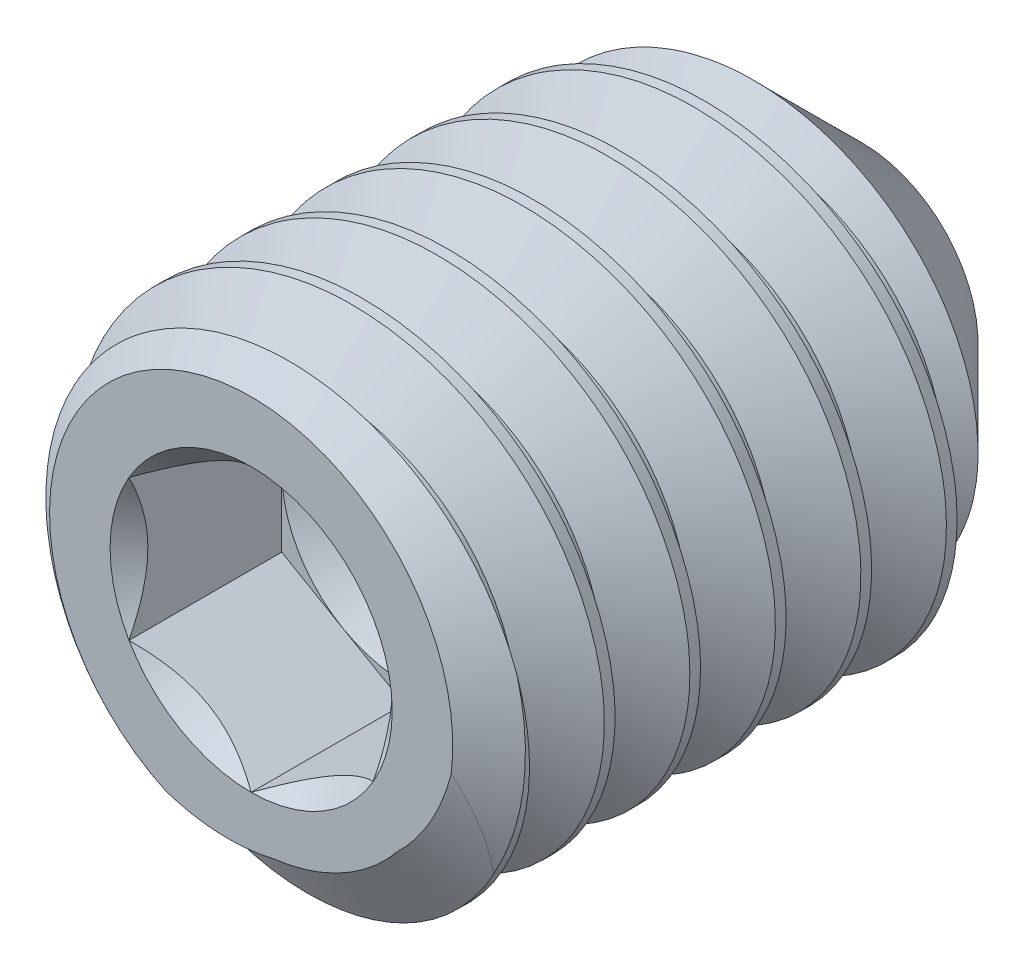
ISO-10303-21;
HEADER;
FILE_DESCRIPTION(('STEP AP214'),'2;1');
FILE_NAME('part.step','',(''),(''),'','','');
FILE_SCHEMA(('AUTOMOTIVE_DESIGN { 1 0 10303 214 1 1 1 1 }'));
ENDSEC;
DATA;
#1=APPLICATION_CONTEXT('core data for automotive mechanical design processes');
#2=APPLICATION_PROTOCOL_DEFINITION('international standard','automotive_design',2000,#1);
#3=PRODUCT_CONTEXT('',#1,'mechanical');
#4=PRODUCT('Part','Part','',(#3));
#5=PRODUCT_RELATED_PRODUCT_CATEGORY('part','',(#4));
#6=PRODUCT_DEFINITION_FORMATION('','',#4);
#7=PRODUCT_DEFINITION_CONTEXT('part definition',#1,'design');
#8=PRODUCT_DEFINITION('design','',#6,#7);
#9=PRODUCT_DEFINITION_SHAPE('','',#8);
#10=(LENGTH_UNIT() NAMED_UNIT(*) SI_UNIT(.MILLI.,.METRE.));
#11=(NAMED_UNIT(*) PLANE_ANGLE_UNIT() SI_UNIT($,.RADIAN.));
#12=(NAMED_UNIT(*) SI_UNIT($,.STERADIAN.) SOLID_ANGLE_UNIT());
#13=UNCERTAINTY_MEASURE_WITH_UNIT(LENGTH_MEASURE(1.E-05),#10,'distance_accuracy_value','');
#14=(GEOMETRIC_REPRESENTATION_CONTEXT(3) GLOBAL_UNCERTAINTY_ASSIGNED_CONTEXT((#13)) GLOBAL_UNIT_ASSIGNED_CONTEXT((#10,
#11,#12)) REPRESENTATION_CONTEXT('',''));
#15=CARTESIAN_POINT('',(0.,0.,0.));
#16=DIRECTION('',(0.,0.,1.));
#17=DIRECTION('',(1.,0.,0.));
#18=AXIS2_PLACEMENT_3D('',#15,#16,#17);
#19=CARTESIAN_POINT('',(0.,0.,2.5));
#20=DIRECTION('',(0.,0.,-1.));
#21=DIRECTION('',(0.,1.,0.));
#22=AXIS2_PLACEMENT_3D('',#19,#20,#21);
#23=PLANE('',#22);
#24=CARTESIAN_POINT('',(0.,0.,2.5));
#25=DIRECTION('',(0.,0.,1.));
#26=DIRECTION('',(1.,0.,0.));
#27=AXIS2_PLACEMENT_3D('',#24,#25,#26);
#28=CIRCLE('',#27,1.15470053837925);
#29=CARTESIAN_POINT('',(0.,1.15470053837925,2.5));
#30=VERTEX_POINT('',#29);
#31=CARTESIAN_POINT('',(-1.,0.577350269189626,2.5));
#32=VERTEX_POINT('',#31);
#33=EDGE_CURVE('E315',#30,#32,#28,.T.);
#34=ORIENTED_EDGE('',*,*,#33,.F.);
#35=CARTESIAN_POINT('',(1.,0.577350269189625,2.5));
#36=VERTEX_POINT('',#35);
#37=EDGE_CURVE('E310',#36,#30,#28,.T.);
#38=ORIENTED_EDGE('',*,*,#37,.F.);
#39=CARTESIAN_POINT('',(1.,-0.577350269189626,2.5));
#40=VERTEX_POINT('',#39);
#41=EDGE_CURVE('E308',#40,#36,#28,.T.);
#42=ORIENTED_EDGE('',*,*,#41,.F.);
#43=CARTESIAN_POINT('',(0.,-1.15470053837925,2.5));
#44=VERTEX_POINT('',#43);
#45=EDGE_CURVE('E546',#44,#40,#28,.T.);
#46=ORIENTED_EDGE('',*,*,#45,.F.);
#47=CARTESIAN_POINT('',(-1.,-0.577350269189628,2.5));
#48=VERTEX_POINT('',#47);
#49=EDGE_CURVE('E542',#48,#44,#28,.T.);
#50=ORIENTED_EDGE('',*,*,#49,.F.);
#51=EDGE_CURVE('E535',#32,#48,#28,.T.);
#52=ORIENTED_EDGE('',*,*,#51,.F.);
#53=EDGE_LOOP('',(#34,#38,#42,#46,#50,#52));
#54=FACE_BOUND('',#53,.T.);
#55=CARTESIAN_POINT('',(1.66979999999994,-0.0408420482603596,2.5));
#56=CARTESIAN_POINT('',(1.66296486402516,-0.0877505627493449,2.5));
#57=CARTESIAN_POINT('',(1.65411355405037,-0.134364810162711,2.5));
#58=CARTESIAN_POINT('',(1.632470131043,-0.226654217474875,2.5));
#59=CARTESIAN_POINT('',(1.61967923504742,-0.272329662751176,2.5));
#60=CARTESIAN_POINT('',(1.59063912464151,-0.361210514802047,2.5));
#61=CARTESIAN_POINT('',(1.57449201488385,-0.404449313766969,2.5));
#62=CARTESIAN_POINT('',(1.53866117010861,-0.489439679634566,2.5));
#63=CARTESIAN_POINT('',(1.51897716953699,-0.531191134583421,2.5));
#64=CARTESIAN_POINT('',(1.4784159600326,-0.60870877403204,2.5));
#65=CARTESIAN_POINT('',(1.45787048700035,-0.644648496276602,2.5));
#66=CARTESIAN_POINT('',(1.42509430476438,-0.697322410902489,2.5));
#67=CARTESIAN_POINT('',(1.41384352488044,-0.714673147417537,2.5));
#68=CARTESIAN_POINT('',(1.39071209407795,-0.74895079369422,2.5));
#69=CARTESIAN_POINT('',(1.37883144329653,-0.765877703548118,2.5));
#70=CARTESIAN_POINT('',(1.35411666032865,-0.799670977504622,2.5));
#71=CARTESIAN_POINT('',(1.34126618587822,-0.816525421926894,2.5));
#72=CARTESIAN_POINT('',(1.31483579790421,-0.849652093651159,2.5));
#73=CARTESIAN_POINT('',(1.30125590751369,-0.865924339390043,2.5));
#74=CARTESIAN_POINT('',(1.27339720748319,-0.897882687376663,2.5));
#75=CARTESIAN_POINT('',(1.25911782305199,-0.913568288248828,2.5));
#76=CARTESIAN_POINT('',(1.22989125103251,-0.944309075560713,2.5));
#77=CARTESIAN_POINT('',(1.21494395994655,-0.959364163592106,2.5));
#78=CARTESIAN_POINT('',(1.19967525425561,-0.974086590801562,2.5));
#79=B_SPLINE_CURVE_WITH_KNOTS('',3,(#55,#56,#57,#58,#59,#60,#61,#62,#63,#64,#65,#66,#67,#68,#69,
#70,#71,#72,#73,#74,#75,#76,#77,#78),.UNSPECIFIED.,.F.,.F.,(4,2,2,2,2,2,2,2,2,2,2,4),(0.,
0.142168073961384,0.2842922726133,0.42259949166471,0.560917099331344,0.684987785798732,
0.747013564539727,0.809039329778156,0.872603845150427,0.936166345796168,0.999781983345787,
1.06340751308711),.UNSPECIFIED.);
#80=CARTESIAN_POINT('',(1.63707775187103,-0.206098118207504,2.49999999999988));
#81=VERTEX_POINT('',#80);
#82=CARTESIAN_POINT('',(1.19967525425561,-0.974086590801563,2.5));
#83=VERTEX_POINT('',#82);
#84=EDGE_CURVE('E295',#81,#83,#79,.T.);
#85=ORIENTED_EDGE('',*,*,#84,.F.);
#86=CARTESIAN_POINT('',(0.,0.,2.5));
#87=DIRECTION('',(0.,0.,1.));
#88=DIRECTION('',(0.,-1.,0.));
#89=AXIS2_PLACEMENT_3D('',#86,#87,#88);
#90=CIRCLE('',#89,1.65);
#91=CARTESIAN_POINT('',(-0.694259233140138,-1.49683135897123,2.5));
#92=VERTEX_POINT('',#91);
#93=EDGE_CURVE('E359',#81,#92,#90,.T.);
#94=ORIENTED_EDGE('',*,*,#93,.T.);
#95=CARTESIAN_POINT('',(0.184784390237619,-1.53424904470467,2.5));
#96=CARTESIAN_POINT('',(0.163763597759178,-1.53938046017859,2.5));
#97=CARTESIAN_POINT('',(0.142630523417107,-1.54404815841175,2.5));
#98=CARTESIAN_POINT('',(0.100185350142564,-1.55244041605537,2.5));
#99=CARTESIAN_POINT('',(0.0788733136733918,-1.5561652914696,2.5));
#100=CARTESIAN_POINT('',(0.0147397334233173,-1.56590320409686,2.5));
#101=CARTESIAN_POINT('',(-0.0283029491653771,-1.57048531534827,2.5));
#102=CARTESIAN_POINT('',(-0.114585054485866,-1.57633103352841,2.5));
#103=CARTESIAN_POINT('',(-0.157824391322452,-1.57759597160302,2.5));
#104=CARTESIAN_POINT('',(-0.244270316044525,-1.57673339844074,2.5));
#105=CARTESIAN_POINT('',(-0.287476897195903,-1.57460531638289,2.5));
#106=CARTESIAN_POINT('',(-0.418941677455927,-1.56295041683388,2.5));
#107=CARTESIAN_POINT('',(-0.506784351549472,-1.54799573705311,2.5));
#108=CARTESIAN_POINT('',(-0.67886285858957,-1.50422728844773,2.5));
#109=CARTESIAN_POINT('',(-0.763099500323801,-1.47541664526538,2.5));
#110=CARTESIAN_POINT('',(-0.929885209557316,-1.40292346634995,2.5));
#111=CARTESIAN_POINT('',(-1.01215406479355,-1.35858714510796,2.5));
#112=CARTESIAN_POINT('',(-1.12906389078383,-1.28226427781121,2.5));
#113=CARTESIAN_POINT('',(-1.16698166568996,-1.2551591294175,2.5));
#114=CARTESIAN_POINT('',(-1.24041344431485,-1.19785438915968,2.5));
#115=CARTESIAN_POINT('',(-1.27592766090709,-1.16765507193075,2.5));
#116=CARTESIAN_POINT('',(-1.34673783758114,-1.1021164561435,2.5));
#117=CARTESIAN_POINT('',(-1.38183624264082,-1.06656397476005,2.5));
#118=CARTESIAN_POINT('',(-1.44871831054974,-0.992434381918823,2.5));
#119=CARTESIAN_POINT('',(-1.48050088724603,-0.953856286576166,2.5));
#120=CARTESIAN_POINT('',(-1.52546009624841,-0.893965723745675,2.5));
#121=CARTESIAN_POINT('',(-1.53999735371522,-0.873659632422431,2.5));
#122=CARTESIAN_POINT('',(-1.56825536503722,-0.832484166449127,2.5));
#123=CARTESIAN_POINT('',(-1.58197606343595,-0.811614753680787,2.5));
#124=CARTESIAN_POINT('',(-1.60855703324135,-0.769352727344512,2.5));
#125=CARTESIAN_POINT('',(-1.62141782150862,-0.747960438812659,2.5));
#126=CARTESIAN_POINT('',(-1.64626694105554,-0.704681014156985,2.5));
#127=CARTESIAN_POINT('',(-1.65825545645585,-0.682793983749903,2.5));
#128=CARTESIAN_POINT('',(-1.6698,-0.660675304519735,2.5));
#129=B_SPLINE_CURVE_WITH_KNOTS('',3,(#95,#96,#97,#98,#99,#100,#101,#102,#103,#104,#105,#106,
#107,#108,#109,#110,#111,#112,#113,#114,#115,#116,#117,#118,#119,#120,#121,#122,#123,#124,#125,
#126,#127,#128),.UNSPECIFIED.,.F.,.F.,(4,2,2,2,2,2,2,2,2,2,2,2,2,2,2,2,4),(0.,
0.0649069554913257,0.129792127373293,0.259489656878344,0.389135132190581,0.518802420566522,
0.784859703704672,1.05085699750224,1.32976107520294,1.46945576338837,1.60913806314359,
1.75881798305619,1.90854678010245,1.98344866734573,2.05835563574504,2.13321716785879,
2.208062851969),.UNSPECIFIED.);
#130=CARTESIAN_POINT('',(0.184784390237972,-1.53424904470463,2.50000000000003));
#131=VERTEX_POINT('',#130);
#132=EDGE_CURVE('E266',#131,#92,#129,.T.);
#133=ORIENTED_EDGE('',*,*,#132,.F.);
#134=CARTESIAN_POINT('',(1.19967525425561,-0.974086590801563,2.5));
#135=CARTESIAN_POINT('',(1.18125681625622,-0.99676788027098,2.5));
#136=CARTESIAN_POINT('',(1.16220503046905,-1.01891867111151,2.5));
#137=CARTESIAN_POINT('',(1.12285031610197,-1.06213483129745,2.5));
#138=CARTESIAN_POINT('',(1.10254571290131,-1.08319867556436,2.5));
#139=CARTESIAN_POINT('',(1.01969322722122,-1.16438857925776,2.5));
#140=CARTESIAN_POINT('',(0.952529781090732,-1.21994915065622,2.5));
#141=CARTESIAN_POINT('',(0.809751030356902,-1.31907192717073,2.5));
#142=CARTESIAN_POINT('',(0.73411994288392,-1.36261118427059,2.5));
#143=CARTESIAN_POINT('',(0.581104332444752,-1.43425722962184,2.5));
#144=CARTESIAN_POINT('',(0.504069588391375,-1.4631063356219,2.5));
#145=CARTESIAN_POINT('',(0.385936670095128,-1.49693052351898,2.5));
#146=CARTESIAN_POINT('',(0.346136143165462,-1.50662946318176,2.5));
#147=CARTESIAN_POINT('',(0.265889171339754,-1.52284023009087,2.5));
#148=CARTESIAN_POINT('',(0.225442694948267,-1.52935190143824,2.5));
#149=CARTESIAN_POINT('',(0.184784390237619,-1.53424904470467,2.5));
#150=B_SPLINE_CURVE_WITH_KNOTS('',3,(#134,#135,#136,#137,#138,#139,#140,#141,#142,#143,#144,
#145,#146,#147,#148,#149),.UNSPECIFIED.,.F.,.F.,(4,2,2,2,2,2,2,4),(0.,0.0876164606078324,
0.175352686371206,0.435471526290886,0.696083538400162,0.941737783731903,1.0645216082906,
1.18731143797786),.UNSPECIFIED.);
#151=EDGE_CURVE('E185',#83,#131,#150,.T.);
#152=ORIENTED_EDGE('',*,*,#151,.F.);
#153=EDGE_LOOP('',(#85,#94,#133,#152));
#154=FACE_BOUND('',#153,.T.);
#155=ADVANCED_FACE('F55',(#54,#154),#23,.F.);
#156=CARTESIAN_POINT('',(0.,0.,2.2549273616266));
#157=DIRECTION('',(0.,0.,-1.));
#158=DIRECTION('',(0.,1.,0.));
#159=AXIS2_PLACEMENT_3D('',#156,#157,#158);
#160=CONICAL_SURFACE('',#159,2.,0.95993108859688);
#161=CARTESIAN_POINT('',(1.73951456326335,-0.986959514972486,2.2549273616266));
#162=CARTESIAN_POINT('',(1.74526931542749,-0.940935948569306,2.26732516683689));
#163=CARTESIAN_POINT('',(1.74902200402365,-0.894774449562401,2.28002456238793));
#164=CARTESIAN_POINT('',(1.75248968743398,-0.80244757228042,2.30603889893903));
#165=CARTESIAN_POINT('',(1.75220256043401,-0.756282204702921,2.31935415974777));
#166=CARTESIAN_POINT('',(1.74532797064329,-0.620296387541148,2.35961981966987));
#167=CARTESIAN_POINT('',(1.73298109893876,-0.530923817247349,2.38743877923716));
#168=CARTESIAN_POINT('',(1.70368537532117,-0.403241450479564,2.42972417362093));
#169=CARTESIAN_POINT('',(1.69272719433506,-0.363180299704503,2.44337667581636));
#170=CARTESIAN_POINT('',(1.66743565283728,-0.283861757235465,2.47127231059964));
#171=CARTESIAN_POINT('',(1.65306983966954,-0.244616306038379,2.48551996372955));
#172=CARTESIAN_POINT('',(1.63707775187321,-0.206098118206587,2.49999999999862));
#173=B_SPLINE_CURVE_WITH_KNOTS('',3,(#161,#162,#163,#164,#165,#166,#167,#168,#169,#170,#171,
#172),.UNSPECIFIED.,.F.,.F.,(4,2,2,2,2,4),(0.,0.143927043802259,0.287929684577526,
0.569566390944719,0.700612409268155,0.83296044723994),.UNSPECIFIED.);
#174=CARTESIAN_POINT('',(1.73951456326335,-0.986959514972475,2.2549273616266));
#175=VERTEX_POINT('',#174);
#176=EDGE_CURVE('E270',#175,#81,#173,.T.);
#177=ORIENTED_EDGE('',*,*,#176,.F.);
#178=CARTESIAN_POINT('',(0.,0.,2.2549273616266));
#179=DIRECTION('',(0.,0.,1.));
#180=DIRECTION('',(0.,-1.,0.));
#181=AXIS2_PLACEMENT_3D('',#178,#179,#180);
#182=CIRCLE('',#181,2.);
#183=CARTESIAN_POINT('',(1.9330777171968,0.513040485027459,2.2549273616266));
#184=VERTEX_POINT('',#183);
#185=EDGE_CURVE('E363',#175,#184,#182,.T.);
#186=ORIENTED_EDGE('',*,*,#185,.T.);
#187=CARTESIAN_POINT('',(-0.694259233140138,-1.49683135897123,2.5));
#188=CARTESIAN_POINT('',(-0.737582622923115,-1.47957219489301,2.49820262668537));
#189=CARTESIAN_POINT('',(-0.780172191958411,-1.46047376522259,2.49640278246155));
#190=CARTESIAN_POINT('',(-0.863585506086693,-1.41875669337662,2.4928108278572));
#191=CARTESIAN_POINT('',(-0.90440944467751,-1.3961384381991,2.49101871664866));
#192=CARTESIAN_POINT('',(-0.983919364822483,-1.34758722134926,2.4874582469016));
#193=CARTESIAN_POINT('',(-1.02260965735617,-1.32166132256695,2.48568984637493));
#194=CARTESIAN_POINT('',(-1.09767219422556,-1.26664256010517,2.48218472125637));
#195=CARTESIAN_POINT('',(-1.13404436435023,-1.23754959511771,2.48044799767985));
#196=CARTESIAN_POINT('',(-1.20424531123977,-1.17637386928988,2.47701600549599));
#197=CARTESIAN_POINT('',(-1.23807159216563,-1.14428824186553,2.47532077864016));
#198=CARTESIAN_POINT('',(-1.30289922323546,-1.07738263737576,2.4719842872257));
#199=CARTESIAN_POINT('',(-1.3339007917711,-1.04256287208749,2.47034301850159));
#200=CARTESIAN_POINT('',(-1.39286705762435,-0.970426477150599,2.46712488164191));
#201=CARTESIAN_POINT('',(-1.42083125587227,-0.933109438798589,2.46554802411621));
#202=CARTESIAN_POINT('',(-1.47352130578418,-0.856252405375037,2.462466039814));
#203=CARTESIAN_POINT('',(-1.49824679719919,-0.816712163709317,2.46096092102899));
#204=CARTESIAN_POINT('',(-1.54463583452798,-0.735539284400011,2.45785977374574));
#205=CARTESIAN_POINT('',(-1.56627863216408,-0.693894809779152,2.45626322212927));
#206=CARTESIAN_POINT('',(-1.60614240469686,-0.60899605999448,2.45302829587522));
#207=CARTESIAN_POINT('',(-1.62436236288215,-0.565741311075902,2.45138990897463));
#208=CARTESIAN_POINT('',(-1.67370549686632,-0.43398608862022,2.44641890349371));
#209=CARTESIAN_POINT('',(-1.69954246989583,-0.343441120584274,2.44302838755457));
#210=CARTESIAN_POINT('',(-1.73722063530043,-0.154995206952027,2.43603434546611));
#211=CARTESIAN_POINT('',(-1.74833212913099,-0.0569496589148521,2.43242839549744));
#212=CARTESIAN_POINT('',(-1.75393198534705,0.139592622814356,2.42526209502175));
#213=CARTESIAN_POINT('',(-1.74842346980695,0.238089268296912,2.42170173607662));
#214=CARTESIAN_POINT('',(-1.72091165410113,0.432796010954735,2.41472539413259));
#215=CARTESIAN_POINT('',(-1.69891019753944,0.529006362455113,2.41130939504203));
#216=CARTESIAN_POINT('',(-1.65408650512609,0.669449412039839,2.40635148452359));
#217=CARTESIAN_POINT('',(-1.63716356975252,0.715640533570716,2.40472575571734));
#218=CARTESIAN_POINT('',(-1.599460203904,0.806438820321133,2.40155852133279));
#219=CARTESIAN_POINT('',(-1.57867966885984,0.851045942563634,2.40001701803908));
#220=CARTESIAN_POINT('',(-1.53356034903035,0.938313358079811,2.39694769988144));
#221=CARTESIAN_POINT('',(-1.50922794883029,0.980976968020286,2.39541986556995));
#222=CARTESIAN_POINT('',(-1.45725666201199,1.06423727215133,2.39228867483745));
#223=CARTESIAN_POINT('',(-1.42961771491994,1.10483392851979,2.39068531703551));
#224=CARTESIAN_POINT('',(-1.37116602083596,1.18369353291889,2.38744002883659));
#225=CARTESIAN_POINT('',(-1.34035248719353,1.22195589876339,2.38579808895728));
#226=CARTESIAN_POINT('',(-1.27577764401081,1.29588607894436,2.38248103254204));
#227=CARTESIAN_POINT('',(-1.24201635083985,1.33155390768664,2.38080591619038));
#228=CARTESIAN_POINT('',(-1.13284472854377,1.43798723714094,2.3755695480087));
#229=CARTESIAN_POINT('',(-1.05264941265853,1.50396602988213,2.37197023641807));
#230=CARTESIAN_POINT('',(-0.882362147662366,1.62147250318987,2.36478413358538));
#231=CARTESIAN_POINT('',(-0.792270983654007,1.6730013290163,2.36119734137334));
#232=CARTESIAN_POINT('',(-0.604699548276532,1.76020904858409,2.35413826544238));
#233=CARTESIAN_POINT('',(-0.507218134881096,1.79588548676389,2.35066599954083));
#234=CARTESIAN_POINT('',(-0.307591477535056,1.85038102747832,2.34390499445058));
#235=CARTESIAN_POINT('',(-0.205446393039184,1.86920070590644,2.34061624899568));
#236=CARTESIAN_POINT('',(-0.0511241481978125,1.88430600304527,2.33594858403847));
#237=CARTESIAN_POINT('',(0.000488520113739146,1.88715459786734,2.3344372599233));
#238=CARTESIAN_POINT('',(0.103787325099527,1.88869776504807,2.33135931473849));
#239=CARTESIAN_POINT('',(0.155473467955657,1.887391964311,2.32979268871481));
#240=CARTESIAN_POINT('',(0.258590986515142,1.88064011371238,2.32660544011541));
#241=CARTESIAN_POINT('',(0.310022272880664,1.87519270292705,2.32498479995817));
#242=CARTESIAN_POINT('',(0.412266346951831,1.86019568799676,2.32170463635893));
#243=CARTESIAN_POINT('',(0.463079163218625,1.85064627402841,2.32004511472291));
#244=CARTESIAN_POINT('',(0.618336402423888,1.81494439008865,2.31488338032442));
#245=CARTESIAN_POINT('',(0.721308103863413,1.78200817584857,2.3113306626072));
#246=CARTESIAN_POINT('',(0.920249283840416,1.69946026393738,2.30420699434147));
#247=CARTESIAN_POINT('',(1.01622000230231,1.64985152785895,2.300636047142));
#248=CARTESIAN_POINT('',(1.19932228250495,1.53487332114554,2.29354143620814));
#249=CARTESIAN_POINT('',(1.28637440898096,1.46937722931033,2.29001840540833));
#250=CARTESIAN_POINT('',(1.44830107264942,1.32461861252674,2.28314487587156));
#251=CARTESIAN_POINT('',(1.52317086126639,1.24535074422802,2.27979444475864));
#252=CARTESIAN_POINT('',(1.62465237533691,1.11796501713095,2.27495893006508));
#253=CARTESIAN_POINT('',(1.65668544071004,1.074071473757,2.27337823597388));
#254=CARTESIAN_POINT('',(1.70187031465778,1.00631724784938,2.27107235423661));
#255=CARTESIAN_POINT('',(1.71645610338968,0.983410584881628,2.27031449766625));
#256=CARTESIAN_POINT('',(1.74469791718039,0.937023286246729,2.26878182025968));
#257=CARTESIAN_POINT('',(1.75835363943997,0.913542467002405,2.26800699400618));
#258=CARTESIAN_POINT('',(1.79782890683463,0.842403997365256,2.26566381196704));
#259=CARTESIAN_POINT('',(1.82222517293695,0.793947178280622,2.26407332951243));
#260=CARTESIAN_POINT('',(1.86704108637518,0.695238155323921,2.26084498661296));
#261=CARTESIAN_POINT('',(1.8874611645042,0.64498614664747,2.25920713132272));
#262=CARTESIAN_POINT('',(1.91548180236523,0.56720954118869,2.25668141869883));
#263=CARTESIAN_POINT('',(1.92456802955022,0.540213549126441,2.25580640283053));
#264=CARTESIAN_POINT('',(1.9330777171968,0.513040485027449,2.2549273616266));
#265=B_SPLINE_CURVE_WITH_KNOTS('',3,(#187,#188,#189,#190,#191,#192,#193,#194,#195,#196,#197,
#198,#199,#200,#201,#202,#203,#204,#205,#206,#207,#208,#209,#210,#211,#212,#213,#214,#215,#216,
#217,#218,#219,#220,#221,#222,#223,#224,#225,#226,#227,#228,#229,#230,#231,#232,#233,#234,#235,
#236,#237,#238,#239,#240,#241,#242,#243,#244,#245,#246,#247,#248,#249,#250,#251,#252,#253,#254,
#255,#256,#257,#258,#259,#260,#261,#262,#263,#264),.UNSPECIFIED.,.F.,.F.,(4,2,2,2,2,2,2,2,2,2,2,
2,2,2,2,2,2,2,2,2,2,2,2,2,2,2,2,2,2,2,2,2,2,2,2,2,2,2,4),(0.,0.139965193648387,
0.279915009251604,0.419570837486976,0.559231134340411,0.699026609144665,0.838811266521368,
0.978618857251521,1.11844198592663,1.2591657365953,1.39993122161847,1.6812793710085,
1.97610443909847,2.27087412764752,2.56561087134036,2.71312722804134,2.86064758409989,
3.00790596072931,3.15516703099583,3.30246468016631,3.44976151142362,3.75988304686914,
4.06997999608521,4.38012496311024,4.69025933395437,4.84525413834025,5.00026286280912,
5.15532254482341,5.31037503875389,5.63323378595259,5.95603521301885,6.28149913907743,
6.60708962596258,6.77000434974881,6.85148176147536,6.93298557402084,7.09562245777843,
7.25824171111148,7.34370784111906),.UNSPECIFIED.);
#266=EDGE_CURVE('E271',#92,#184,#265,.T.);
#267=ORIENTED_EDGE('',*,*,#266,.F.);
#268=ORIENTED_EDGE('',*,*,#93,.F.);
#269=EDGE_LOOP('',(#177,#186,#267,#268));
#270=FACE_BOUND('',#269,.T.);
#271=ADVANCED_FACE('F282',(#270),#160,.T.);
#272=CARTESIAN_POINT('',(0.,0.,-2.5));
#273=DIRECTION('',(0.,0.,1.));
#274=DIRECTION('',(0.,-1.,0.));
#275=AXIS2_PLACEMENT_3D('',#272,#273,#274);
#276=CONICAL_SURFACE('',#275,0.95,0.785398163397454);
#277=CARTESIAN_POINT('',(0.,0.,-2.5));
#278=DIRECTION('',(0.,0.,1.));
#279=DIRECTION('',(0.,-1.,0.));
#280=AXIS2_PLACEMENT_3D('',#277,#278,#279);
#281=CIRCLE('',#280,0.95);
#282=CARTESIAN_POINT('',(0.,-0.95,-2.5));
#283=VERTEX_POINT('',#282);
#284=EDGE_CURVE('E370',#283,#283,#281,.T.);
#285=ORIENTED_EDGE('',*,*,#284,.T.);
#286=EDGE_LOOP('',(#285));
#287=FACE_BOUND('',#286,.T.);
#288=CARTESIAN_POINT('',(-1.24058957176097,-0.921413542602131,-1.90466333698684));
#289=CARTESIAN_POINT('',(-1.21576281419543,-0.958100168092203,-1.90271932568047));
#290=CARTESIAN_POINT('',(-1.18939905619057,-0.993719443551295,-1.90074396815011));
#291=CARTESIAN_POINT('',(-1.13376741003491,-1.06260688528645,-1.89674408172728));
#292=CARTESIAN_POINT('',(-1.10449966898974,-1.09587517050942,-1.89471955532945));
#293=CARTESIAN_POINT('',(-1.01265748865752,-1.19176521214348,-1.88859661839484));
#294=CARTESIAN_POINT('',(-0.945989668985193,-1.25055241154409,-1.88444458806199));
#295=CARTESIAN_POINT('',(-0.803726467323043,-1.35607510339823,-1.87612655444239));
#296=CARTESIAN_POINT('',(-0.728127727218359,-1.40280604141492,-1.87196054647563));
#297=CARTESIAN_POINT('',(-0.570191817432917,-1.48288183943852,-1.86373412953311));
#298=CARTESIAN_POINT('',(-0.487858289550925,-1.51623387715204,-1.85967366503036));
#299=CARTESIAN_POINT('',(-0.318712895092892,-1.56863547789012,-1.85175674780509));
#300=CARTESIAN_POINT('',(-0.231901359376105,-1.58768609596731,-1.84790028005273));
#301=CARTESIAN_POINT('',(-0.100269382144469,-1.60511957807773,-1.84236291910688));
#302=CARTESIAN_POINT('',(-0.0561277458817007,-1.60907262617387,-1.84055728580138));
#303=CARTESIAN_POINT('',(0.0102191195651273,-1.6122227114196,-1.83789645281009));
#304=CARTESIAN_POINT('',(0.0323592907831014,-1.61280941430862,-1.83701736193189));
#305=CARTESIAN_POINT('',(0.0766457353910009,-1.61309914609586,-1.83523293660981));
#306=CARTESIAN_POINT('',(0.0987920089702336,-1.6128019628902,-1.83432759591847));
#307=CARTESIAN_POINT('',(0.210150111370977,-1.609051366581,-1.82973293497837));
#308=CARTESIAN_POINT('',(0.299246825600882,-1.59876296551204,-1.82592004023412));
#309=CARTESIAN_POINT('',(0.474523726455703,-1.56390313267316,-1.81813497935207));
#310=CARTESIAN_POINT('',(0.560703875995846,-1.53933151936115,-1.81416281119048));
#311=CARTESIAN_POINT('',(0.731115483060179,-1.47536910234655,-1.80601919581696));
#312=CARTESIAN_POINT('',(0.815151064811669,-1.43545465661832,-1.80184588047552));
#313=CARTESIAN_POINT('',(0.975339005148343,-1.34203770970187,-1.79356359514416));
#314=CARTESIAN_POINT('',(1.05149210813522,-1.28853649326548,-1.78945461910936));
#315=CARTESIAN_POINT('',(1.1581101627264,-1.19933357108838,-1.78342679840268));
#316=CARTESIAN_POINT('',(1.19239425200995,-1.16809177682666,-1.78143929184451));
#317=CARTESIAN_POINT('',(1.25821520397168,-1.10282137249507,-1.77752295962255));
#318=CARTESIAN_POINT('',(1.28975222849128,-1.06879292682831,-1.77559413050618));
#319=CARTESIAN_POINT('',(1.34985600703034,-0.998197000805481,-1.77179807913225));
#320=CARTESIAN_POINT('',(1.37842231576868,-0.961629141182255,-1.76993086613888));
#321=CARTESIAN_POINT('',(1.43234981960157,-0.88619591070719,-1.76630674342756));
#322=CARTESIAN_POINT('',(1.45771080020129,-0.847330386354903,-1.76454984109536));
#323=CARTESIAN_POINT('',(1.50523399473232,-0.767617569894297,-1.76097260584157));
#324=CARTESIAN_POINT('',(1.5273915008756,-0.726767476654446,-1.7591521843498));
#325=CARTESIAN_POINT('',(1.56833276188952,-0.643425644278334,-1.75544711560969));
#326=CARTESIAN_POINT('',(1.58711659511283,-0.60093394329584,-1.75356246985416));
#327=CARTESIAN_POINT('',(1.63821240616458,-0.471384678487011,-1.74783759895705));
#328=CARTESIAN_POINT('',(1.66529929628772,-0.382201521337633,-1.74392413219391));
#329=CARTESIAN_POINT('',(1.70557578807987,-0.196764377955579,-1.73584432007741));
#330=CARTESIAN_POINT('',(1.71811841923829,-0.100371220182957,-1.73167433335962));
#331=CARTESIAN_POINT('',(1.72683575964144,0.0931411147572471,-1.72336390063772));
#332=CARTESIAN_POINT('',(1.7230117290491,0.190260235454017,-1.71922345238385));
#333=CARTESIAN_POINT('',(1.6990751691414,0.38252967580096,-1.71108390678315));
#334=CARTESIAN_POINT('',(1.678962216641,0.477679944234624,-1.70708481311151));
#335=CARTESIAN_POINT('',(1.63706639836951,0.616771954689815,-1.70127452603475));
#336=CARTESIAN_POINT('',(1.62113670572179,0.662550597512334,-1.69936832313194));
#337=CARTESIAN_POINT('',(1.58546876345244,0.752616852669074,-1.69563274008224));
#338=CARTESIAN_POINT('',(1.56573056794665,0.796904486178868,-1.69380335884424));
#339=CARTESIAN_POINT('',(1.52263699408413,0.883592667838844,-1.69022097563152));
#340=CARTESIAN_POINT('',(1.49928729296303,0.925996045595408,-1.68846785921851));
#341=CARTESIAN_POINT('',(1.44926875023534,1.00879345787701,-1.68486329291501));
#342=CARTESIAN_POINT('',(1.42259974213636,1.04918739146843,-1.68301183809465));
#343=CARTESIAN_POINT('',(1.36607249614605,1.12769734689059,-1.67926007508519));
#344=CARTESIAN_POINT('',(1.33621344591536,1.16581278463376,-1.67735975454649));
#345=CARTESIAN_POINT('',(1.27353013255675,1.23949976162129,-1.67351500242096));
#346=CARTESIAN_POINT('',(1.24070594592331,1.27507136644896,-1.67157057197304));
#347=CARTESIAN_POINT('',(1.13530218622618,1.38039566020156,-1.66553502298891));
#348=CARTESIAN_POINT('',(1.05805831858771,1.44559320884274,-1.66139250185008));
#349=CARTESIAN_POINT('',(0.893786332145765,1.56208830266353,-1.65310256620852));
#350=CARTESIAN_POINT('',(0.806758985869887,1.61338694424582,-1.64895515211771));
#351=CARTESIAN_POINT('',(0.625034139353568,1.70085141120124,-1.64075299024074));
#352=CARTESIAN_POINT('',(0.530311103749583,1.73696417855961,-1.63669861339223));
#353=CARTESIAN_POINT('',(0.336061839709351,1.79275803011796,-1.6288081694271));
#354=CARTESIAN_POINT('',(0.236535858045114,1.81243995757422,-1.62497209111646));
#355=CARTESIAN_POINT('',(0.111129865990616,1.8264249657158,-1.62037216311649));
#356=CARTESIAN_POINT('',(0.0859980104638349,1.82869113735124,-1.61946191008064));
#357=CARTESIAN_POINT('',(0.0356610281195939,1.83215540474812,-1.6176705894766));
#358=CARTESIAN_POINT('',(0.0104559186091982,1.83335373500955,-1.61678951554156));
#359=CARTESIAN_POINT('',(-0.0651998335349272,1.83540961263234,-1.61412564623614));
#360=CARTESIAN_POINT('',(-0.115692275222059,1.83472819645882,-1.61232215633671));
#361=CARTESIAN_POINT('',(-0.266842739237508,1.82655407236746,-1.60680864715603));
#362=CARTESIAN_POINT('',(-0.367231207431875,1.81293764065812,-1.60299367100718));
#363=CARTESIAN_POINT('',(-0.56761552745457,1.76899274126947,-1.59509429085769));
#364=CARTESIAN_POINT('',(-0.667495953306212,1.73814328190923,-1.59100517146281));
#365=CARTESIAN_POINT('',(-0.86071990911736,1.66026857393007,-1.58278403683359));
#366=CARTESIAN_POINT('',(-0.95406394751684,1.61324458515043,-1.57865202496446));
#367=CARTESIAN_POINT('',(-1.13252984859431,1.5037407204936,-1.57041871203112));
#368=CARTESIAN_POINT('',(-1.21756278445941,1.44111478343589,-1.56631810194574));
#369=CARTESIAN_POINT('',(-1.33624518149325,1.33721842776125,-1.56030961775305));
#370=CARTESIAN_POINT('',(-1.37434213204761,1.30090957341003,-1.55832973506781));
#371=CARTESIAN_POINT('',(-1.44735014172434,1.2252029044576,-1.55442964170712));
#372=CARTESIAN_POINT('',(-1.48226140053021,1.18580528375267,-1.55250942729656));
#373=CARTESIAN_POINT('',(-1.54861592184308,1.10423796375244,-1.54873874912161));
#374=CARTESIAN_POINT('',(-1.58006189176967,1.06207047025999,-1.54688823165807));
#375=CARTESIAN_POINT('',(-1.63927920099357,0.975239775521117,-1.54328367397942));
#376=CARTESIAN_POINT('',(-1.66705028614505,0.930576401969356,-1.54152964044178));
#377=CARTESIAN_POINT('',(-1.74480301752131,0.793426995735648,-1.53614186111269));
#378=CARTESIAN_POINT('',(-1.78926232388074,0.697734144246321,-1.53238057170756));
#379=CARTESIAN_POINT('',(-1.86298662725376,0.49806227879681,-1.52459401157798));
#380=CARTESIAN_POINT('',(-1.89185618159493,0.39393842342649,-1.52056454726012));
#381=CARTESIAN_POINT('',(-1.93197035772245,0.182352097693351,-1.51242625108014));
#382=CARTESIAN_POINT('',(-1.94321679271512,0.0748899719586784,-1.50831742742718));
#383=CARTESIAN_POINT('',(-1.94781148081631,-0.142055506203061,-1.5000750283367));
#384=CARTESIAN_POINT('',(-1.94088278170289,-0.251544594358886,-1.49594203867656));
#385=CARTESIAN_POINT('',(-1.9086991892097,-0.467878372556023,-1.4878288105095));
#386=CARTESIAN_POINT('',(-1.88344119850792,-0.574722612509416,-1.48384859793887));
#387=CARTESIAN_POINT('',(-1.83242591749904,-0.730572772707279,-1.47806662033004));
#388=CARTESIAN_POINT('',(-1.81322146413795,-0.781808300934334,-1.47616989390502));
#389=CARTESIAN_POINT('',(-1.77054036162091,-0.882495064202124,-1.47246900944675));
#390=CARTESIAN_POINT('',(-1.74706318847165,-0.931946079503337,-1.47066486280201));
#391=CARTESIAN_POINT('',(-1.69610719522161,-1.02867176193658,-1.46708267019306));
#392=CARTESIAN_POINT('',(-1.66863221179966,-1.0759484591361,-1.46530460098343));
#393=CARTESIAN_POINT('',(-1.60997108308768,-1.16811401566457,-1.46165425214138));
#394=CARTESIAN_POINT('',(-1.57878646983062,-1.21300384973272,-1.45978201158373));
#395=CARTESIAN_POINT('',(-1.52331568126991,-1.28630287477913,-1.45659227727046));
#396=CARTESIAN_POINT('',(-1.49997130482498,-1.31543024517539,-1.45528681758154));
#397=CARTESIAN_POINT('',(-1.45175206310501,-1.37228935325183,-1.45265763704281));
#398=CARTESIAN_POINT('',(-1.42688031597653,-1.40002373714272,-1.45133395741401));
#399=CARTESIAN_POINT('',(-1.40125853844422,-1.4270509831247,-1.45000000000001));
#400=B_SPLINE_CURVE_WITH_KNOTS('',3,(#288,#289,#290,#291,#292,#293,#294,#295,#296,#297,#298,
#299,#300,#301,#302,#303,#304,#305,#306,#307,#308,#309,#310,#311,#312,#313,#314,#315,#316,#317,
#318,#319,#320,#321,#322,#323,#324,#325,#326,#327,#328,#329,#330,#331,#332,#333,#334,#335,#336,
#337,#338,#339,#340,#341,#342,#343,#344,#345,#346,#347,#348,#349,#350,#351,#352,#353,#354,#355,
#356,#357,#358,#359,#360,#361,#362,#363,#364,#365,#366,#367,#368,#369,#370,#371,#372,#373,#374,
#375,#376,#377,#378,#379,#380,#381,#382,#383,#384,#385,#386,#387,#388,#389,#390,#391,#392,#393,
#394,#395,#396,#397,#398,#399),.UNSPECIFIED.,.F.,.F.,(4,2,2,2,2,2,2,2,2,2,2,2,2,2,2,2,2,2,2,2,2,
2,2,2,2,2,2,2,2,2,2,2,2,2,2,2,2,2,2,2,2,2,2,2,2,2,2,2,2,2,2,2,2,2,2,4),(0.,0.13293915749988,
0.265871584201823,0.531448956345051,0.797126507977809,1.06266133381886,1.32817656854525,
1.46110341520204,1.52757969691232,1.5940719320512,1.86203665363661,2.13000478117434,
2.40807286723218,2.68611466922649,2.82525743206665,2.96439199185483,3.10354737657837,
3.24271206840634,3.38207924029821,3.52144317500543,3.79999346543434,4.09050946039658,
4.38100308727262,4.67150426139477,4.81688855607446,4.96227078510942,5.10742675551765,
5.25259000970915,5.39779031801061,5.54298688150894,5.84492759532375,6.14684448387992,
6.44980764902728,6.75275526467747,6.82849509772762,6.90421829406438,7.05566054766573,
7.35837408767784,7.67077732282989,7.98315623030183,8.29857731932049,8.45641910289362,
8.61425098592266,8.77195866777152,8.92967725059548,9.24493356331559,9.56785002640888,
9.89073326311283,10.2185650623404,10.5464522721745,10.7105399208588,10.8746477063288,
11.0385990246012,11.202482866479,11.3144806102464,11.4262568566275),.UNSPECIFIED.);
#401=CARTESIAN_POINT('',(-1.24058957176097,-0.921413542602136,-1.90466333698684));
#402=VERTEX_POINT('',#401);
#403=CARTESIAN_POINT('',(-1.40125853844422,-1.4270509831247,-1.45000000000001));
#404=VERTEX_POINT('',#403);
#405=EDGE_CURVE('E12',#402,#404,#400,.T.);
#406=ORIENTED_EDGE('',*,*,#405,.F.);
#407=CARTESIAN_POINT('',(-1.52852262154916,0.227341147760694,-1.90466333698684));
#408=CARTESIAN_POINT('',(-1.53713683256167,0.16950945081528,-1.90466333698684));
#409=CARTESIAN_POINT('',(-1.54244136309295,0.111198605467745,-1.90466333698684));
#410=CARTESIAN_POINT('',(-1.54589491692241,0.010004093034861,-1.90466333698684));
#411=CARTESIAN_POINT('',(-1.545579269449,-0.0328309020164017,-1.90466333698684));
#412=CARTESIAN_POINT('',(-1.54139348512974,-0.118367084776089,-1.90466333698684));
#413=CARTESIAN_POINT('',(-1.53751939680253,-0.161068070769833,-1.90466333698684));
#414=CARTESIAN_POINT('',(-1.52043259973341,-0.289608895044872,-1.90466333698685));
#415=CARTESIAN_POINT('',(-1.50171727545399,-0.374779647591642,-1.90466333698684));
#416=CARTESIAN_POINT('',(-1.45022379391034,-0.540810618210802,-1.90466333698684));
#417=CARTESIAN_POINT('',(-1.4174374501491,-0.621668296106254,-1.90466333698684));
#418=CARTESIAN_POINT('',(-1.35837694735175,-0.73809995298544,-1.90466333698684));
#419=CARTESIAN_POINT('',(-1.33696604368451,-0.776205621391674,-1.90466333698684));
#420=CARTESIAN_POINT('',(-1.2910585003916,-0.850370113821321,-1.90466333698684));
#421=CARTESIAN_POINT('',(-1.26657023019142,-0.886434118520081,-1.90466333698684));
#422=CARTESIAN_POINT('',(-1.24058957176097,-0.921413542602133,-1.90466333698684));
#423=B_SPLINE_CURVE_WITH_KNOTS('',3,(#407,#408,#409,#410,#411,#412,#413,#414,#415,#416,#417,
#418,#419,#420,#421,#422),.UNSPECIFIED.,.F.,.F.,(4,2,2,2,2,2,2,4),(0.,0.175282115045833,
0.303643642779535,0.432147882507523,0.69243748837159,0.952878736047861,1.08386780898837,
1.21450804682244),.UNSPECIFIED.);
#424=CARTESIAN_POINT('',(-1.52852262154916,0.227341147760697,-1.90466333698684));
#425=VERTEX_POINT('',#424);
#426=EDGE_CURVE('E70',#425,#402,#423,.T.);
#427=ORIENTED_EDGE('',*,*,#426,.F.);
#428=CARTESIAN_POINT('',(-2.91000897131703E-13,-2.,-1.45000000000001));
#429=CARTESIAN_POINT('',(-0.0522390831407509,-1.99375535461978,-1.45624403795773));
#430=CARTESIAN_POINT('',(-0.104168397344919,-1.98530108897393,-1.46265085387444));
#431=CARTESIAN_POINT('',(-0.207085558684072,-1.96403527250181,-1.47576654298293));
#432=CARTESIAN_POINT('',(-0.258073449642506,-1.95122392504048,-1.4824754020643));
#433=CARTESIAN_POINT('',(-0.408901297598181,-1.90641970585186,-1.50298695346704));
#434=CARTESIAN_POINT('',(-0.506865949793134,-1.86802523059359,-1.51720561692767));
#435=CARTESIAN_POINT('',(-0.694791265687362,-1.77527177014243,-1.54644285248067));
#436=CARTESIAN_POINT('',(-0.784746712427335,-1.72090247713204,-1.56146193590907));
#437=CARTESIAN_POINT('',(-0.954154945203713,-1.59767278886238,-1.59197686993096));
#438=CARTESIAN_POINT('',(-1.03360490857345,-1.5288085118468,-1.60747284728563));
#439=CARTESIAN_POINT('',(-1.14306466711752,-1.41626211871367,-1.63074087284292));
#440=CARTESIAN_POINT('',(-1.17794018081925,-1.3771931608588,-1.638502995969));
#441=CARTESIAN_POINT('',(-1.24425122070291,-1.2962138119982,-1.65398871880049));
#442=CARTESIAN_POINT('',(-1.2756868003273,-1.25430346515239,-1.66171231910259));
#443=CARTESIAN_POINT('',(-1.33488910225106,-1.16794714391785,-1.67705130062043));
#444=CARTESIAN_POINT('',(-1.36265562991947,-1.12350103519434,-1.68466667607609));
#445=CARTESIAN_POINT('',(-1.41430242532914,-1.03237712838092,-1.69975276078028));
#446=CARTESIAN_POINT('',(-1.43818201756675,-0.985698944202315,-1.70722344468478));
#447=CARTESIAN_POINT('',(-1.48212577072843,-0.89015104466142,-1.72189615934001));
#448=CARTESIAN_POINT('',(-1.50216438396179,-0.841269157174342,-1.72909615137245));
#449=CARTESIAN_POINT('',(-1.53719079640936,-0.741801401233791,-1.74398215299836));
#450=CARTESIAN_POINT('',(-1.55218039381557,-0.691216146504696,-1.75166798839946));
#451=CARTESIAN_POINT('',(-1.57701754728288,-0.588937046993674,-1.76740433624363));
#452=CARTESIAN_POINT('',(-1.58687220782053,-0.537244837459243,-1.77545432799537));
#453=CARTESIAN_POINT('',(-1.6013597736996,-0.433172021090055,-1.791899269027));
#454=CARTESIAN_POINT('',(-1.60599155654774,-0.380791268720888,-1.80029429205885));
#455=CARTESIAN_POINT('',(-1.60977991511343,-0.281392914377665,-1.81646880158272));
#456=CARTESIAN_POINT('',(-1.60946046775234,-0.234389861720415,-1.82422032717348));
#457=CARTESIAN_POINT('',(-1.60460864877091,-0.140642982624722,-1.83990422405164));
#458=CARTESIAN_POINT('',(-1.60007739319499,-0.0938990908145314,-1.84783654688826));
#459=CARTESIAN_POINT('',(-1.5868051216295,-0.00080239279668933,-1.86387417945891));
#460=CARTESIAN_POINT('',(-1.57804356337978,0.0455473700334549,-1.87198014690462));
#461=CARTESIAN_POINT('',(-1.55637461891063,0.137272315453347,-1.88827458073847));
#462=CARTESIAN_POINT('',(-1.54346560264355,0.182647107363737,-1.89646307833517));
#463=CARTESIAN_POINT('',(-1.52852262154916,0.227341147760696,-1.90466333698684));
#464=B_SPLINE_CURVE_WITH_KNOTS('',3,(#428,#429,#430,#431,#432,#433,#434,#435,#436,#437,#438,
#439,#440,#441,#442,#443,#444,#445,#446,#447,#448,#449,#450,#451,#452,#453,#454,#455,#456,#457,
#458,#459,#460,#461,#462,#463),.UNSPECIFIED.,.F.,.F.,(4,2,2,2,2,2,2,2,2,2,2,2,2,2,2,2,2,4),(0.,
0.158842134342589,0.317676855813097,0.634563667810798,0.951655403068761,1.26883216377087,
1.42750648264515,1.58617833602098,1.74485860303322,1.90356641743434,2.06329576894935,
2.22296817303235,2.38241907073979,2.54190423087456,2.68463829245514,2.82733454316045,
2.97073080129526,3.11418348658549),.UNSPECIFIED.);
#465=CARTESIAN_POINT('',(0.,-2.,-1.45000000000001));
#466=VERTEX_POINT('',#465);
#467=EDGE_CURVE('E166',#466,#425,#464,.T.);
#468=ORIENTED_EDGE('',*,*,#467,.F.);
#469=CARTESIAN_POINT('',(0.,0.,-1.45000000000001));
#470=DIRECTION('',(0.,0.,1.));
#471=DIRECTION('',(0.,-1.,0.));
#472=AXIS2_PLACEMENT_3D('',#469,#470,#471);
#473=CIRCLE('',#472,2.);
#474=EDGE_CURVE('E367',#404,#466,#473,.T.);
#475=ORIENTED_EDGE('',*,*,#474,.F.);
#476=EDGE_LOOP('',(#406,#427,#468,#475));
#477=FACE_BOUND('',#476,.T.);
#478=ADVANCED_FACE('F191',(#287,#477),#276,.T.);
#479=CARTESIAN_POINT('',(-1.,1.73205080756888,1.25));
#480=DIRECTION('',(0.,0.,1.));
#481=DIRECTION('',(1.,0.,0.));
#482=AXIS2_PLACEMENT_3D('',#479,#480,#481);
#483=PLANE('',#482);
#484=CARTESIAN_POINT('',(0.,0.,1.25));
#485=DIRECTION('',(0.,0.,1.));
#486=DIRECTION('',(1.,0.,0.));
#487=AXIS2_PLACEMENT_3D('',#484,#485,#486);
#488=CIRCLE('',#487,1.);
#489=CARTESIAN_POINT('',(1.,0.,1.25));
#490=VERTEX_POINT('',#489);
#491=CARTESIAN_POINT('',(0.499999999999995,0.866025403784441,1.25));
#492=VERTEX_POINT('',#491);
#493=EDGE_CURVE('E305',#490,#492,#488,.T.);
#494=ORIENTED_EDGE('',*,*,#493,.F.);
#495=DIRECTION('',(0.,1.,0.));
#496=VECTOR('',#495,1.);
#497=CARTESIAN_POINT('',(1.,-0.577350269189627,1.25));
#498=LINE('',#497,#496);
#499=CARTESIAN_POINT('',(1.,0.577350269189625,1.25));
#500=VERTEX_POINT('',#499);
#501=EDGE_CURVE('E401',#490,#500,#498,.T.);
#502=ORIENTED_EDGE('',*,*,#501,.T.);
#503=DIRECTION('',(-0.866025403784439,0.5,0.));
#504=VECTOR('',#503,1.);
#505=CARTESIAN_POINT('',(1.,0.577350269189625,1.25));
#506=LINE('',#505,#504);
#507=EDGE_CURVE('E422',#500,#492,#506,.T.);
#508=ORIENTED_EDGE('',*,*,#507,.T.);
#509=EDGE_LOOP('',(#494,#502,#508));
#510=FACE_BOUND('',#509,.T.);
#511=ADVANCED_FACE('F501',(#510),#483,.T.);
#512=CARTESIAN_POINT('',(-0.499999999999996,0.866025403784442,1.25));
#513=VERTEX_POINT('',#512);
#514=EDGE_CURVE('E309',#492,#513,#488,.T.);
#515=ORIENTED_EDGE('',*,*,#514,.F.);
#516=CARTESIAN_POINT('',(0.,1.15470053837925,1.25));
#517=VERTEX_POINT('',#516);
#518=EDGE_CURVE('E426',#492,#517,#506,.T.);
#519=ORIENTED_EDGE('',*,*,#518,.T.);
#520=DIRECTION('',(-0.866025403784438,-0.5,0.));
#521=VECTOR('',#520,1.);
#522=CARTESIAN_POINT('',(0.,1.15470053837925,1.25));
#523=LINE('',#522,#521);
#524=EDGE_CURVE('E417',#517,#513,#523,.T.);
#525=ORIENTED_EDGE('',*,*,#524,.T.);
#526=EDGE_LOOP('',(#515,#519,#525));
#527=FACE_BOUND('',#526,.T.);
#528=ADVANCED_FACE('F494',(#527),#483,.T.);
#529=CARTESIAN_POINT('',(-1.,0.,1.25));
#530=VERTEX_POINT('',#529);
#531=EDGE_CURVE('E498',#513,#530,#488,.T.);
#532=ORIENTED_EDGE('',*,*,#531,.F.);
#533=CARTESIAN_POINT('',(-1.,0.577350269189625,1.25));
#534=VERTEX_POINT('',#533);
#535=EDGE_CURVE('E421',#513,#534,#523,.T.);
#536=ORIENTED_EDGE('',*,*,#535,.T.);
#537=DIRECTION('',(0.,-1.,0.));
#538=VECTOR('',#537,1.);
#539=CARTESIAN_POINT('',(-1.,0.577350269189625,1.25));
#540=LINE('',#539,#538);
#541=EDGE_CURVE('E412',#534,#530,#540,.T.);
#542=ORIENTED_EDGE('',*,*,#541,.T.);
#543=EDGE_LOOP('',(#532,#536,#542));
#544=FACE_BOUND('',#543,.T.);
#545=ADVANCED_FACE('F592',(#544),#483,.T.);
#546=CARTESIAN_POINT('',(-0.500000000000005,-0.866025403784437,1.25));
#547=VERTEX_POINT('',#546);
#548=EDGE_CURVE('E680',#530,#547,#488,.T.);
#549=ORIENTED_EDGE('',*,*,#548,.F.);
#550=CARTESIAN_POINT('',(-1.,-0.577350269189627,1.25));
#551=VERTEX_POINT('',#550);
#552=EDGE_CURVE('E416',#530,#551,#540,.T.);
#553=ORIENTED_EDGE('',*,*,#552,.T.);
#554=DIRECTION('',(0.866025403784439,-0.5,0.));
#555=VECTOR('',#554,1.);
#556=CARTESIAN_POINT('',(-1.,-0.577350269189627,1.25));
#557=LINE('',#556,#555);
#558=EDGE_CURVE('E407',#551,#547,#557,.T.);
#559=ORIENTED_EDGE('',*,*,#558,.T.);
#560=EDGE_LOOP('',(#549,#553,#559));
#561=FACE_BOUND('',#560,.T.);
#562=ADVANCED_FACE('F585',(#561),#483,.T.);
#563=CARTESIAN_POINT('',(0.500000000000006,-0.866025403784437,1.25));
#564=VERTEX_POINT('',#563);
#565=EDGE_CURVE('E85',#547,#564,#488,.T.);
#566=ORIENTED_EDGE('',*,*,#565,.F.);
#567=CARTESIAN_POINT('',(0.,-1.15470053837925,1.25));
#568=VERTEX_POINT('',#567);
#569=EDGE_CURVE('E411',#547,#568,#557,.T.);
#570=ORIENTED_EDGE('',*,*,#569,.T.);
#571=DIRECTION('',(0.866025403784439,0.5,0.));
#572=VECTOR('',#571,1.);
#573=CARTESIAN_POINT('',(0.,-1.15470053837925,1.25));
#574=LINE('',#573,#572);
#575=EDGE_CURVE('E402',#568,#564,#574,.T.);
#576=ORIENTED_EDGE('',*,*,#575,.T.);
#577=EDGE_LOOP('',(#566,#570,#576));
#578=FACE_BOUND('',#577,.T.);
#579=ADVANCED_FACE('F520',(#578),#483,.T.);
#580=CARTESIAN_POINT('',(0.,0.,-1.92918241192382));
#581=DIRECTION('',(0.,0.,1.));
#582=DIRECTION('',(0.,-1.,0.));
#583=AXIS2_PLACEMENT_3D('',#580,#581,#582);
#584=CYLINDRICAL_SURFACE('',#583,2.);
#585=ORIENTED_EDGE('',*,*,#185,.F.);
#586=CARTESIAN_POINT('',(0.,2.,-3.1125));
#587=CARTESIAN_POINT('',(-1.15470053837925,2.,-3.05416666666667));
#588=CARTESIAN_POINT('',(-1.73205080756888,1.,-2.99583333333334));
#589=CARTESIAN_POINT('',(-2.3094010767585,0.,-2.9375));
#590=CARTESIAN_POINT('',(-1.73205080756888,-1.,-2.87916666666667));
#591=CARTESIAN_POINT('',(-1.15470053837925,-2.,-2.82083333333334));
#592=CARTESIAN_POINT('',(0.,-2.,-2.7625));
#593=CARTESIAN_POINT('',(1.15470053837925,-2.,-2.70416666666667));
#594=CARTESIAN_POINT('',(1.73205080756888,-1.,-2.64583333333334));
#595=CARTESIAN_POINT('',(2.3094010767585,0.,-2.5875));
#596=CARTESIAN_POINT('',(1.73205080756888,0.999999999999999,-2.52916666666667));
#597=CARTESIAN_POINT('',(1.15470053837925,2.,-2.47083333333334));
#598=CARTESIAN_POINT('',(0.,2.,-2.4125));
#599=CARTESIAN_POINT('',(-1.15470053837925,2.,-2.35416666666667));
#600=CARTESIAN_POINT('',(-1.73205080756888,1.,-2.29583333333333));
#601=CARTESIAN_POINT('',(-2.3094010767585,0.,-2.2375));
#602=CARTESIAN_POINT('',(-1.73205080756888,-1.,-2.17916666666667));
#603=CARTESIAN_POINT('',(-1.15470053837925,-2.,-2.12083333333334));
#604=CARTESIAN_POINT('',(0.,-2.,-2.0625));
#605=CARTESIAN_POINT('',(1.15470053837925,-2.,-2.00416666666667));
#606=CARTESIAN_POINT('',(1.73205080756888,-1.,-1.94583333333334));
#607=CARTESIAN_POINT('',(2.3094010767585,0.,-1.8875));
#608=CARTESIAN_POINT('',(1.73205080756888,0.999999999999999,-1.82916666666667));
#609=CARTESIAN_POINT('',(1.15470053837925,2.,-1.77083333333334));
#610=CARTESIAN_POINT('',(0.,2.,-1.7125));
#611=CARTESIAN_POINT('',(-1.15470053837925,2.,-1.65416666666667));
#612=CARTESIAN_POINT('',(-1.73205080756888,1.,-1.59583333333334));
#613=CARTESIAN_POINT('',(-2.3094010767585,0.,-1.5375));
#614=CARTESIAN_POINT('',(-1.73205080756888,-1.,-1.47916666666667));
#615=CARTESIAN_POINT('',(-1.15470053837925,-2.,-1.42083333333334));
#616=CARTESIAN_POINT('',(0.,-2.,-1.3625));
#617=CARTESIAN_POINT('',(1.15470053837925,-2.,-1.30416666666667));
#618=CARTESIAN_POINT('',(1.73205080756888,-1.,-1.24583333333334));
#619=CARTESIAN_POINT('',(2.3094010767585,0.,-1.1875));
#620=CARTESIAN_POINT('',(1.73205080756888,0.999999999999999,-1.12916666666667));
#621=CARTESIAN_POINT('',(1.15470053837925,2.,-1.07083333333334));
#622=CARTESIAN_POINT('',(0.,2.,-1.0125));
#623=CARTESIAN_POINT('',(-1.15470053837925,2.,-0.954166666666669));
#624=CARTESIAN_POINT('',(-1.73205080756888,1.,-0.895833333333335));
#625=CARTESIAN_POINT('',(-2.3094010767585,0.,-0.837500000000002));
#626=CARTESIAN_POINT('',(-1.73205080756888,-1.,-0.779166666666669));
#627=CARTESIAN_POINT('',(-1.15470053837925,-2.,-0.720833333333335));
#628=CARTESIAN_POINT('',(0.,-2.,-0.662500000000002));
#629=CARTESIAN_POINT('',(1.15470053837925,-2.,-0.604166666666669));
#630=CARTESIAN_POINT('',(1.73205080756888,-1.,-0.545833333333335));
#631=CARTESIAN_POINT('',(2.3094010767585,0.,-0.487500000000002));
#632=CARTESIAN_POINT('',(1.73205080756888,0.999999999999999,-0.429166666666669));
#633=CARTESIAN_POINT('',(1.15470053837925,2.,-0.370833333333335));
#634=CARTESIAN_POINT('',(0.,2.,-0.312500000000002));
#635=CARTESIAN_POINT('',(-1.15470053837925,2.,-0.254166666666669));
#636=CARTESIAN_POINT('',(-1.73205080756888,1.,-0.195833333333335));
#637=CARTESIAN_POINT('',(-2.3094010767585,0.,-0.137500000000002));
#638=CARTESIAN_POINT('',(-1.73205080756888,-1.,-0.0791666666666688));
#639=CARTESIAN_POINT('',(-1.15470053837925,-2.,-0.0208333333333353));
#640=CARTESIAN_POINT('',(0.,-2.,0.0374999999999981));
#641=CARTESIAN_POINT('',(1.15470053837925,-2.,0.0958333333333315));
#642=CARTESIAN_POINT('',(1.73205080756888,-1.,0.154166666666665));
#643=CARTESIAN_POINT('',(2.3094010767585,0.,0.212499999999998));
#644=CARTESIAN_POINT('',(1.73205080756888,0.999999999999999,0.270833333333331));
#645=CARTESIAN_POINT('',(1.15470053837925,2.,0.329166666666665));
#646=CARTESIAN_POINT('',(0.,2.,0.387499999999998));
#647=CARTESIAN_POINT('',(-1.15470053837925,2.,0.445833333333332));
#648=CARTESIAN_POINT('',(-1.73205080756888,1.,0.504166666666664));
#649=CARTESIAN_POINT('',(-2.3094010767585,0.,0.562499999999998));
#650=CARTESIAN_POINT('',(-1.73205080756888,-1.,0.620833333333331));
#651=CARTESIAN_POINT('',(-1.15470053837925,-2.,0.679166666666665));
#652=CARTESIAN_POINT('',(0.,-2.,0.737499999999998));
#653=CARTESIAN_POINT('',(1.15470053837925,-2.,0.795833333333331));
#654=CARTESIAN_POINT('',(1.73205080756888,-1.,0.854166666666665));
#655=CARTESIAN_POINT('',(2.3094010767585,0.,0.912499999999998));
#656=CARTESIAN_POINT('',(1.73205080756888,0.999999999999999,0.970833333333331));
#657=CARTESIAN_POINT('',(1.15470053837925,2.,1.02916666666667));
#658=CARTESIAN_POINT('',(0.,2.,1.0875));
#659=CARTESIAN_POINT('',(-1.15470053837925,2.,1.14583333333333));
#660=CARTESIAN_POINT('',(-1.73205080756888,1.,1.20416666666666));
#661=CARTESIAN_POINT('',(-2.3094010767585,0.,1.2625));
#662=CARTESIAN_POINT('',(-1.73205080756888,-1.,1.32083333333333));
#663=CARTESIAN_POINT('',(-1.15470053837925,-2.,1.37916666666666));
#664=CARTESIAN_POINT('',(0.,-2.,1.4375));
#665=CARTESIAN_POINT('',(1.15470053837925,-2.,1.49583333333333));
#666=CARTESIAN_POINT('',(1.73205080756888,-1.,1.55416666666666));
#667=CARTESIAN_POINT('',(2.3094010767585,0.,1.6125));
#668=CARTESIAN_POINT('',(1.73205080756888,0.999999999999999,1.67083333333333));
#669=CARTESIAN_POINT('',(1.15470053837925,2.,1.72916666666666));
#670=CARTESIAN_POINT('',(0.,2.,1.7875));
#671=CARTESIAN_POINT('',(-1.15470053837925,2.,1.84583333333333));
#672=CARTESIAN_POINT('',(-1.73205080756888,1.,1.90416666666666));
#673=CARTESIAN_POINT('',(-2.3094010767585,0.,1.9625));
#674=CARTESIAN_POINT('',(-1.73205080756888,-1.,2.02083333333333));
#675=CARTESIAN_POINT('',(-1.15470053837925,-2.,2.07916666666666));
#676=CARTESIAN_POINT('',(0.,-2.,2.1375));
#677=CARTESIAN_POINT('',(1.15470053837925,-2.,2.19583333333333));
#678=CARTESIAN_POINT('',(1.73205080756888,-1.,2.25416666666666));
#679=CARTESIAN_POINT('',(2.3094010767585,0.,2.3125));
#680=CARTESIAN_POINT('',(1.73205080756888,0.999999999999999,2.37083333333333));
#681=CARTESIAN_POINT('',(1.65708940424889,1.12983695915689,2.37840715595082));
#682=CARTESIAN_POINT('',(1.56360898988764,1.24704728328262,2.38654824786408));
#683=(BOUNDED_CURVE() B_SPLINE_CURVE(2,(#586,#587,#588,#589,#590,#591,#592,#593,#594,#595,#596,
#597,#598,#599,#600,#601,#602,#603,#604,#605,#606,#607,#608,#609,#610,#611,#612,#613,#614,#615,
#616,#617,#618,#619,#620,#621,#622,#623,#624,#625,#626,#627,#628,#629,#630,#631,#632,#633,#634,
#635,#636,#637,#638,#639,#640,#641,#642,#643,#644,#645,#646,#647,#648,#649,#650,#651,#652,#653,
#654,#655,#656,#657,#658,#659,#660,#661,#662,#663,#664,#665,#666,#667,#668,#669,#670,#671,#672,
#673,#674,#675,#676,#677,#678,#679,#680,#681,#682),.UNSPECIFIED.,.F.,
.F.) B_SPLINE_CURVE_WITH_KNOTS((3,2,2,2,2,2,2,2,2,2,2,2,2,2,2,2,2,2,2,2,2,2,2,2,2,2,2,2,2,2,2,2,
2,2,2,2,2,2,2,2,2,2,2,2,2,2,2,2,3),(0.,0.0208333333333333,0.0416666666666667,0.0625,
0.0833333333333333,0.104166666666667,0.125,0.145833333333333,0.166666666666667,0.1875,
0.208333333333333,0.229166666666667,0.25,0.270833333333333,0.291666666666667,0.3125,
0.333333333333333,0.354166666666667,0.375,0.395833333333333,0.416666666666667,0.4375,
0.458333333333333,0.479166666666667,0.5,0.520833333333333,0.541666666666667,0.5625,
0.583333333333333,0.604166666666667,0.625,0.645833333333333,0.666666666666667,0.6875,
0.708333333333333,0.729166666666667,0.75,0.770833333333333,0.791666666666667,0.8125,
0.833333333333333,0.854166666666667,0.875,0.895833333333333,0.916666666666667,0.9375,
0.958333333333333,0.979166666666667,0.982228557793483),
.UNSPECIFIED.) CURVE() GEOMETRIC_REPRESENTATION_ITEM() RATIONAL_B_SPLINE_CURVE((1.,
0.866025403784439,1.,0.866025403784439,1.,0.866025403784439,1.,0.866025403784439,1.,
0.866025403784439,1.,0.866025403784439,1.,0.866025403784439,1.,0.866025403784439,1.,
0.866025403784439,1.,0.866025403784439,1.,0.866025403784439,1.,0.866025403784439,1.,
0.866025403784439,1.,0.866025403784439,1.,0.866025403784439,1.,0.866025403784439,1.,
0.866025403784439,1.,0.866025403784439,1.,0.866025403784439,1.,0.866025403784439,1.,
0.866025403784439,1.,0.866025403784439,1.,0.866025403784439,1.,0.866025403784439,1.,
0.866025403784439,1.,0.866025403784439,1.,0.866025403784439,1.,0.866025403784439,1.,
0.866025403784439,1.,0.866025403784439,1.,0.866025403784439,1.,0.866025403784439,1.,
0.866025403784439,1.,0.866025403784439,1.,0.866025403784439,1.,0.866025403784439,1.,
0.866025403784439,1.,0.866025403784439,1.,0.866025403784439,1.,0.866025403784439,1.,
0.866025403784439,1.,0.866025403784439,1.,0.866025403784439,1.,0.866025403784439,1.,
0.866025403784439,1.,0.866025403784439,1.,0.866025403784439,1.,0.98030964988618,0.966407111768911)) REPRESENTATION_ITEM(''));
#684=EDGE_CURVE('E265',#175,#404,#683,.F.);
#685=ORIENTED_EDGE('',*,*,#684,.T.);
#686=ORIENTED_EDGE('',*,*,#474,.T.);
#687=CARTESIAN_POINT('',(0.,2.,-2.5));
#688=CARTESIAN_POINT('',(-1.15470053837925,2.,-2.44166666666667));
#689=CARTESIAN_POINT('',(-1.73205080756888,1.,-2.38333333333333));
#690=CARTESIAN_POINT('',(-2.3094010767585,0.,-2.325));
#691=CARTESIAN_POINT('',(-1.73205080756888,-1.,-2.26666666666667));
#692=CARTESIAN_POINT('',(-1.15470053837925,-2.,-2.20833333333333));
#693=CARTESIAN_POINT('',(0.,-2.,-2.15));
#694=CARTESIAN_POINT('',(1.15470053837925,-2.,-2.09166666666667));
#695=CARTESIAN_POINT('',(1.73205080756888,-1.,-2.03333333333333));
#696=CARTESIAN_POINT('',(2.3094010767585,0.,-1.975));
#697=CARTESIAN_POINT('',(1.73205080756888,0.999999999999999,-1.91666666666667));
#698=CARTESIAN_POINT('',(1.15470053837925,2.,-1.85833333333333));
#699=CARTESIAN_POINT('',(0.,2.,-1.8));
#700=CARTESIAN_POINT('',(-1.15470053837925,2.,-1.74166666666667));
#701=CARTESIAN_POINT('',(-1.73205080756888,1.,-1.68333333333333));
#702=CARTESIAN_POINT('',(-2.3094010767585,0.,-1.625));
#703=CARTESIAN_POINT('',(-1.73205080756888,-1.,-1.56666666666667));
#704=CARTESIAN_POINT('',(-1.15470053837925,-2.,-1.50833333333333));
#705=CARTESIAN_POINT('',(0.,-2.,-1.45));
#706=CARTESIAN_POINT('',(1.15470053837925,-2.,-1.39166666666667));
#707=CARTESIAN_POINT('',(1.73205080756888,-1.,-1.33333333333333));
#708=CARTESIAN_POINT('',(2.3094010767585,0.,-1.275));
#709=CARTESIAN_POINT('',(1.73205080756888,0.999999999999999,-1.21666666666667));
#710=CARTESIAN_POINT('',(1.15470053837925,2.,-1.15833333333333));
#711=CARTESIAN_POINT('',(0.,2.,-1.1));
#712=CARTESIAN_POINT('',(-1.15470053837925,2.,-1.04166666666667));
#713=CARTESIAN_POINT('',(-1.73205080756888,1.,-0.983333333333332));
#714=CARTESIAN_POINT('',(-2.3094010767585,0.,-0.924999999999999));
#715=CARTESIAN_POINT('',(-1.73205080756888,-1.,-0.866666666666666));
#716=CARTESIAN_POINT('',(-1.15470053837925,-2.,-0.808333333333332));
#717=CARTESIAN_POINT('',(0.,-2.,-0.749999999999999));
#718=CARTESIAN_POINT('',(1.15470053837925,-2.,-0.691666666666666));
#719=CARTESIAN_POINT('',(1.73205080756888,-1.,-0.633333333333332));
#720=CARTESIAN_POINT('',(2.3094010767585,0.,-0.574999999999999));
#721=CARTESIAN_POINT('',(1.73205080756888,0.999999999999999,-0.516666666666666));
#722=CARTESIAN_POINT('',(1.15470053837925,2.,-0.458333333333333));
#723=CARTESIAN_POINT('',(0.,2.,-0.399999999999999));
#724=CARTESIAN_POINT('',(-1.15470053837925,2.,-0.341666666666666));
#725=CARTESIAN_POINT('',(-1.73205080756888,1.,-0.283333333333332));
#726=CARTESIAN_POINT('',(-2.3094010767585,0.,-0.224999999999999));
#727=CARTESIAN_POINT('',(-1.73205080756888,-1.,-0.166666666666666));
#728=CARTESIAN_POINT('',(-1.15470053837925,-2.,-0.108333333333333));
#729=CARTESIAN_POINT('',(0.,-2.,-0.0499999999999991));
#730=CARTESIAN_POINT('',(1.15470053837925,-2.,0.0083333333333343));
#731=CARTESIAN_POINT('',(1.73205080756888,-1.,0.0666666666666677));
#732=CARTESIAN_POINT('',(2.3094010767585,0.,0.125000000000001));
#733=CARTESIAN_POINT('',(1.73205080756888,0.999999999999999,0.183333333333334));
#734=CARTESIAN_POINT('',(1.15470053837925,2.,0.241666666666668));
#735=CARTESIAN_POINT('',(0.,2.,0.300000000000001));
#736=CARTESIAN_POINT('',(-1.15470053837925,2.,0.358333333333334));
#737=CARTESIAN_POINT('',(-1.73205080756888,1.,0.416666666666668));
#738=CARTESIAN_POINT('',(-2.3094010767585,0.,0.475000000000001));
#739=CARTESIAN_POINT('',(-1.73205080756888,-1.,0.533333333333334));
#740=CARTESIAN_POINT('',(-1.15470053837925,-2.,0.591666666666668));
#741=CARTESIAN_POINT('',(0.,-2.,0.650000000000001));
#742=CARTESIAN_POINT('',(1.15470053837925,-2.,0.708333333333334));
#743=CARTESIAN_POINT('',(1.73205080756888,-1.,0.766666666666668));
#744=CARTESIAN_POINT('',(2.3094010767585,0.,0.825000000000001));
#745=CARTESIAN_POINT('',(1.73205080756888,0.999999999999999,0.883333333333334));
#746=CARTESIAN_POINT('',(1.15470053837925,2.,0.941666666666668));
#747=CARTESIAN_POINT('',(0.,2.,1.));
#748=CARTESIAN_POINT('',(-1.15470053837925,2.,1.05833333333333));
#749=CARTESIAN_POINT('',(-1.73205080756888,1.,1.11666666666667));
#750=CARTESIAN_POINT('',(-2.3094010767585,0.,1.175));
#751=CARTESIAN_POINT('',(-1.73205080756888,-1.,1.23333333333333));
#752=CARTESIAN_POINT('',(-1.15470053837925,-2.,1.29166666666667));
#753=CARTESIAN_POINT('',(0.,-2.,1.35));
#754=CARTESIAN_POINT('',(1.15470053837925,-2.,1.40833333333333));
#755=CARTESIAN_POINT('',(1.73205080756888,-1.,1.46666666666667));
#756=CARTESIAN_POINT('',(2.3094010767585,0.,1.525));
#757=CARTESIAN_POINT('',(1.73205080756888,0.999999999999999,1.58333333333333));
#758=CARTESIAN_POINT('',(1.15470053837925,2.,1.64166666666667));
#759=CARTESIAN_POINT('',(0.,2.,1.7));
#760=CARTESIAN_POINT('',(-1.15470053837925,2.,1.75833333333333));
#761=CARTESIAN_POINT('',(-1.73205080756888,1.,1.81666666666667));
#762=CARTESIAN_POINT('',(-2.3094010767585,0.,1.875));
#763=CARTESIAN_POINT('',(-1.73205080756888,-1.,1.93333333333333));
#764=CARTESIAN_POINT('',(-1.15470053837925,-2.,1.99166666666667));
#765=CARTESIAN_POINT('',(0.,-2.,2.05));
#766=CARTESIAN_POINT('',(1.15470053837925,-2.,2.10833333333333));
#767=CARTESIAN_POINT('',(1.73205080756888,-1.,2.16666666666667));
#768=CARTESIAN_POINT('',(2.3094010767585,0.,2.225));
#769=CARTESIAN_POINT('',(1.73205080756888,0.999999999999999,2.28333333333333));
#770=CARTESIAN_POINT('',(1.15470053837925,2.,2.34166666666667));
#771=CARTESIAN_POINT('',(0.,2.,2.4));
#772=CARTESIAN_POINT('',(-1.15470053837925,2.,2.45833333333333));
#773=CARTESIAN_POINT('',(-1.73205080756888,1.,2.51666666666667));
#774=CARTESIAN_POINT('',(-2.3094010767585,0.,2.575));
#775=CARTESIAN_POINT('',(-1.73205080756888,-1.,2.63333333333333));
#776=CARTESIAN_POINT('',(-1.15470053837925,-2.,2.69166666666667));
#777=CARTESIAN_POINT('',(0.,-2.,2.75));
#778=CARTESIAN_POINT('',(1.15470053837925,-2.,2.80833333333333));
#779=CARTESIAN_POINT('',(1.73205080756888,-1.,2.86666666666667));
#780=CARTESIAN_POINT('',(2.3094010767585,0.,2.925));
#781=CARTESIAN_POINT('',(1.73205080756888,0.999999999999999,2.98333333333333));
#782=CARTESIAN_POINT('',(1.65709862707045,1.12982098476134,2.99090622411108));
#783=CARTESIAN_POINT('',(1.56363186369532,1.24701860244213,2.99904625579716));
#784=(BOUNDED_CURVE() B_SPLINE_CURVE(2,(#687,#688,#689,#690,#691,#692,#693,#694,#695,#696,#697,
#698,#699,#700,#701,#702,#703,#704,#705,#706,#707,#708,#709,#710,#711,#712,#713,#714,#715,#716,
#717,#718,#719,#720,#721,#722,#723,#724,#725,#726,#727,#728,#729,#730,#731,#732,#733,#734,#735,
#736,#737,#738,#739,#740,#741,#742,#743,#744,#745,#746,#747,#748,#749,#750,#751,#752,#753,#754,
#755,#756,#757,#758,#759,#760,#761,#762,#763,#764,#765,#766,#767,#768,#769,#770,#771,#772,#773,
#774,#775,#776,#777,#778,#779,#780,#781,#782,#783),.UNSPECIFIED.,.F.,
.F.) B_SPLINE_CURVE_WITH_KNOTS((3,2,2,2,2,2,2,2,2,2,2,2,2,2,2,2,2,2,2,2,2,2,2,2,2,2,2,2,2,2,2,2,
2,2,2,2,2,2,2,2,2,2,2,2,2,2,2,2,3),(0.,0.0208333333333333,0.0416666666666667,0.0625,
0.0833333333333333,0.104166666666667,0.125,0.145833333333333,0.166666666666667,0.1875,
0.208333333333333,0.229166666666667,0.25,0.270833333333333,0.291666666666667,0.3125,
0.333333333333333,0.354166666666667,0.375,0.395833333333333,0.416666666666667,0.4375,
0.458333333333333,0.479166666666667,0.5,0.520833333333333,0.541666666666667,0.5625,
0.583333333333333,0.604166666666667,0.625,0.645833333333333,0.666666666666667,0.6875,
0.708333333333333,0.729166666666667,0.75,0.770833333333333,0.791666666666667,0.8125,
0.833333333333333,0.854166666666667,0.875,0.895833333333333,0.916666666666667,0.9375,
0.958333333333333,0.979166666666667,0.982228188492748),
.UNSPECIFIED.) CURVE() GEOMETRIC_REPRESENTATION_ITEM() RATIONAL_B_SPLINE_CURVE((1.,
0.866025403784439,1.,0.866025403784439,1.,0.866025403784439,1.,0.866025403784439,1.,
0.866025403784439,1.,0.866025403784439,1.,0.866025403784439,1.,0.866025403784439,1.,
0.866025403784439,1.,0.866025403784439,1.,0.866025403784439,1.,0.866025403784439,1.,
0.866025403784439,1.,0.866025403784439,1.,0.866025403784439,1.,0.866025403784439,1.,
0.866025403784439,1.,0.866025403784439,1.,0.866025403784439,1.,0.866025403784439,1.,
0.866025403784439,1.,0.866025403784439,1.,0.866025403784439,1.,0.866025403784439,1.,
0.866025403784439,1.,0.866025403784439,1.,0.866025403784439,1.,0.866025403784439,1.,
0.866025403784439,1.,0.866025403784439,1.,0.866025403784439,1.,0.866025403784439,1.,
0.866025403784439,1.,0.866025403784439,1.,0.866025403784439,1.,0.866025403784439,1.,
0.866025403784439,1.,0.866025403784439,1.,0.866025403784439,1.,0.866025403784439,1.,
0.866025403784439,1.,0.866025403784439,1.,0.866025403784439,1.,0.866025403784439,1.,
0.866025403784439,1.,0.866025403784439,1.,0.866025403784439,1.,0.98031202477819,0.96641046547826)) REPRESENTATION_ITEM(''));
#785=EDGE_CURVE('E77',#466,#184,#784,.T.);
#786=ORIENTED_EDGE('',*,*,#785,.T.);
#787=EDGE_LOOP('',(#585,#685,#686,#786));
#788=FACE_BOUND('',#787,.T.);
#789=ADVANCED_FACE('F286',(#788),#584,.T.);
#790=CARTESIAN_POINT('',(0.,0.,-1.92918241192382));
#791=DIRECTION('',(0.,0.,-1.));
#792=DIRECTION('',(0.,1.,0.));
#793=AXIS2_PLACEMENT_3D('',#790,#791,#792);
#794=CONICAL_SURFACE('',#793,0.,1.02974425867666);
#795=ORIENTED_EDGE('',*,*,#284,.F.);
#796=EDGE_LOOP('',(#795));
#797=FACE_BOUND('',#796,.T.);
#798=CARTESIAN_POINT('',(0.,0.,-1.92918241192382));
#799=VERTEX_POINT('',#798);
#800=VERTEX_LOOP('',#799);
#801=FACE_BOUND('',#800,.T.);
#802=ADVANCED_FACE('F525',(#797,#801),#794,.F.);
#803=CARTESIAN_POINT('',(0.,0.,2.5));
#804=DIRECTION('',(0.,0.,1.));
#805=DIRECTION('',(1.,0.,0.));
#806=AXIS2_PLACEMENT_3D('',#803,#804,#805);
#807=CONICAL_SURFACE('',#806,1.15470053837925,0.78539816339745);
#808=ORIENTED_EDGE('',*,*,#33,.T.);
#809=CARTESIAN_POINT('',(0.000199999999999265,1.15481600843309,2.50011548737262));
#810=CARTESIAN_POINT('',(-0.0341825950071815,1.13496520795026,2.48027793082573));
#811=CARTESIAN_POINT('',(-0.0691401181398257,1.11478247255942,2.46160502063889));
#812=CARTESIAN_POINT('',(-0.14042280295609,1.07362739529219,2.42741474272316));
#813=CARTESIAN_POINT('',(-0.176754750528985,1.0526511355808,2.41191640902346));
#814=CARTESIAN_POINT('',(-0.250016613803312,1.01035337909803,2.38536730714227));
#815=CARTESIAN_POINT('',(-0.286927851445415,0.989042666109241,2.37424977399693));
#816=CARTESIAN_POINT('',(-0.36156272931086,0.945952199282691,2.35711986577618));
#817=CARTESIAN_POINT('',(-0.399284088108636,0.924173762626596,2.35109469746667));
#818=CARTESIAN_POINT('',(-0.464292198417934,0.886641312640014,2.3456605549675));
#819=CARTESIAN_POINT('',(-0.491494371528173,0.870936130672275,2.34485693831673));
#820=CARTESIAN_POINT('',(-0.545846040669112,0.839556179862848,2.34620669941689));
#821=CARTESIAN_POINT('',(-0.572995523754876,0.823881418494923,2.3483607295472));
#822=CARTESIAN_POINT('',(-0.654056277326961,0.777080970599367,2.35911697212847));
#823=CARTESIAN_POINT('',(-0.707564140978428,0.74618819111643,2.37201455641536));
#824=CARTESIAN_POINT('',(-0.801476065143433,0.691968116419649,2.40314073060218));
#825=CARTESIAN_POINT('',(-0.842320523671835,0.668386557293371,2.41973779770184));
#826=CARTESIAN_POINT('',(-0.922409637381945,0.622147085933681,2.45712492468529));
#827=CARTESIAN_POINT('',(-0.961659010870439,0.599486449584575,2.4779013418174));
#828=CARTESIAN_POINT('',(-1.0002,0.577234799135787,2.50011548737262));
#829=B_SPLINE_CURVE_WITH_KNOTS('',3,(#809,#810,#811,#812,#813,#814,#815,#816,#817,#818,#819,
#820,#821,#822,#823,#824,#825,#826,#827,#828),.UNSPECIFIED.,.F.,.F.,(4,2,2,2,2,2,2,2,2,4),(0.,
0.133237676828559,0.26725222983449,0.3991370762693,0.530689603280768,0.624814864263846,
0.718960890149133,0.907306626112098,1.05710100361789,1.20641411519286),.UNSPECIFIED.);
#830=EDGE_CURVE('E177',#30,#32,#829,.T.);
#831=ORIENTED_EDGE('',*,*,#830,.F.);
#832=EDGE_LOOP('',(#808,#831));
#833=FACE_BOUND('',#832,.T.);
#834=ADVANCED_FACE('F513',(#833),#807,.F.);
#835=ORIENTED_EDGE('',*,*,#51,.T.);
#836=CARTESIAN_POINT('',(-1.,-1.15147208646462,2.87038567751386));
#837=CARTESIAN_POINT('',(-1.,-1.12343447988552,2.84921991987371));
#838=CARTESIAN_POINT('',(-1.,-1.09524064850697,2.82826169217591));
#839=CARTESIAN_POINT('',(-1.,-1.03847715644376,2.78684602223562));
#840=CARTESIAN_POINT('',(-1.,-1.00990740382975,2.76638870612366));
#841=CARTESIAN_POINT('',(-1.,-0.923120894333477,2.70560479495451));
#842=CARTESIAN_POINT('',(-1.,-0.86425317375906,2.6661922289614));
#843=CARTESIAN_POINT('',(-1.,-0.740809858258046,2.5888206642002));
#844=CARTESIAN_POINT('',(-1.,-0.676100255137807,2.55107303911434));
#845=CARTESIAN_POINT('',(-1.,-0.543448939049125,2.48202458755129));
#846=CARTESIAN_POINT('',(-1.,-0.47551911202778,2.45070202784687));
#847=CARTESIAN_POINT('',(-1.,-0.37355585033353,2.4123817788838));
#848=CARTESIAN_POINT('',(-1.,-0.341031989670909,2.40138359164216));
#849=CARTESIAN_POINT('',(-1.,-0.275199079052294,2.38199834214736));
#850=CARTESIAN_POINT('',(-1.,-0.241889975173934,2.3736114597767));
#851=CARTESIAN_POINT('',(-1.,-0.175247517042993,2.36002522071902));
#852=CARTESIAN_POINT('',(-1.,-0.141925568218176,2.35477079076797));
#853=CARTESIAN_POINT('',(-1.,-0.0749144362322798,2.34754868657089));
#854=CARTESIAN_POINT('',(-1.,-0.0412251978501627,2.34558151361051));
#855=CARTESIAN_POINT('',(-1.,0.02495809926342,2.34508319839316));
#856=CARTESIAN_POINT('',(-1.,0.0574512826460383,2.34643026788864));
#857=CARTESIAN_POINT('',(-1.,0.122148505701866,2.35221648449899));
#858=CARTESIAN_POINT('',(-1.,0.154352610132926,2.35665492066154));
#859=CARTESIAN_POINT('',(-1.,0.218799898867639,2.3684568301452));
#860=CARTESIAN_POINT('',(-1.,0.251033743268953,2.37587054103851));
#861=CARTESIAN_POINT('',(-1.,0.314797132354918,2.39322894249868));
#862=CARTESIAN_POINT('',(-1.,0.346326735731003,2.40317342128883));
#863=CARTESIAN_POINT('',(-1.,0.445594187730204,2.43822348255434));
#864=CARTESIAN_POINT('',(-1.,0.511919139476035,2.46732085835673));
#865=CARTESIAN_POINT('',(-1.,0.641453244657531,2.53201532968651));
#866=CARTESIAN_POINT('',(-1.,0.704650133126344,2.56763577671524));
#867=CARTESIAN_POINT('',(-1.,0.825428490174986,2.64112390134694));
#868=CARTESIAN_POINT('',(-1.,0.883132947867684,2.67879194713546));
#869=CARTESIAN_POINT('',(-1.,0.968148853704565,2.73702285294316));
#870=CARTESIAN_POINT('',(-1.,0.996120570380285,2.75663847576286));
#871=CARTESIAN_POINT('',(-1.,1.05168177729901,2.79638851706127));
#872=CARTESIAN_POINT('',(-1.,1.079271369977,2.81652279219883));
#873=CARTESIAN_POINT('',(-1.,1.10670185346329,2.83687211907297));
#874=B_SPLINE_CURVE_WITH_KNOTS('',3,(#836,#837,#838,#839,#840,#841,#842,#843,#844,#845,#846,
#847,#848,#849,#850,#851,#852,#853,#854,#855,#856,#857,#858,#859,#860,#861,#862,#863,#864,#865,
#866,#867,#868,#869,#870,#871,#872,#873),.UNSPECIFIED.,.F.,.F.,(4,2,2,2,2,2,2,2,2,2,2,2,2,2,2,2,
2,2,4),(0.,0.105386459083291,0.210799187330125,0.423233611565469,0.647793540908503,
0.871580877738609,0.97449307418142,1.07741235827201,1.17846428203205,1.27953161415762,
1.3769408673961,1.47432772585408,1.57343322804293,1.67253043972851,1.88917353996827,
2.10660791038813,2.31323734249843,2.41572589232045,2.51818641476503),.UNSPECIFIED.);
#875=EDGE_CURVE('E314',#32,#48,#874,.F.);
#876=ORIENTED_EDGE('',*,*,#875,.F.);
#877=EDGE_LOOP('',(#835,#876));
#878=FACE_BOUND('',#877,.T.);
#879=ADVANCED_FACE('F524',(#878),#807,.F.);
#880=ORIENTED_EDGE('',*,*,#49,.T.);
#881=CARTESIAN_POINT('',(-1.0002,-0.577234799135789,2.50011548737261));
#882=CARTESIAN_POINT('',(-0.96581740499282,-0.597085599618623,2.48027793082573));
#883=CARTESIAN_POINT('',(-0.930859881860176,-0.617268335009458,2.46160502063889));
#884=CARTESIAN_POINT('',(-0.859577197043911,-0.658423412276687,2.42741474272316));
#885=CARTESIAN_POINT('',(-0.823245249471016,-0.679399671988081,2.41191640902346));
#886=CARTESIAN_POINT('',(-0.749983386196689,-0.721697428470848,2.38536730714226));
#887=CARTESIAN_POINT('',(-0.713072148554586,-0.743008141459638,2.37424977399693));
#888=CARTESIAN_POINT('',(-0.638437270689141,-0.786098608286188,2.35711986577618));
#889=CARTESIAN_POINT('',(-0.600715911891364,-0.807877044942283,2.35109469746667));
#890=CARTESIAN_POINT('',(-0.535707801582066,-0.845409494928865,2.34566055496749));
#891=CARTESIAN_POINT('',(-0.508505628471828,-0.861114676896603,2.34485693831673));
#892=CARTESIAN_POINT('',(-0.454153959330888,-0.892494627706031,2.34620669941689));
#893=CARTESIAN_POINT('',(-0.427004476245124,-0.908169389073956,2.3483607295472));
#894=CARTESIAN_POINT('',(-0.345943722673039,-0.954969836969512,2.35911697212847));
#895=CARTESIAN_POINT('',(-0.292435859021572,-0.985862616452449,2.37201455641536));
#896=CARTESIAN_POINT('',(-0.198523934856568,-1.04008269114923,2.40314073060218));
#897=CARTESIAN_POINT('',(-0.157679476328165,-1.06366425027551,2.41973779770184));
#898=CARTESIAN_POINT('',(-0.077590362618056,-1.1099037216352,2.45712492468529));
#899=CARTESIAN_POINT('',(-0.0383409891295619,-1.1325643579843,2.4779013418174));
#900=CARTESIAN_POINT('',(0.000200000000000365,-1.15481600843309,2.50011548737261));
#901=B_SPLINE_CURVE_WITH_KNOTS('',3,(#881,#882,#883,#884,#885,#886,#887,#888,#889,#890,#891,
#892,#893,#894,#895,#896,#897,#898,#899,#900),.UNSPECIFIED.,.F.,.F.,(4,2,2,2,2,2,2,2,2,4),(0.,
0.133237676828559,0.267252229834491,0.399137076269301,0.53068960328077,0.624814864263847,
0.718960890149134,0.907306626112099,1.0571010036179,1.20641411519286),.UNSPECIFIED.);
#902=EDGE_CURVE('E325',#48,#44,#901,.T.);
#903=ORIENTED_EDGE('',*,*,#902,.F.);
#904=EDGE_LOOP('',(#880,#903));
#905=FACE_BOUND('',#904,.T.);
#906=ADVANCED_FACE('F531',(#905),#807,.F.);
#907=ORIENTED_EDGE('',*,*,#45,.T.);
#908=CARTESIAN_POINT('',(-0.000199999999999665,-1.15481600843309,2.50011548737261));
#909=CARTESIAN_POINT('',(0.0341825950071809,-1.13496520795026,2.48027793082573));
#910=CARTESIAN_POINT('',(0.0691401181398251,-1.11478247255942,2.46160502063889));
#911=CARTESIAN_POINT('',(0.14042280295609,-1.07362739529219,2.42741474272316));
#912=CARTESIAN_POINT('',(0.176754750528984,-1.0526511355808,2.41191640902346));
#913=CARTESIAN_POINT('',(0.250016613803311,-1.01035337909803,2.38536730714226));
#914=CARTESIAN_POINT('',(0.286927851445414,-0.989042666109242,2.37424977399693));
#915=CARTESIAN_POINT('',(0.361562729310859,-0.945952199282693,2.35711986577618));
#916=CARTESIAN_POINT('',(0.399284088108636,-0.924173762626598,2.35109469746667));
#917=CARTESIAN_POINT('',(0.464292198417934,-0.886641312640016,2.34566055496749));
#918=CARTESIAN_POINT('',(0.491494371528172,-0.870936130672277,2.34485693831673));
#919=CARTESIAN_POINT('',(0.545846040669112,-0.83955617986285,2.34620669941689));
#920=CARTESIAN_POINT('',(0.572995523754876,-0.823881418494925,2.3483607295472));
#921=CARTESIAN_POINT('',(0.65405627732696,-0.777080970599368,2.35911697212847));
#922=CARTESIAN_POINT('',(0.707564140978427,-0.746188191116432,2.37201455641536));
#923=CARTESIAN_POINT('',(0.801476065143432,-0.691968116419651,2.40314073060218));
#924=CARTESIAN_POINT('',(0.842320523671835,-0.668386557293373,2.41973779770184));
#925=CARTESIAN_POINT('',(0.922409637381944,-0.622147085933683,2.45712492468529));
#926=CARTESIAN_POINT('',(0.961659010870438,-0.599486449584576,2.4779013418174));
#927=CARTESIAN_POINT('',(1.0002,-0.577234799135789,2.50011548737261));
#928=B_SPLINE_CURVE_WITH_KNOTS('',3,(#908,#909,#910,#911,#912,#913,#914,#915,#916,#917,#918,
#919,#920,#921,#922,#923,#924,#925,#926,#927),.UNSPECIFIED.,.F.,.F.,(4,2,2,2,2,2,2,2,2,4),(0.,
0.133237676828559,0.26725222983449,0.3991370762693,0.530689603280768,0.624814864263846,
0.718960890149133,0.907306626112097,1.05710100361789,1.20641411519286),.UNSPECIFIED.);
#929=EDGE_CURVE('E443',#44,#40,#928,.T.);
#930=ORIENTED_EDGE('',*,*,#929,.F.);
#931=EDGE_LOOP('',(#907,#930));
#932=FACE_BOUND('',#931,.T.);
#933=ADVANCED_FACE('F521',(#932),#807,.F.);
#934=ORIENTED_EDGE('',*,*,#41,.T.);
#935=CARTESIAN_POINT('',(1.,-1.15147208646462,2.87038567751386));
#936=CARTESIAN_POINT('',(1.,-1.12343447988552,2.84921991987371));
#937=CARTESIAN_POINT('',(1.,-1.09524064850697,2.82826169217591));
#938=CARTESIAN_POINT('',(1.,-1.03847715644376,2.78684602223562));
#939=CARTESIAN_POINT('',(1.,-1.00990740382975,2.76638870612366));
#940=CARTESIAN_POINT('',(1.,-0.923120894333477,2.70560479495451));
#941=CARTESIAN_POINT('',(1.,-0.86425317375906,2.6661922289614));
#942=CARTESIAN_POINT('',(1.,-0.740809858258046,2.5888206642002));
#943=CARTESIAN_POINT('',(1.,-0.676100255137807,2.55107303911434));
#944=CARTESIAN_POINT('',(1.,-0.543448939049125,2.48202458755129));
#945=CARTESIAN_POINT('',(1.,-0.47551911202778,2.45070202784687));
#946=CARTESIAN_POINT('',(1.,-0.37355585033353,2.4123817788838));
#947=CARTESIAN_POINT('',(1.,-0.341031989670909,2.40138359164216));
#948=CARTESIAN_POINT('',(1.,-0.275199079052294,2.38199834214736));
#949=CARTESIAN_POINT('',(1.,-0.241889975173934,2.3736114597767));
#950=CARTESIAN_POINT('',(1.,-0.175247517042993,2.36002522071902));
#951=CARTESIAN_POINT('',(1.,-0.141925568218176,2.35477079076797));
#952=CARTESIAN_POINT('',(1.,-0.0749144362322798,2.34754868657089));
#953=CARTESIAN_POINT('',(1.,-0.0412251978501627,2.34558151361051));
#954=CARTESIAN_POINT('',(1.,0.02495809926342,2.34508319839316));
#955=CARTESIAN_POINT('',(1.,0.0574512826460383,2.34643026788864));
#956=CARTESIAN_POINT('',(1.,0.122148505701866,2.35221648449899));
#957=CARTESIAN_POINT('',(1.,0.154352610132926,2.35665492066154));
#958=CARTESIAN_POINT('',(1.,0.218799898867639,2.3684568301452));
#959=CARTESIAN_POINT('',(1.,0.251033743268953,2.37587054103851));
#960=CARTESIAN_POINT('',(1.,0.314797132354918,2.39322894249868));
#961=CARTESIAN_POINT('',(1.,0.346326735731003,2.40317342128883));
#962=CARTESIAN_POINT('',(1.,0.445594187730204,2.43822348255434));
#963=CARTESIAN_POINT('',(1.,0.511919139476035,2.46732085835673));
#964=CARTESIAN_POINT('',(1.,0.641453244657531,2.53201532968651));
#965=CARTESIAN_POINT('',(1.,0.704650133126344,2.56763577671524));
#966=CARTESIAN_POINT('',(1.,0.825428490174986,2.64112390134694));
#967=CARTESIAN_POINT('',(1.,0.883132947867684,2.67879194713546));
#968=CARTESIAN_POINT('',(1.,0.968148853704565,2.73702285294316));
#969=CARTESIAN_POINT('',(1.,0.996120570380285,2.75663847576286));
#970=CARTESIAN_POINT('',(1.,1.05168177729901,2.79638851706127));
#971=CARTESIAN_POINT('',(1.,1.079271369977,2.81652279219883));
#972=CARTESIAN_POINT('',(1.,1.10670185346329,2.83687211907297));
#973=B_SPLINE_CURVE_WITH_KNOTS('',3,(#935,#936,#937,#938,#939,#940,#941,#942,#943,#944,#945,
#946,#947,#948,#949,#950,#951,#952,#953,#954,#955,#956,#957,#958,#959,#960,#961,#962,#963,#964,
#965,#966,#967,#968,#969,#970,#971,#972),.UNSPECIFIED.,.F.,.F.,(4,2,2,2,2,2,2,2,2,2,2,2,2,2,2,2,
2,2,4),(0.,0.105386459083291,0.210799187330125,0.423233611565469,0.647793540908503,
0.871580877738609,0.97449307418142,1.07741235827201,1.17846428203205,1.27953161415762,
1.3769408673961,1.47432772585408,1.57343322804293,1.67253043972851,1.88917353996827,
2.10660791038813,2.31323734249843,2.41572589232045,2.51818641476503),.UNSPECIFIED.);
#974=EDGE_CURVE('E435',#40,#36,#973,.T.);
#975=ORIENTED_EDGE('',*,*,#974,.F.);
#976=EDGE_LOOP('',(#934,#975));
#977=FACE_BOUND('',#976,.T.);
#978=ADVANCED_FACE('F512',(#977),#807,.F.);
#979=ORIENTED_EDGE('',*,*,#37,.T.);
#980=CARTESIAN_POINT('',(1.0002,0.577234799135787,2.50011548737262));
#981=CARTESIAN_POINT('',(0.96581740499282,0.597085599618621,2.48027793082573));
#982=CARTESIAN_POINT('',(0.930859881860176,0.617268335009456,2.46160502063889));
#983=CARTESIAN_POINT('',(0.859577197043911,0.658423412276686,2.42741474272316));
#984=CARTESIAN_POINT('',(0.823245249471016,0.67939967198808,2.41191640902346));
#985=CARTESIAN_POINT('',(0.749983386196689,0.721697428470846,2.38536730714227));
#986=CARTESIAN_POINT('',(0.713072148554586,0.743008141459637,2.37424977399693));
#987=CARTESIAN_POINT('',(0.638437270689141,0.786098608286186,2.35711986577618));
#988=CARTESIAN_POINT('',(0.600715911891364,0.807877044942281,2.35109469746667));
#989=CARTESIAN_POINT('',(0.535707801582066,0.845409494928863,2.3456605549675));
#990=CARTESIAN_POINT('',(0.508505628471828,0.861114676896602,2.34485693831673));
#991=CARTESIAN_POINT('',(0.454153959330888,0.892494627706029,2.34620669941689));
#992=CARTESIAN_POINT('',(0.427004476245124,0.908169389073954,2.3483607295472));
#993=CARTESIAN_POINT('',(0.345943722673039,0.954969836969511,2.35911697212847));
#994=CARTESIAN_POINT('',(0.292435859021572,0.985862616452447,2.37201455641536));
#995=CARTESIAN_POINT('',(0.198523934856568,1.04008269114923,2.40314073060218));
#996=CARTESIAN_POINT('',(0.157679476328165,1.06366425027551,2.41973779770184));
#997=CARTESIAN_POINT('',(0.0775903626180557,1.1099037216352,2.45712492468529));
#998=CARTESIAN_POINT('',(0.0383409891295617,1.1325643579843,2.4779013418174));
#999=CARTESIAN_POINT('',(-0.000200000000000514,1.15481600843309,2.50011548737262));
#1000=B_SPLINE_CURVE_WITH_KNOTS('',3,(#980,#981,#982,#983,#984,#985,#986,#987,#988,#989,#990,
#991,#992,#993,#994,#995,#996,#997,#998,#999),.UNSPECIFIED.,.F.,.F.,(4,2,2,2,2,2,2,2,2,4),(0.,
0.13323767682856,0.267252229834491,0.399137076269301,0.530689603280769,0.624814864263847,
0.718960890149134,0.907306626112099,1.0571010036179,1.20641411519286),.UNSPECIFIED.);
#1001=EDGE_CURVE('E427',#36,#30,#1000,.T.);
#1002=ORIENTED_EDGE('',*,*,#1001,.F.);
#1003=EDGE_LOOP('',(#979,#1002));
#1004=FACE_BOUND('',#1003,.T.);
#1005=ADVANCED_FACE('F332',(#1004),#807,.F.);
#1006=EDGE_CURVE('E304',#564,#490,#488,.T.);
#1007=ORIENTED_EDGE('',*,*,#1006,.F.);
#1008=CARTESIAN_POINT('',(1.,-0.577350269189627,1.25));
#1009=VERTEX_POINT('',#1008);
#1010=EDGE_CURVE('E406',#564,#1009,#574,.T.);
#1011=ORIENTED_EDGE('',*,*,#1010,.T.);
#1012=EDGE_CURVE('E379',#1009,#490,#498,.T.);
#1013=ORIENTED_EDGE('',*,*,#1012,.T.);
#1014=EDGE_LOOP('',(#1007,#1011,#1013));
#1015=FACE_BOUND('',#1014,.T.);
#1016=ADVANCED_FACE('F347',(#1015),#483,.T.);
#1017=CARTESIAN_POINT('',(0.,1.15470053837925,1.25));
#1018=DIRECTION('',(-0.5,0.866025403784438,0.));
#1019=DIRECTION('',(-0.866025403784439,-0.5,0.));
#1020=AXIS2_PLACEMENT_3D('',#1017,#1018,#1019);
#1021=PLANE('',#1020);
#1022=DIRECTION('',(0.,0.,1.));
#1023=VECTOR('',#1022,1.);
#1024=CARTESIAN_POINT('',(0.,1.15470053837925,1.25));
#1025=LINE('',#1024,#1023);
#1026=EDGE_CURVE('E375',#517,#30,#1025,.T.);
#1027=ORIENTED_EDGE('',*,*,#1026,.T.);
#1028=ORIENTED_EDGE('',*,*,#830,.T.);
#1029=DIRECTION('',(0.,0.,1.));
#1030=VECTOR('',#1029,1.);
#1031=CARTESIAN_POINT('',(-1.,0.577350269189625,1.25));
#1032=LINE('',#1031,#1030);
#1033=EDGE_CURVE('E378',#534,#32,#1032,.T.);
#1034=ORIENTED_EDGE('',*,*,#1033,.F.);
#1035=ORIENTED_EDGE('',*,*,#535,.F.);
#1036=ORIENTED_EDGE('',*,*,#524,.F.);
#1037=EDGE_LOOP('',(#1027,#1028,#1034,#1035,#1036));
#1038=FACE_BOUND('',#1037,.T.);
#1039=ADVANCED_FACE('F340',(#1038),#1021,.F.);
#1040=CARTESIAN_POINT('',(-1.,0.577350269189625,1.25));
#1041=DIRECTION('',(-1.,0.,0.));
#1042=DIRECTION('',(0.,0.,1.));
#1043=AXIS2_PLACEMENT_3D('',#1040,#1041,#1042);
#1044=PLANE('',#1043);
#1045=ORIENTED_EDGE('',*,*,#1033,.T.);
#1046=ORIENTED_EDGE('',*,*,#875,.T.);
#1047=DIRECTION('',(0.,0.,1.));
#1048=VECTOR('',#1047,1.);
#1049=CARTESIAN_POINT('',(-1.,-0.577350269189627,1.25));
#1050=LINE('',#1049,#1048);
#1051=EDGE_CURVE('E383',#551,#48,#1050,.T.);
#1052=ORIENTED_EDGE('',*,*,#1051,.F.);
#1053=ORIENTED_EDGE('',*,*,#552,.F.);
#1054=ORIENTED_EDGE('',*,*,#541,.F.);
#1055=EDGE_LOOP('',(#1045,#1046,#1052,#1053,#1054));
#1056=FACE_BOUND('',#1055,.T.);
#1057=ADVANCED_FACE('F335',(#1056),#1044,.F.);
#1058=CARTESIAN_POINT('',(-1.,-0.577350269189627,1.25));
#1059=DIRECTION('',(-0.5,-0.866025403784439,0.));
#1060=DIRECTION('',(0.866025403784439,-0.5,0.));
#1061=AXIS2_PLACEMENT_3D('',#1058,#1059,#1060);
#1062=PLANE('',#1061);
#1063=ORIENTED_EDGE('',*,*,#1051,.T.);
#1064=ORIENTED_EDGE('',*,*,#902,.T.);
#1065=DIRECTION('',(0.,0.,1.));
#1066=VECTOR('',#1065,1.);
#1067=CARTESIAN_POINT('',(0.,-1.15470053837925,1.25));
#1068=LINE('',#1067,#1066);
#1069=EDGE_CURVE('E387',#568,#44,#1068,.T.);
#1070=ORIENTED_EDGE('',*,*,#1069,.F.);
#1071=ORIENTED_EDGE('',*,*,#569,.F.);
#1072=ORIENTED_EDGE('',*,*,#558,.F.);
#1073=EDGE_LOOP('',(#1063,#1064,#1070,#1071,#1072));
#1074=FACE_BOUND('',#1073,.T.);
#1075=ADVANCED_FACE('F339',(#1074),#1062,.F.);
#1076=CARTESIAN_POINT('',(0.,-1.15470053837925,1.25));
#1077=DIRECTION('',(0.5,-0.866025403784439,0.));
#1078=DIRECTION('',(0.866025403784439,0.5,0.));
#1079=AXIS2_PLACEMENT_3D('',#1076,#1077,#1078);
#1080=PLANE('',#1079);
#1081=ORIENTED_EDGE('',*,*,#1069,.T.);
#1082=ORIENTED_EDGE('',*,*,#929,.T.);
#1083=DIRECTION('',(0.,0.,1.));
#1084=VECTOR('',#1083,1.);
#1085=CARTESIAN_POINT('',(1.,-0.577350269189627,1.25));
#1086=LINE('',#1085,#1084);
#1087=EDGE_CURVE('E391',#1009,#40,#1086,.T.);
#1088=ORIENTED_EDGE('',*,*,#1087,.F.);
#1089=ORIENTED_EDGE('',*,*,#1010,.F.);
#1090=ORIENTED_EDGE('',*,*,#575,.F.);
#1091=EDGE_LOOP('',(#1081,#1082,#1088,#1089,#1090));
#1092=FACE_BOUND('',#1091,.T.);
#1093=ADVANCED_FACE('F451',(#1092),#1080,.F.);
#1094=CARTESIAN_POINT('',(1.,-0.577350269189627,1.25));
#1095=DIRECTION('',(1.,0.,0.));
#1096=DIRECTION('',(0.,0.,-1.));
#1097=AXIS2_PLACEMENT_3D('',#1094,#1095,#1096);
#1098=PLANE('',#1097);
#1099=ORIENTED_EDGE('',*,*,#1087,.T.);
#1100=ORIENTED_EDGE('',*,*,#974,.T.);
#1101=DIRECTION('',(0.,0.,1.));
#1102=VECTOR('',#1101,1.);
#1103=CARTESIAN_POINT('',(1.,0.577350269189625,1.25));
#1104=LINE('',#1103,#1102);
#1105=EDGE_CURVE('E374',#500,#36,#1104,.T.);
#1106=ORIENTED_EDGE('',*,*,#1105,.F.);
#1107=ORIENTED_EDGE('',*,*,#501,.F.);
#1108=ORIENTED_EDGE('',*,*,#1012,.F.);
#1109=EDGE_LOOP('',(#1099,#1100,#1106,#1107,#1108));
#1110=FACE_BOUND('',#1109,.T.);
#1111=ADVANCED_FACE('F448',(#1110),#1098,.F.);
#1112=CARTESIAN_POINT('',(1.,0.577350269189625,1.25));
#1113=DIRECTION('',(0.5,0.866025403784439,0.));
#1114=DIRECTION('',(-0.866025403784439,0.5,0.));
#1115=AXIS2_PLACEMENT_3D('',#1112,#1113,#1114);
#1116=PLANE('',#1115);
#1117=ORIENTED_EDGE('',*,*,#1105,.T.);
#1118=ORIENTED_EDGE('',*,*,#1001,.T.);
#1119=ORIENTED_EDGE('',*,*,#1026,.F.);
#1120=ORIENTED_EDGE('',*,*,#518,.F.);
#1121=ORIENTED_EDGE('',*,*,#507,.F.);
#1122=EDGE_LOOP('',(#1117,#1118,#1119,#1120,#1121));
#1123=FACE_BOUND('',#1122,.T.);
#1124=ADVANCED_FACE('F349',(#1123),#1116,.F.);
#1125=CARTESIAN_POINT('',(0.,0.,1.25));
#1126=DIRECTION('',(0.,0.,1.));
#1127=DIRECTION('',(1.,0.,0.));
#1128=AXIS2_PLACEMENT_3D('',#1125,#1126,#1127);
#1129=CONICAL_SURFACE('',#1128,1.,1.0471975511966);
#1130=CARTESIAN_POINT('',(0.,0.,0.672649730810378));
#1131=VERTEX_POINT('',#1130);
#1132=VERTEX_LOOP('',#1131);
#1133=FACE_BOUND('',#1132,.T.);
#1134=ORIENTED_EDGE('',*,*,#493,.T.);
#1135=ORIENTED_EDGE('',*,*,#514,.T.);
#1136=ORIENTED_EDGE('',*,*,#531,.T.);
#1137=ORIENTED_EDGE('',*,*,#548,.T.);
#1138=ORIENTED_EDGE('',*,*,#565,.T.);
#1139=ORIENTED_EDGE('',*,*,#1006,.T.);
#1140=EDGE_LOOP('',(#1134,#1135,#1136,#1137,#1138,#1139));
#1141=FACE_BOUND('',#1140,.T.);
#1142=ADVANCED_FACE('F478',(#1133,#1141),#1129,.F.);
#1143=CARTESIAN_POINT('',(0.,1.54533666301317,-2.85));
#1144=CARTESIAN_POINT('',(-0.892200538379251,1.54533666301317,-2.79166666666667));
#1145=CARTESIAN_POINT('',(-1.33830080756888,0.772668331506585,-2.73333333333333));
#1146=CARTESIAN_POINT('',(-1.7844010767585,0.,-2.675));
#1147=CARTESIAN_POINT('',(-1.33830080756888,-0.772668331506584,-2.61666666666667));
#1148=CARTESIAN_POINT('',(-0.892200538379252,-1.54533666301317,-2.55833333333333));
#1149=CARTESIAN_POINT('',(0.,-1.54533666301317,-2.5));
#1150=CARTESIAN_POINT('',(0.89220053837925,-1.54533666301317,-2.44166666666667));
#1151=CARTESIAN_POINT('',(1.33830080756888,-0.772668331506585,-2.38333333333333));
#1152=CARTESIAN_POINT('',(1.7844010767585,0.,-2.325));
#1153=CARTESIAN_POINT('',(1.33830080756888,0.772668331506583,-2.26666666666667));
#1154=CARTESIAN_POINT('',(0.892200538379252,1.54533666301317,-2.20833333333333));
#1155=CARTESIAN_POINT('',(0.,1.54533666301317,-2.15));
#1156=CARTESIAN_POINT('',(-0.892200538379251,1.54533666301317,-2.09166666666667));
#1157=CARTESIAN_POINT('',(-1.33830080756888,0.772668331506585,-2.03333333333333));
#1158=CARTESIAN_POINT('',(-1.7844010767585,0.,-1.975));
#1159=CARTESIAN_POINT('',(-1.33830080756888,-0.772668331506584,-1.91666666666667));
#1160=CARTESIAN_POINT('',(-0.892200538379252,-1.54533666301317,-1.85833333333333));
#1161=CARTESIAN_POINT('',(0.,-1.54533666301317,-1.8));
#1162=CARTESIAN_POINT('',(0.89220053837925,-1.54533666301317,-1.74166666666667));
#1163=CARTESIAN_POINT('',(1.33830080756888,-0.772668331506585,-1.68333333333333));
#1164=CARTESIAN_POINT('',(1.7844010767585,0.,-1.625));
#1165=CARTESIAN_POINT('',(1.33830080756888,0.772668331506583,-1.56666666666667));
#1166=CARTESIAN_POINT('',(0.892200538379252,1.54533666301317,-1.50833333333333));
#1167=CARTESIAN_POINT('',(0.,1.54533666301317,-1.45));
#1168=CARTESIAN_POINT('',(-0.892200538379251,1.54533666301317,-1.39166666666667));
#1169=CARTESIAN_POINT('',(-1.33830080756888,0.772668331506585,-1.33333333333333));
#1170=CARTESIAN_POINT('',(-1.7844010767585,0.,-1.275));
#1171=CARTESIAN_POINT('',(-1.33830080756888,-0.772668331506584,-1.21666666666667));
#1172=CARTESIAN_POINT('',(-0.892200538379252,-1.54533666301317,-1.15833333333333));
#1173=CARTESIAN_POINT('',(0.,-1.54533666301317,-1.1));
#1174=CARTESIAN_POINT('',(0.89220053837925,-1.54533666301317,-1.04166666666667));
#1175=CARTESIAN_POINT('',(1.33830080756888,-0.772668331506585,-0.983333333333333));
#1176=CARTESIAN_POINT('',(1.7844010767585,0.,-0.924999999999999));
#1177=CARTESIAN_POINT('',(1.33830080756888,0.772668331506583,-0.866666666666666));
#1178=CARTESIAN_POINT('',(0.892200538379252,1.54533666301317,-0.808333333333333));
#1179=CARTESIAN_POINT('',(0.,1.54533666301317,-0.749999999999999));
#1180=CARTESIAN_POINT('',(-0.892200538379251,1.54533666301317,-0.691666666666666));
#1181=CARTESIAN_POINT('',(-1.33830080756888,0.772668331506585,-0.633333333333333));
#1182=CARTESIAN_POINT('',(-1.7844010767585,0.,-0.574999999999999));
#1183=CARTESIAN_POINT('',(-1.33830080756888,-0.772668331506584,-0.516666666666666));
#1184=CARTESIAN_POINT('',(-0.892200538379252,-1.54533666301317,-0.458333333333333));
#1185=CARTESIAN_POINT('',(0.,-1.54533666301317,-0.399999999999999));
#1186=CARTESIAN_POINT('',(0.89220053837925,-1.54533666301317,-0.341666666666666));
#1187=CARTESIAN_POINT('',(1.33830080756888,-0.772668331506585,-0.283333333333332));
#1188=CARTESIAN_POINT('',(1.7844010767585,0.,-0.224999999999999));
#1189=CARTESIAN_POINT('',(1.33830080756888,0.772668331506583,-0.166666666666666));
#1190=CARTESIAN_POINT('',(0.892200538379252,1.54533666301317,-0.108333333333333));
#1191=CARTESIAN_POINT('',(0.,1.54533666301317,-0.0499999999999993));
#1192=CARTESIAN_POINT('',(-0.892200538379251,1.54533666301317,0.00833333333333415));
#1193=CARTESIAN_POINT('',(-1.33830080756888,0.772668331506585,0.0666666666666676));
#1194=CARTESIAN_POINT('',(-1.7844010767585,0.,0.125000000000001));
#1195=CARTESIAN_POINT('',(-1.33830080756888,-0.772668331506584,0.183333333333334));
#1196=CARTESIAN_POINT('',(-0.892200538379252,-1.54533666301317,0.241666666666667));
#1197=CARTESIAN_POINT('',(0.,-1.54533666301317,0.300000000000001));
#1198=CARTESIAN_POINT('',(0.89220053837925,-1.54533666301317,0.358333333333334));
#1199=CARTESIAN_POINT('',(1.33830080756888,-0.772668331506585,0.416666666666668));
#1200=CARTESIAN_POINT('',(1.7844010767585,0.,0.475000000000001));
#1201=CARTESIAN_POINT('',(1.33830080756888,0.772668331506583,0.533333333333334));
#1202=CARTESIAN_POINT('',(0.892200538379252,1.54533666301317,0.591666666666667));
#1203=CARTESIAN_POINT('',(0.,1.54533666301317,0.650000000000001));
#1204=CARTESIAN_POINT('',(-0.892200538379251,1.54533666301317,0.708333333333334));
#1205=CARTESIAN_POINT('',(-1.33830080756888,0.772668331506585,0.766666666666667));
#1206=CARTESIAN_POINT('',(-1.7844010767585,0.,0.825000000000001));
#1207=CARTESIAN_POINT('',(-1.33830080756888,-0.772668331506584,0.883333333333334));
#1208=CARTESIAN_POINT('',(-0.892200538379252,-1.54533666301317,0.941666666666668));
#1209=CARTESIAN_POINT('',(0.,-1.54533666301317,1.));
#1210=CARTESIAN_POINT('',(0.89220053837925,-1.54533666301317,1.05833333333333));
#1211=CARTESIAN_POINT('',(1.33830080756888,-0.772668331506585,1.11666666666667));
#1212=CARTESIAN_POINT('',(1.7844010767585,0.,1.175));
#1213=CARTESIAN_POINT('',(1.33830080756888,0.772668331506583,1.23333333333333));
#1214=CARTESIAN_POINT('',(0.892200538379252,1.54533666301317,1.29166666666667));
#1215=CARTESIAN_POINT('',(0.,1.54533666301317,1.35));
#1216=CARTESIAN_POINT('',(-0.892200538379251,1.54533666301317,1.40833333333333));
#1217=CARTESIAN_POINT('',(-1.33830080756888,0.772668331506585,1.46666666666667));
#1218=CARTESIAN_POINT('',(-1.7844010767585,0.,1.525));
#1219=CARTESIAN_POINT('',(-1.33830080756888,-0.772668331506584,1.58333333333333));
#1220=CARTESIAN_POINT('',(-0.892200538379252,-1.54533666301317,1.64166666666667));
#1221=CARTESIAN_POINT('',(0.,-1.54533666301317,1.7));
#1222=CARTESIAN_POINT('',(0.89220053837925,-1.54533666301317,1.75833333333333));
#1223=CARTESIAN_POINT('',(1.33830080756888,-0.772668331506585,1.81666666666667));
#1224=CARTESIAN_POINT('',(1.7844010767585,0.,1.875));
#1225=CARTESIAN_POINT('',(1.33830080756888,0.772668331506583,1.93333333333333));
#1226=CARTESIAN_POINT('',(0.892200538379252,1.54533666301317,1.99166666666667));
#1227=CARTESIAN_POINT('',(0.,1.54533666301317,2.05));
#1228=CARTESIAN_POINT('',(-0.892200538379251,1.54533666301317,2.10833333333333));
#1229=CARTESIAN_POINT('',(-1.33830080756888,0.772668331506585,2.16666666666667));
#1230=CARTESIAN_POINT('',(-1.7844010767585,0.,2.225));
#1231=CARTESIAN_POINT('',(-1.33830080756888,-0.772668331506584,2.28333333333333));
#1232=CARTESIAN_POINT('',(-0.892200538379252,-1.54533666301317,2.34166666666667));
#1233=CARTESIAN_POINT('',(0.,-1.54533666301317,2.4));
#1234=CARTESIAN_POINT('',(0.89220053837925,-1.54533666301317,2.45833333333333));
#1235=CARTESIAN_POINT('',(1.33830080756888,-0.772668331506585,2.51666666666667));
#1236=CARTESIAN_POINT('',(1.7844010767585,0.,2.575));
#1237=CARTESIAN_POINT('',(1.33830080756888,0.772668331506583,2.63333333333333));
#1238=CARTESIAN_POINT('',(1.28038050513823,0.872989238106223,2.64090715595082));
#1239=CARTESIAN_POINT('',(1.20815114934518,0.963553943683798,2.64904824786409));
#1240=CARTESIAN_POINT('',(0.,2.03788861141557,-3.134375));
#1241=CARTESIAN_POINT('',(-1.17657553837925,2.03788861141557,-3.07604166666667));
#1242=CARTESIAN_POINT('',(-1.76486330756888,1.01894430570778,-3.01770833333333));
#1243=CARTESIAN_POINT('',(-2.3531510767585,0.,-2.959375));
#1244=CARTESIAN_POINT('',(-1.76486330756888,-1.01894430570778,-2.90104166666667));
#1245=CARTESIAN_POINT('',(-1.17657553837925,-2.03788861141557,-2.84270833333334));
#1246=CARTESIAN_POINT('',(0.,-2.03788861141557,-2.784375));
#1247=CARTESIAN_POINT('',(1.17657553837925,-2.03788861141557,-2.72604166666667));
#1248=CARTESIAN_POINT('',(1.76486330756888,-1.01894430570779,-2.66770833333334));
#1249=CARTESIAN_POINT('',(2.3531510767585,0.,-2.609375));
#1250=CARTESIAN_POINT('',(1.76486330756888,1.01894430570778,-2.55104166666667));
#1251=CARTESIAN_POINT('',(1.17657553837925,2.03788861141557,-2.49270833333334));
#1252=CARTESIAN_POINT('',(0.,2.03788861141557,-2.434375));
#1253=CARTESIAN_POINT('',(-1.17657553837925,2.03788861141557,-2.37604166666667));
#1254=CARTESIAN_POINT('',(-1.76486330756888,1.01894430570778,-2.31770833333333));
#1255=CARTESIAN_POINT('',(-2.3531510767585,0.,-2.259375));
#1256=CARTESIAN_POINT('',(-1.76486330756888,-1.01894430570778,-2.20104166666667));
#1257=CARTESIAN_POINT('',(-1.17657553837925,-2.03788861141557,-2.14270833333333));
#1258=CARTESIAN_POINT('',(0.,-2.03788861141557,-2.084375));
#1259=CARTESIAN_POINT('',(1.17657553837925,-2.03788861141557,-2.02604166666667));
#1260=CARTESIAN_POINT('',(1.76486330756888,-1.01894430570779,-1.96770833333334));
#1261=CARTESIAN_POINT('',(2.3531510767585,0.,-1.909375));
#1262=CARTESIAN_POINT('',(1.76486330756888,1.01894430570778,-1.85104166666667));
#1263=CARTESIAN_POINT('',(1.17657553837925,2.03788861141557,-1.79270833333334));
#1264=CARTESIAN_POINT('',(0.,2.03788861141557,-1.734375));
#1265=CARTESIAN_POINT('',(-1.17657553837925,2.03788861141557,-1.67604166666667));
#1266=CARTESIAN_POINT('',(-1.76486330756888,1.01894430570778,-1.61770833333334));
#1267=CARTESIAN_POINT('',(-2.3531510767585,0.,-1.559375));
#1268=CARTESIAN_POINT('',(-1.76486330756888,-1.01894430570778,-1.50104166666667));
#1269=CARTESIAN_POINT('',(-1.17657553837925,-2.03788861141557,-1.44270833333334));
#1270=CARTESIAN_POINT('',(0.,-2.03788861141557,-1.384375));
#1271=CARTESIAN_POINT('',(1.17657553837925,-2.03788861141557,-1.32604166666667));
#1272=CARTESIAN_POINT('',(1.76486330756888,-1.01894430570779,-1.26770833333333));
#1273=CARTESIAN_POINT('',(2.3531510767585,0.,-1.209375));
#1274=CARTESIAN_POINT('',(1.76486330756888,1.01894430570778,-1.15104166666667));
#1275=CARTESIAN_POINT('',(1.17657553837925,2.03788861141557,-1.09270833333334));
#1276=CARTESIAN_POINT('',(0.,2.03788861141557,-1.034375));
#1277=CARTESIAN_POINT('',(-1.17657553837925,2.03788861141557,-0.976041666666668));
#1278=CARTESIAN_POINT('',(-1.76486330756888,1.01894430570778,-0.917708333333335));
#1279=CARTESIAN_POINT('',(-2.3531510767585,0.,-0.859375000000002));
#1280=CARTESIAN_POINT('',(-1.76486330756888,-1.01894430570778,-0.801041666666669));
#1281=CARTESIAN_POINT('',(-1.17657553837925,-2.03788861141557,-0.742708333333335));
#1282=CARTESIAN_POINT('',(0.,-2.03788861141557,-0.684375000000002));
#1283=CARTESIAN_POINT('',(1.17657553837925,-2.03788861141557,-0.626041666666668));
#1284=CARTESIAN_POINT('',(1.76486330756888,-1.01894430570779,-0.567708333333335));
#1285=CARTESIAN_POINT('',(2.3531510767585,0.,-0.509375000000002));
#1286=CARTESIAN_POINT('',(1.76486330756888,1.01894430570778,-0.451041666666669));
#1287=CARTESIAN_POINT('',(1.17657553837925,2.03788861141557,-0.392708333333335));
#1288=CARTESIAN_POINT('',(0.,2.03788861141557,-0.334375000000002));
#1289=CARTESIAN_POINT('',(-1.17657553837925,2.03788861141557,-0.276041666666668));
#1290=CARTESIAN_POINT('',(-1.76486330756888,1.01894430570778,-0.217708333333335));
#1291=CARTESIAN_POINT('',(-2.3531510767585,0.,-0.159375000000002));
#1292=CARTESIAN_POINT('',(-1.76486330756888,-1.01894430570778,-0.101041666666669));
#1293=CARTESIAN_POINT('',(-1.17657553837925,-2.03788861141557,-0.0427083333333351));
#1294=CARTESIAN_POINT('',(0.,-2.03788861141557,0.0156249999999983));
#1295=CARTESIAN_POINT('',(1.17657553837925,-2.03788861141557,0.0739583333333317));
#1296=CARTESIAN_POINT('',(1.76486330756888,-1.01894430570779,0.132291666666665));
#1297=CARTESIAN_POINT('',(2.3531510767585,0.,0.190624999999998));
#1298=CARTESIAN_POINT('',(1.76486330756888,1.01894430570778,0.248958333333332));
#1299=CARTESIAN_POINT('',(1.17657553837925,2.03788861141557,0.307291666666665));
#1300=CARTESIAN_POINT('',(0.,2.03788861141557,0.365624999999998));
#1301=CARTESIAN_POINT('',(-1.17657553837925,2.03788861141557,0.423958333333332));
#1302=CARTESIAN_POINT('',(-1.76486330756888,1.01894430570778,0.482291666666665));
#1303=CARTESIAN_POINT('',(-2.3531510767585,0.,0.540624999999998));
#1304=CARTESIAN_POINT('',(-1.76486330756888,-1.01894430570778,0.598958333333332));
#1305=CARTESIAN_POINT('',(-1.17657553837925,-2.03788861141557,0.657291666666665));
#1306=CARTESIAN_POINT('',(0.,-2.03788861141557,0.715624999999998));
#1307=CARTESIAN_POINT('',(1.17657553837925,-2.03788861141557,0.773958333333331));
#1308=CARTESIAN_POINT('',(1.76486330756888,-1.01894430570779,0.832291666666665));
#1309=CARTESIAN_POINT('',(2.3531510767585,0.,0.890624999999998));
#1310=CARTESIAN_POINT('',(1.76486330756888,1.01894430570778,0.948958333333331));
#1311=CARTESIAN_POINT('',(1.17657553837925,2.03788861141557,1.00729166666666));
#1312=CARTESIAN_POINT('',(0.,2.03788861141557,1.065625));
#1313=CARTESIAN_POINT('',(-1.17657553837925,2.03788861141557,1.12395833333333));
#1314=CARTESIAN_POINT('',(-1.76486330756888,1.01894430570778,1.18229166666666));
#1315=CARTESIAN_POINT('',(-2.3531510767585,0.,1.240625));
#1316=CARTESIAN_POINT('',(-1.76486330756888,-1.01894430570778,1.29895833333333));
#1317=CARTESIAN_POINT('',(-1.17657553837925,-2.03788861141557,1.35729166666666));
#1318=CARTESIAN_POINT('',(0.,-2.03788861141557,1.415625));
#1319=CARTESIAN_POINT('',(1.17657553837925,-2.03788861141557,1.47395833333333));
#1320=CARTESIAN_POINT('',(1.76486330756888,-1.01894430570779,1.53229166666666));
#1321=CARTESIAN_POINT('',(2.3531510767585,0.,1.590625));
#1322=CARTESIAN_POINT('',(1.76486330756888,1.01894430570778,1.64895833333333));
#1323=CARTESIAN_POINT('',(1.17657553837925,2.03788861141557,1.70729166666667));
#1324=CARTESIAN_POINT('',(0.,2.03788861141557,1.765625));
#1325=CARTESIAN_POINT('',(-1.17657553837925,2.03788861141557,1.82395833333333));
#1326=CARTESIAN_POINT('',(-1.76486330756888,1.01894430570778,1.88229166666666));
#1327=CARTESIAN_POINT('',(-2.3531510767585,0.,1.940625));
#1328=CARTESIAN_POINT('',(-1.76486330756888,-1.01894430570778,1.99895833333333));
#1329=CARTESIAN_POINT('',(-1.17657553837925,-2.03788861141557,2.05729166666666));
#1330=CARTESIAN_POINT('',(0.,-2.03788861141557,2.115625));
#1331=CARTESIAN_POINT('',(1.17657553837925,-2.03788861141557,2.17395833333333));
#1332=CARTESIAN_POINT('',(1.76486330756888,-1.01894430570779,2.23229166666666));
#1333=CARTESIAN_POINT('',(2.3531510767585,0.,2.290625));
#1334=CARTESIAN_POINT('',(1.76486330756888,1.01894430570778,2.34895833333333));
#1335=CARTESIAN_POINT('',(1.68848181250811,1.15124093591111,2.35653215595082));
#1336=CARTESIAN_POINT('',(1.59323047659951,1.27067172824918,2.36467324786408));
#1337=(BOUNDED_SURFACE() B_SPLINE_SURFACE(1,2,((#1143,#1144,#1145,#1146,#1147,#1148,#1149,#1150,
#1151,#1152,#1153,#1154,#1155,#1156,#1157,#1158,#1159,#1160,#1161,#1162,#1163,#1164,#1165,#1166,
#1167,#1168,#1169,#1170,#1171,#1172,#1173,#1174,#1175,#1176,#1177,#1178,#1179,#1180,#1181,#1182,
#1183,#1184,#1185,#1186,#1187,#1188,#1189,#1190,#1191,#1192,#1193,#1194,#1195,#1196,#1197,#1198,
#1199,#1200,#1201,#1202,#1203,#1204,#1205,#1206,#1207,#1208,#1209,#1210,#1211,#1212,#1213,#1214,
#1215,#1216,#1217,#1218,#1219,#1220,#1221,#1222,#1223,#1224,#1225,#1226,#1227,#1228,#1229,#1230,
#1231,#1232,#1233,#1234,#1235,#1236,#1237,#1238,#1239),(#1240,#1241,#1242,#1243,#1244,#1245,
#1246,#1247,#1248,#1249,#1250,#1251,#1252,#1253,#1254,#1255,#1256,#1257,#1258,#1259,#1260,#1261,
#1262,#1263,#1264,#1265,#1266,#1267,#1268,#1269,#1270,#1271,#1272,#1273,#1274,#1275,#1276,#1277,
#1278,#1279,#1280,#1281,#1282,#1283,#1284,#1285,#1286,#1287,#1288,#1289,#1290,#1291,#1292,#1293,
#1294,#1295,#1296,#1297,#1298,#1299,#1300,#1301,#1302,#1303,#1304,#1305,#1306,#1307,#1308,#1309,
#1310,#1311,#1312,#1313,#1314,#1315,#1316,#1317,#1318,#1319,#1320,#1321,#1322,#1323,#1324,#1325,
#1326,#1327,#1328,#1329,#1330,#1331,#1332,#1333,#1334,#1335,#1336)),.UNSPECIFIED.,.F.,.F.,
.F.) B_SPLINE_SURFACE_WITH_KNOTS((2,2),(3,2,2,2,2,2,2,2,2,2,2,2,2,2,2,2,2,2,2,2,2,2,2,2,2,2,2,2,
2,2,2,2,2,2,2,2,2,2,2,2,2,2,2,2,2,2,2,2,3),(0.,1.),(0.,0.0208333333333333,0.0416666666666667,
0.0625,0.0833333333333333,0.104166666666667,0.125,0.145833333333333,0.166666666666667,0.1875,
0.208333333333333,0.229166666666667,0.25,0.270833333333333,0.291666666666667,0.3125,
0.333333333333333,0.354166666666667,0.375,0.395833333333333,0.416666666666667,0.4375,
0.458333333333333,0.479166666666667,0.5,0.520833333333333,0.541666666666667,0.5625,
0.583333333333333,0.604166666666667,0.625,0.645833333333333,0.666666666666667,0.6875,
0.708333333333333,0.729166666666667,0.75,0.770833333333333,0.791666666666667,0.8125,
0.833333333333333,0.854166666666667,0.875,0.895833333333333,0.916666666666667,0.9375,
0.958333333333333,0.979166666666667,0.982228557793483),
.UNSPECIFIED.) GEOMETRIC_REPRESENTATION_ITEM() RATIONAL_B_SPLINE_SURFACE(((1.,0.866025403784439,
1.,0.866025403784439,1.,0.866025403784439,1.,0.866025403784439,1.,0.866025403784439,1.,
0.866025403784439,1.,0.866025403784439,1.,0.866025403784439,1.,0.866025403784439,1.,
0.866025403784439,1.,0.866025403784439,1.,0.866025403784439,1.,0.866025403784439,1.,
0.866025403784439,1.,0.866025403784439,1.,0.866025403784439,1.,0.866025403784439,1.,
0.866025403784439,1.,0.866025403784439,1.,0.866025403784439,1.,0.866025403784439,1.,
0.866025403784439,1.,0.866025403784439,1.,0.866025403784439,1.,0.866025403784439,1.,
0.866025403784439,1.,0.866025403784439,1.,0.866025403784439,1.,0.866025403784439,1.,
0.866025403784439,1.,0.866025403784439,1.,0.866025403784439,1.,0.866025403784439,1.,
0.866025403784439,1.,0.866025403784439,1.,0.866025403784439,1.,0.866025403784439,1.,
0.866025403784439,1.,0.866025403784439,1.,0.866025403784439,1.,0.866025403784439,1.,
0.866025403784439,1.,0.866025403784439,1.,0.866025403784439,1.,0.866025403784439,1.,
0.866025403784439,1.,0.866025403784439,1.,0.98030964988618,0.966407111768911),(1.,
0.866025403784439,1.,0.866025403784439,1.,0.866025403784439,1.,0.866025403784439,1.,
0.866025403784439,1.,0.866025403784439,1.,0.866025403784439,1.,0.866025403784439,1.,
0.866025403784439,1.,0.866025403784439,1.,0.866025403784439,1.,0.866025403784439,1.,
0.866025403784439,1.,0.866025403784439,1.,0.866025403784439,1.,0.866025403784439,1.,
0.866025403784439,1.,0.866025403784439,1.,0.866025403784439,1.,0.866025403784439,1.,
0.866025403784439,1.,0.866025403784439,1.,0.866025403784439,1.,0.866025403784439,1.,
0.866025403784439,1.,0.866025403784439,1.,0.866025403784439,1.,0.866025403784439,1.,
0.866025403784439,1.,0.866025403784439,1.,0.866025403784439,1.,0.866025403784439,1.,
0.866025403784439,1.,0.866025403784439,1.,0.866025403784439,1.,0.866025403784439,1.,
0.866025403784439,1.,0.866025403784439,1.,0.866025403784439,1.,0.866025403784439,1.,
0.866025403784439,1.,0.866025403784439,1.,0.866025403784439,1.,0.866025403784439,1.,
0.866025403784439,1.,0.866025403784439,1.,0.866025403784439,1.,0.98030964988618,0.966407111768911))) REPRESENTATION_ITEM('') SURFACE());
#1338=CARTESIAN_POINT('',(0.,1.54533666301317,-2.85));
#1339=CARTESIAN_POINT('',(-0.892200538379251,1.54533666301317,-2.79166666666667));
#1340=CARTESIAN_POINT('',(-1.33830080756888,0.772668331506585,-2.73333333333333));
#1341=CARTESIAN_POINT('',(-1.7844010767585,0.,-2.675));
#1342=CARTESIAN_POINT('',(-1.33830080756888,-0.772668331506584,-2.61666666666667));
#1343=CARTESIAN_POINT('',(-0.892200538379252,-1.54533666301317,-2.55833333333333));
#1344=CARTESIAN_POINT('',(0.,-1.54533666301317,-2.5));
#1345=CARTESIAN_POINT('',(0.89220053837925,-1.54533666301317,-2.44166666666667));
#1346=CARTESIAN_POINT('',(1.33830080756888,-0.772668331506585,-2.38333333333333));
#1347=CARTESIAN_POINT('',(1.7844010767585,0.,-2.325));
#1348=CARTESIAN_POINT('',(1.33830080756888,0.772668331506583,-2.26666666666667));
#1349=CARTESIAN_POINT('',(0.892200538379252,1.54533666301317,-2.20833333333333));
#1350=CARTESIAN_POINT('',(0.,1.54533666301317,-2.15));
#1351=CARTESIAN_POINT('',(-0.892200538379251,1.54533666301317,-2.09166666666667));
#1352=CARTESIAN_POINT('',(-1.33830080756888,0.772668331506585,-2.03333333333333));
#1353=CARTESIAN_POINT('',(-1.7844010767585,0.,-1.975));
#1354=CARTESIAN_POINT('',(-1.33830080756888,-0.772668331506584,-1.91666666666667));
#1355=CARTESIAN_POINT('',(-0.892200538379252,-1.54533666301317,-1.85833333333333));
#1356=CARTESIAN_POINT('',(0.,-1.54533666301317,-1.8));
#1357=CARTESIAN_POINT('',(0.89220053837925,-1.54533666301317,-1.74166666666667));
#1358=CARTESIAN_POINT('',(1.33830080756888,-0.772668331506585,-1.68333333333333));
#1359=CARTESIAN_POINT('',(1.7844010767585,0.,-1.625));
#1360=CARTESIAN_POINT('',(1.33830080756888,0.772668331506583,-1.56666666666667));
#1361=CARTESIAN_POINT('',(0.892200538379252,1.54533666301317,-1.50833333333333));
#1362=CARTESIAN_POINT('',(0.,1.54533666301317,-1.45));
#1363=CARTESIAN_POINT('',(-0.892200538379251,1.54533666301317,-1.39166666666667));
#1364=CARTESIAN_POINT('',(-1.33830080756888,0.772668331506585,-1.33333333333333));
#1365=CARTESIAN_POINT('',(-1.7844010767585,0.,-1.275));
#1366=CARTESIAN_POINT('',(-1.33830080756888,-0.772668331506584,-1.21666666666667));
#1367=CARTESIAN_POINT('',(-0.892200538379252,-1.54533666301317,-1.15833333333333));
#1368=CARTESIAN_POINT('',(0.,-1.54533666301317,-1.1));
#1369=CARTESIAN_POINT('',(0.89220053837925,-1.54533666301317,-1.04166666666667));
#1370=CARTESIAN_POINT('',(1.33830080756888,-0.772668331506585,-0.983333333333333));
#1371=CARTESIAN_POINT('',(1.7844010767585,0.,-0.924999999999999));
#1372=CARTESIAN_POINT('',(1.33830080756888,0.772668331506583,-0.866666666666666));
#1373=CARTESIAN_POINT('',(0.892200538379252,1.54533666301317,-0.808333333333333));
#1374=CARTESIAN_POINT('',(0.,1.54533666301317,-0.749999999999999));
#1375=CARTESIAN_POINT('',(-0.892200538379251,1.54533666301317,-0.691666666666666));
#1376=CARTESIAN_POINT('',(-1.33830080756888,0.772668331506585,-0.633333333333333));
#1377=CARTESIAN_POINT('',(-1.7844010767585,0.,-0.574999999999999));
#1378=CARTESIAN_POINT('',(-1.33830080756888,-0.772668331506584,-0.516666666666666));
#1379=CARTESIAN_POINT('',(-0.892200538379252,-1.54533666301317,-0.458333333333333));
#1380=CARTESIAN_POINT('',(0.,-1.54533666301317,-0.399999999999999));
#1381=CARTESIAN_POINT('',(0.89220053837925,-1.54533666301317,-0.341666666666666));
#1382=CARTESIAN_POINT('',(1.33830080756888,-0.772668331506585,-0.283333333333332));
#1383=CARTESIAN_POINT('',(1.7844010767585,0.,-0.224999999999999));
#1384=CARTESIAN_POINT('',(1.33830080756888,0.772668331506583,-0.166666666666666));
#1385=CARTESIAN_POINT('',(0.892200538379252,1.54533666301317,-0.108333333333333));
#1386=CARTESIAN_POINT('',(0.,1.54533666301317,-0.0499999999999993));
#1387=CARTESIAN_POINT('',(-0.892200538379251,1.54533666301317,0.00833333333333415));
#1388=CARTESIAN_POINT('',(-1.33830080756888,0.772668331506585,0.0666666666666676));
#1389=CARTESIAN_POINT('',(-1.7844010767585,0.,0.125000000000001));
#1390=CARTESIAN_POINT('',(-1.33830080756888,-0.772668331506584,0.183333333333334));
#1391=CARTESIAN_POINT('',(-0.892200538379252,-1.54533666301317,0.241666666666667));
#1392=CARTESIAN_POINT('',(0.,-1.54533666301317,0.300000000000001));
#1393=CARTESIAN_POINT('',(0.89220053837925,-1.54533666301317,0.358333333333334));
#1394=CARTESIAN_POINT('',(1.33830080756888,-0.772668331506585,0.416666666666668));
#1395=CARTESIAN_POINT('',(1.7844010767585,0.,0.475000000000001));
#1396=CARTESIAN_POINT('',(1.33830080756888,0.772668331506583,0.533333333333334));
#1397=CARTESIAN_POINT('',(0.892200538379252,1.54533666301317,0.591666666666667));
#1398=CARTESIAN_POINT('',(0.,1.54533666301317,0.650000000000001));
#1399=CARTESIAN_POINT('',(-0.892200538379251,1.54533666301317,0.708333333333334));
#1400=CARTESIAN_POINT('',(-1.33830080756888,0.772668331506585,0.766666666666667));
#1401=CARTESIAN_POINT('',(-1.7844010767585,0.,0.825000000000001));
#1402=CARTESIAN_POINT('',(-1.33830080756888,-0.772668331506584,0.883333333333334));
#1403=CARTESIAN_POINT('',(-0.892200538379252,-1.54533666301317,0.941666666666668));
#1404=CARTESIAN_POINT('',(0.,-1.54533666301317,1.));
#1405=CARTESIAN_POINT('',(0.89220053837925,-1.54533666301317,1.05833333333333));
#1406=CARTESIAN_POINT('',(1.33830080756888,-0.772668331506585,1.11666666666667));
#1407=CARTESIAN_POINT('',(1.7844010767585,0.,1.175));
#1408=CARTESIAN_POINT('',(1.33830080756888,0.772668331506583,1.23333333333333));
#1409=CARTESIAN_POINT('',(0.892200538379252,1.54533666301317,1.29166666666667));
#1410=CARTESIAN_POINT('',(0.,1.54533666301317,1.35));
#1411=CARTESIAN_POINT('',(-0.892200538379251,1.54533666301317,1.40833333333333));
#1412=CARTESIAN_POINT('',(-1.33830080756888,0.772668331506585,1.46666666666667));
#1413=CARTESIAN_POINT('',(-1.7844010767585,0.,1.525));
#1414=CARTESIAN_POINT('',(-1.33830080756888,-0.772668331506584,1.58333333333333));
#1415=CARTESIAN_POINT('',(-0.892200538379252,-1.54533666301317,1.64166666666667));
#1416=CARTESIAN_POINT('',(0.,-1.54533666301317,1.7));
#1417=CARTESIAN_POINT('',(0.89220053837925,-1.54533666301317,1.75833333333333));
#1418=CARTESIAN_POINT('',(1.33830080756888,-0.772668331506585,1.81666666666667));
#1419=CARTESIAN_POINT('',(1.7844010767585,0.,1.875));
#1420=CARTESIAN_POINT('',(1.33830080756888,0.772668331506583,1.93333333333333));
#1421=CARTESIAN_POINT('',(0.892200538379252,1.54533666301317,1.99166666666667));
#1422=CARTESIAN_POINT('',(0.,1.54533666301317,2.05));
#1423=CARTESIAN_POINT('',(-0.892200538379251,1.54533666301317,2.10833333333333));
#1424=CARTESIAN_POINT('',(-1.33830080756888,0.772668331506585,2.16666666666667));
#1425=CARTESIAN_POINT('',(-1.7844010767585,0.,2.225));
#1426=CARTESIAN_POINT('',(-1.33830080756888,-0.772668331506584,2.28333333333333));
#1427=CARTESIAN_POINT('',(-0.892200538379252,-1.54533666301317,2.34166666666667));
#1428=CARTESIAN_POINT('',(0.,-1.54533666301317,2.4));
#1429=CARTESIAN_POINT('',(0.89220053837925,-1.54533666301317,2.45833333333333));
#1430=CARTESIAN_POINT('',(1.33830080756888,-0.772668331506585,2.51666666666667));
#1431=CARTESIAN_POINT('',(1.7844010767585,0.,2.575));
#1432=CARTESIAN_POINT('',(1.33830080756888,0.772668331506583,2.63333333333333));
#1433=CARTESIAN_POINT('',(1.28038050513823,0.872989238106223,2.64090715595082));
#1434=CARTESIAN_POINT('',(1.20815114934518,0.963553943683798,2.64904824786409));
#1435=(BOUNDED_CURVE() B_SPLINE_CURVE(2,(#1338,#1339,#1340,#1341,#1342,#1343,#1344,#1345,#1346,
#1347,#1348,#1349,#1350,#1351,#1352,#1353,#1354,#1355,#1356,#1357,#1358,#1359,#1360,#1361,#1362,
#1363,#1364,#1365,#1366,#1367,#1368,#1369,#1370,#1371,#1372,#1373,#1374,#1375,#1376,#1377,#1378,
#1379,#1380,#1381,#1382,#1383,#1384,#1385,#1386,#1387,#1388,#1389,#1390,#1391,#1392,#1393,#1394,
#1395,#1396,#1397,#1398,#1399,#1400,#1401,#1402,#1403,#1404,#1405,#1406,#1407,#1408,#1409,#1410,
#1411,#1412,#1413,#1414,#1415,#1416,#1417,#1418,#1419,#1420,#1421,#1422,#1423,#1424,#1425,#1426,
#1427,#1428,#1429,#1430,#1431,#1432,#1433,#1434),.UNSPECIFIED.,.F.,
.F.) B_SPLINE_CURVE_WITH_KNOTS((3,2,2,2,2,2,2,2,2,2,2,2,2,2,2,2,2,2,2,2,2,2,2,2,2,2,2,2,2,2,2,2,
2,2,2,2,2,2,2,2,2,2,2,2,2,2,2,2,3),(0.,0.0208333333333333,0.0416666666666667,0.0625,
0.0833333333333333,0.104166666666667,0.125,0.145833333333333,0.166666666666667,0.1875,
0.208333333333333,0.229166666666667,0.25,0.270833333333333,0.291666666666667,0.3125,
0.333333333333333,0.354166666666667,0.375,0.395833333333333,0.416666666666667,0.4375,
0.458333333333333,0.479166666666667,0.5,0.520833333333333,0.541666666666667,0.5625,
0.583333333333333,0.604166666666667,0.625,0.645833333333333,0.666666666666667,0.6875,
0.708333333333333,0.729166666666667,0.75,0.770833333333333,0.791666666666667,0.8125,
0.833333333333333,0.854166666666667,0.875,0.895833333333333,0.916666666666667,0.9375,
0.958333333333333,0.979166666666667,0.982228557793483),
.UNSPECIFIED.) CURVE() GEOMETRIC_REPRESENTATION_ITEM() RATIONAL_B_SPLINE_CURVE((1.,
0.866025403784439,1.,0.866025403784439,1.,0.866025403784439,1.,0.866025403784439,1.,
0.866025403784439,1.,0.866025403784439,1.,0.866025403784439,1.,0.866025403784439,1.,
0.866025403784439,1.,0.866025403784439,1.,0.866025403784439,1.,0.866025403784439,1.,
0.866025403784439,1.,0.866025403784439,1.,0.866025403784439,1.,0.866025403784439,1.,
0.866025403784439,1.,0.866025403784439,1.,0.866025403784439,1.,0.866025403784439,1.,
0.866025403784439,1.,0.866025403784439,1.,0.866025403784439,1.,0.866025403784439,1.,
0.866025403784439,1.,0.866025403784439,1.,0.866025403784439,1.,0.866025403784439,1.,
0.866025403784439,1.,0.866025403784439,1.,0.866025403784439,1.,0.866025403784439,1.,
0.866025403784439,1.,0.866025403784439,1.,0.866025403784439,1.,0.866025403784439,1.,
0.866025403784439,1.,0.866025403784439,1.,0.866025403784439,1.,0.866025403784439,1.,
0.866025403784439,1.,0.866025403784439,1.,0.866025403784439,1.,0.866025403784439,1.,
0.866025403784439,1.,0.866025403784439,1.,0.866025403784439,1.,0.98030964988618,0.966407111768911)) REPRESENTATION_ITEM(''));
#1436=EDGE_CURVE('E187',#402,#83,#1435,.T.);
#1437=ORIENTED_EDGE('',*,*,#84,.T.);
#1438=ORIENTED_EDGE('',*,*,#1436,.F.);
#1439=ORIENTED_EDGE('',*,*,#405,.T.);
#1440=ORIENTED_EDGE('',*,*,#684,.F.);
#1441=ORIENTED_EDGE('',*,*,#176,.T.);
#1442=EDGE_LOOP('',(#1437,#1438,#1439,#1440,#1441));
#1443=FACE_BOUND('',#1442,.T.);
#1444=ADVANCED_FACE('F214',(#1443),#1337,.T.);
#1445=CARTESIAN_POINT('',(0.,1.54533666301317,-2.7625));
#1446=CARTESIAN_POINT('',(-0.892200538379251,1.54533666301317,-2.70416666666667));
#1447=CARTESIAN_POINT('',(-1.33830080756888,0.772668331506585,-2.64583333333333));
#1448=CARTESIAN_POINT('',(-1.7844010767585,0.,-2.5875));
#1449=CARTESIAN_POINT('',(-1.33830080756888,-0.772668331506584,-2.52916666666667));
#1450=CARTESIAN_POINT('',(-0.892200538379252,-1.54533666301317,-2.47083333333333));
#1451=CARTESIAN_POINT('',(0.,-1.54533666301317,-2.4125));
#1452=CARTESIAN_POINT('',(0.89220053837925,-1.54533666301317,-2.35416666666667));
#1453=CARTESIAN_POINT('',(1.33830080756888,-0.772668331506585,-2.29583333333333));
#1454=CARTESIAN_POINT('',(1.7844010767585,0.,-2.2375));
#1455=CARTESIAN_POINT('',(1.33830080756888,0.772668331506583,-2.17916666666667));
#1456=CARTESIAN_POINT('',(0.892200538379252,1.54533666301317,-2.12083333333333));
#1457=CARTESIAN_POINT('',(0.,1.54533666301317,-2.0625));
#1458=CARTESIAN_POINT('',(-0.892200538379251,1.54533666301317,-2.00416666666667));
#1459=CARTESIAN_POINT('',(-1.33830080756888,0.772668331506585,-1.94583333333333));
#1460=CARTESIAN_POINT('',(-1.7844010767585,0.,-1.8875));
#1461=CARTESIAN_POINT('',(-1.33830080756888,-0.772668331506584,-1.82916666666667));
#1462=CARTESIAN_POINT('',(-0.892200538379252,-1.54533666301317,-1.77083333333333));
#1463=CARTESIAN_POINT('',(0.,-1.54533666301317,-1.7125));
#1464=CARTESIAN_POINT('',(0.89220053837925,-1.54533666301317,-1.65416666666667));
#1465=CARTESIAN_POINT('',(1.33830080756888,-0.772668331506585,-1.59583333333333));
#1466=CARTESIAN_POINT('',(1.7844010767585,0.,-1.5375));
#1467=CARTESIAN_POINT('',(1.33830080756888,0.772668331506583,-1.47916666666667));
#1468=CARTESIAN_POINT('',(0.892200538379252,1.54533666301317,-1.42083333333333));
#1469=CARTESIAN_POINT('',(0.,1.54533666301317,-1.3625));
#1470=CARTESIAN_POINT('',(-0.892200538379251,1.54533666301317,-1.30416666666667));
#1471=CARTESIAN_POINT('',(-1.33830080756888,0.772668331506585,-1.24583333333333));
#1472=CARTESIAN_POINT('',(-1.7844010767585,0.,-1.1875));
#1473=CARTESIAN_POINT('',(-1.33830080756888,-0.772668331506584,-1.12916666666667));
#1474=CARTESIAN_POINT('',(-0.892200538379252,-1.54533666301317,-1.07083333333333));
#1475=CARTESIAN_POINT('',(0.,-1.54533666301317,-1.0125));
#1476=CARTESIAN_POINT('',(0.89220053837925,-1.54533666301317,-0.954166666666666));
#1477=CARTESIAN_POINT('',(1.33830080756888,-0.772668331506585,-0.895833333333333));
#1478=CARTESIAN_POINT('',(1.7844010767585,0.,-0.837499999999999));
#1479=CARTESIAN_POINT('',(1.33830080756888,0.772668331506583,-0.779166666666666));
#1480=CARTESIAN_POINT('',(0.892200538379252,1.54533666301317,-0.720833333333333));
#1481=CARTESIAN_POINT('',(0.,1.54533666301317,-0.662499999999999));
#1482=CARTESIAN_POINT('',(-0.892200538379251,1.54533666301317,-0.604166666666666));
#1483=CARTESIAN_POINT('',(-1.33830080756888,0.772668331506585,-0.545833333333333));
#1484=CARTESIAN_POINT('',(-1.7844010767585,0.,-0.487499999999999));
#1485=CARTESIAN_POINT('',(-1.33830080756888,-0.772668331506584,-0.429166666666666));
#1486=CARTESIAN_POINT('',(-0.892200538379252,-1.54533666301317,-0.370833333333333));
#1487=CARTESIAN_POINT('',(0.,-1.54533666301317,-0.312499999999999));
#1488=CARTESIAN_POINT('',(0.89220053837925,-1.54533666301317,-0.254166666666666));
#1489=CARTESIAN_POINT('',(1.33830080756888,-0.772668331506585,-0.195833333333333));
#1490=CARTESIAN_POINT('',(1.7844010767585,0.,-0.137499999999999));
#1491=CARTESIAN_POINT('',(1.33830080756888,0.772668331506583,-0.0791666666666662));
#1492=CARTESIAN_POINT('',(0.892200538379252,1.54533666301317,-0.0208333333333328));
#1493=CARTESIAN_POINT('',(0.,1.54533666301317,0.0375000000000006));
#1494=CARTESIAN_POINT('',(-0.892200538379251,1.54533666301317,0.095833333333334));
#1495=CARTESIAN_POINT('',(-1.33830080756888,0.772668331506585,0.154166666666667));
#1496=CARTESIAN_POINT('',(-1.7844010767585,0.,0.2125));
#1497=CARTESIAN_POINT('',(-1.33830080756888,-0.772668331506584,0.270833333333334));
#1498=CARTESIAN_POINT('',(-0.892200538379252,-1.54533666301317,0.329166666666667));
#1499=CARTESIAN_POINT('',(0.,-1.54533666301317,0.387500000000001));
#1500=CARTESIAN_POINT('',(0.89220053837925,-1.54533666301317,0.445833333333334));
#1501=CARTESIAN_POINT('',(1.33830080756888,-0.772668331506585,0.504166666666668));
#1502=CARTESIAN_POINT('',(1.7844010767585,0.,0.5625));
#1503=CARTESIAN_POINT('',(1.33830080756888,0.772668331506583,0.620833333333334));
#1504=CARTESIAN_POINT('',(0.892200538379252,1.54533666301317,0.679166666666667));
#1505=CARTESIAN_POINT('',(0.,1.54533666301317,0.737500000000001));
#1506=CARTESIAN_POINT('',(-0.892200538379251,1.54533666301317,0.795833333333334));
#1507=CARTESIAN_POINT('',(-1.33830080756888,0.772668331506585,0.854166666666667));
#1508=CARTESIAN_POINT('',(-1.7844010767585,0.,0.912500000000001));
#1509=CARTESIAN_POINT('',(-1.33830080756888,-0.772668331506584,0.970833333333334));
#1510=CARTESIAN_POINT('',(-0.892200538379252,-1.54533666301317,1.02916666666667));
#1511=CARTESIAN_POINT('',(0.,-1.54533666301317,1.0875));
#1512=CARTESIAN_POINT('',(0.89220053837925,-1.54533666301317,1.14583333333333));
#1513=CARTESIAN_POINT('',(1.33830080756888,-0.772668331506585,1.20416666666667));
#1514=CARTESIAN_POINT('',(1.7844010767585,0.,1.2625));
#1515=CARTESIAN_POINT('',(1.33830080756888,0.772668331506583,1.32083333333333));
#1516=CARTESIAN_POINT('',(0.892200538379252,1.54533666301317,1.37916666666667));
#1517=CARTESIAN_POINT('',(0.,1.54533666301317,1.4375));
#1518=CARTESIAN_POINT('',(-0.892200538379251,1.54533666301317,1.49583333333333));
#1519=CARTESIAN_POINT('',(-1.33830080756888,0.772668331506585,1.55416666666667));
#1520=CARTESIAN_POINT('',(-1.7844010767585,0.,1.6125));
#1521=CARTESIAN_POINT('',(-1.33830080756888,-0.772668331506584,1.67083333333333));
#1522=CARTESIAN_POINT('',(-0.892200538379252,-1.54533666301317,1.72916666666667));
#1523=CARTESIAN_POINT('',(0.,-1.54533666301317,1.7875));
#1524=CARTESIAN_POINT('',(0.89220053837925,-1.54533666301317,1.84583333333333));
#1525=CARTESIAN_POINT('',(1.33830080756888,-0.772668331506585,1.90416666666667));
#1526=CARTESIAN_POINT('',(1.7844010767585,0.,1.9625));
#1527=CARTESIAN_POINT('',(1.33830080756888,0.772668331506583,2.02083333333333));
#1528=CARTESIAN_POINT('',(0.892200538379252,1.54533666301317,2.07916666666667));
#1529=CARTESIAN_POINT('',(0.,1.54533666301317,2.1375));
#1530=CARTESIAN_POINT('',(-0.892200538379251,1.54533666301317,2.19583333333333));
#1531=CARTESIAN_POINT('',(-1.33830080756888,0.772668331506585,2.25416666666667));
#1532=CARTESIAN_POINT('',(-1.7844010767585,0.,2.3125));
#1533=CARTESIAN_POINT('',(-1.33830080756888,-0.772668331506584,2.37083333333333));
#1534=CARTESIAN_POINT('',(-0.892200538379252,-1.54533666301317,2.42916666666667));
#1535=CARTESIAN_POINT('',(0.,-1.54533666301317,2.4875));
#1536=CARTESIAN_POINT('',(0.89220053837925,-1.54533666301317,2.54583333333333));
#1537=CARTESIAN_POINT('',(1.33830080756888,-0.772668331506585,2.60416666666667));
#1538=CARTESIAN_POINT('',(1.7844010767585,0.,2.6625));
#1539=CARTESIAN_POINT('',(1.33830080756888,0.772668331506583,2.72083333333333));
#1540=CARTESIAN_POINT('',(1.28038050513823,0.872989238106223,2.72840715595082));
#1541=CARTESIAN_POINT('',(1.20815114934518,0.963553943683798,2.73654824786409));
#1542=CARTESIAN_POINT('',(0.,1.54533666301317,-2.85));
#1543=CARTESIAN_POINT('',(-0.892200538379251,1.54533666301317,-2.79166666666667));
#1544=CARTESIAN_POINT('',(-1.33830080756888,0.772668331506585,-2.73333333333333));
#1545=CARTESIAN_POINT('',(-1.7844010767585,0.,-2.675));
#1546=CARTESIAN_POINT('',(-1.33830080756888,-0.772668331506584,-2.61666666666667));
#1547=CARTESIAN_POINT('',(-0.892200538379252,-1.54533666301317,-2.55833333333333));
#1548=CARTESIAN_POINT('',(0.,-1.54533666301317,-2.5));
#1549=CARTESIAN_POINT('',(0.89220053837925,-1.54533666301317,-2.44166666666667));
#1550=CARTESIAN_POINT('',(1.33830080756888,-0.772668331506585,-2.38333333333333));
#1551=CARTESIAN_POINT('',(1.7844010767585,0.,-2.325));
#1552=CARTESIAN_POINT('',(1.33830080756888,0.772668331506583,-2.26666666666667));
#1553=CARTESIAN_POINT('',(0.892200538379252,1.54533666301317,-2.20833333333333));
#1554=CARTESIAN_POINT('',(0.,1.54533666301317,-2.15));
#1555=CARTESIAN_POINT('',(-0.892200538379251,1.54533666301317,-2.09166666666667));
#1556=CARTESIAN_POINT('',(-1.33830080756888,0.772668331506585,-2.03333333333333));
#1557=CARTESIAN_POINT('',(-1.7844010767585,0.,-1.975));
#1558=CARTESIAN_POINT('',(-1.33830080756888,-0.772668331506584,-1.91666666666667));
#1559=CARTESIAN_POINT('',(-0.892200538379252,-1.54533666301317,-1.85833333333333));
#1560=CARTESIAN_POINT('',(0.,-1.54533666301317,-1.8));
#1561=CARTESIAN_POINT('',(0.89220053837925,-1.54533666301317,-1.74166666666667));
#1562=CARTESIAN_POINT('',(1.33830080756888,-0.772668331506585,-1.68333333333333));
#1563=CARTESIAN_POINT('',(1.7844010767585,0.,-1.625));
#1564=CARTESIAN_POINT('',(1.33830080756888,0.772668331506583,-1.56666666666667));
#1565=CARTESIAN_POINT('',(0.892200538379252,1.54533666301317,-1.50833333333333));
#1566=CARTESIAN_POINT('',(0.,1.54533666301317,-1.45));
#1567=CARTESIAN_POINT('',(-0.892200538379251,1.54533666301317,-1.39166666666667));
#1568=CARTESIAN_POINT('',(-1.33830080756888,0.772668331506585,-1.33333333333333));
#1569=CARTESIAN_POINT('',(-1.7844010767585,0.,-1.275));
#1570=CARTESIAN_POINT('',(-1.33830080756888,-0.772668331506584,-1.21666666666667));
#1571=CARTESIAN_POINT('',(-0.892200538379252,-1.54533666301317,-1.15833333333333));
#1572=CARTESIAN_POINT('',(0.,-1.54533666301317,-1.1));
#1573=CARTESIAN_POINT('',(0.89220053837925,-1.54533666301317,-1.04166666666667));
#1574=CARTESIAN_POINT('',(1.33830080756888,-0.772668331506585,-0.983333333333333));
#1575=CARTESIAN_POINT('',(1.7844010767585,0.,-0.924999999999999));
#1576=CARTESIAN_POINT('',(1.33830080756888,0.772668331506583,-0.866666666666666));
#1577=CARTESIAN_POINT('',(0.892200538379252,1.54533666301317,-0.808333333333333));
#1578=CARTESIAN_POINT('',(0.,1.54533666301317,-0.749999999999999));
#1579=CARTESIAN_POINT('',(-0.892200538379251,1.54533666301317,-0.691666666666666));
#1580=CARTESIAN_POINT('',(-1.33830080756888,0.772668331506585,-0.633333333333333));
#1581=CARTESIAN_POINT('',(-1.7844010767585,0.,-0.574999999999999));
#1582=CARTESIAN_POINT('',(-1.33830080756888,-0.772668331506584,-0.516666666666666));
#1583=CARTESIAN_POINT('',(-0.892200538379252,-1.54533666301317,-0.458333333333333));
#1584=CARTESIAN_POINT('',(0.,-1.54533666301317,-0.399999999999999));
#1585=CARTESIAN_POINT('',(0.89220053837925,-1.54533666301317,-0.341666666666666));
#1586=CARTESIAN_POINT('',(1.33830080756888,-0.772668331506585,-0.283333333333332));
#1587=CARTESIAN_POINT('',(1.7844010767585,0.,-0.224999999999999));
#1588=CARTESIAN_POINT('',(1.33830080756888,0.772668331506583,-0.166666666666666));
#1589=CARTESIAN_POINT('',(0.892200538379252,1.54533666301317,-0.108333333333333));
#1590=CARTESIAN_POINT('',(0.,1.54533666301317,-0.0499999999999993));
#1591=CARTESIAN_POINT('',(-0.892200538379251,1.54533666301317,0.00833333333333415));
#1592=CARTESIAN_POINT('',(-1.33830080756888,0.772668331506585,0.0666666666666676));
#1593=CARTESIAN_POINT('',(-1.7844010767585,0.,0.125000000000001));
#1594=CARTESIAN_POINT('',(-1.33830080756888,-0.772668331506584,0.183333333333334));
#1595=CARTESIAN_POINT('',(-0.892200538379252,-1.54533666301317,0.241666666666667));
#1596=CARTESIAN_POINT('',(0.,-1.54533666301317,0.300000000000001));
#1597=CARTESIAN_POINT('',(0.89220053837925,-1.54533666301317,0.358333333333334));
#1598=CARTESIAN_POINT('',(1.33830080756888,-0.772668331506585,0.416666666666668));
#1599=CARTESIAN_POINT('',(1.7844010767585,0.,0.475000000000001));
#1600=CARTESIAN_POINT('',(1.33830080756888,0.772668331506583,0.533333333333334));
#1601=CARTESIAN_POINT('',(0.892200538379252,1.54533666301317,0.591666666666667));
#1602=CARTESIAN_POINT('',(0.,1.54533666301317,0.650000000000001));
#1603=CARTESIAN_POINT('',(-0.892200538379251,1.54533666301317,0.708333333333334));
#1604=CARTESIAN_POINT('',(-1.33830080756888,0.772668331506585,0.766666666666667));
#1605=CARTESIAN_POINT('',(-1.7844010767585,0.,0.825000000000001));
#1606=CARTESIAN_POINT('',(-1.33830080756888,-0.772668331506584,0.883333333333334));
#1607=CARTESIAN_POINT('',(-0.892200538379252,-1.54533666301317,0.941666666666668));
#1608=CARTESIAN_POINT('',(0.,-1.54533666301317,1.));
#1609=CARTESIAN_POINT('',(0.89220053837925,-1.54533666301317,1.05833333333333));
#1610=CARTESIAN_POINT('',(1.33830080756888,-0.772668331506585,1.11666666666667));
#1611=CARTESIAN_POINT('',(1.7844010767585,0.,1.175));
#1612=CARTESIAN_POINT('',(1.33830080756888,0.772668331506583,1.23333333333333));
#1613=CARTESIAN_POINT('',(0.892200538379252,1.54533666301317,1.29166666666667));
#1614=CARTESIAN_POINT('',(0.,1.54533666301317,1.35));
#1615=CARTESIAN_POINT('',(-0.892200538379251,1.54533666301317,1.40833333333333));
#1616=CARTESIAN_POINT('',(-1.33830080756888,0.772668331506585,1.46666666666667));
#1617=CARTESIAN_POINT('',(-1.7844010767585,0.,1.525));
#1618=CARTESIAN_POINT('',(-1.33830080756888,-0.772668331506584,1.58333333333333));
#1619=CARTESIAN_POINT('',(-0.892200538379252,-1.54533666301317,1.64166666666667));
#1620=CARTESIAN_POINT('',(0.,-1.54533666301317,1.7));
#1621=CARTESIAN_POINT('',(0.89220053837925,-1.54533666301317,1.75833333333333));
#1622=CARTESIAN_POINT('',(1.33830080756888,-0.772668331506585,1.81666666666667));
#1623=CARTESIAN_POINT('',(1.7844010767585,0.,1.875));
#1624=CARTESIAN_POINT('',(1.33830080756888,0.772668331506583,1.93333333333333));
#1625=CARTESIAN_POINT('',(0.892200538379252,1.54533666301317,1.99166666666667));
#1626=CARTESIAN_POINT('',(0.,1.54533666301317,2.05));
#1627=CARTESIAN_POINT('',(-0.892200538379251,1.54533666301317,2.10833333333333));
#1628=CARTESIAN_POINT('',(-1.33830080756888,0.772668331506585,2.16666666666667));
#1629=CARTESIAN_POINT('',(-1.7844010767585,0.,2.225));
#1630=CARTESIAN_POINT('',(-1.33830080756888,-0.772668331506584,2.28333333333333));
#1631=CARTESIAN_POINT('',(-0.892200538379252,-1.54533666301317,2.34166666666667));
#1632=CARTESIAN_POINT('',(0.,-1.54533666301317,2.4));
#1633=CARTESIAN_POINT('',(0.89220053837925,-1.54533666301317,2.45833333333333));
#1634=CARTESIAN_POINT('',(1.33830080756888,-0.772668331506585,2.51666666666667));
#1635=CARTESIAN_POINT('',(1.7844010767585,0.,2.575));
#1636=CARTESIAN_POINT('',(1.33830080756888,0.772668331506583,2.63333333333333));
#1637=CARTESIAN_POINT('',(1.28038050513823,0.872989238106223,2.64090715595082));
#1638=CARTESIAN_POINT('',(1.20815114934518,0.963553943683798,2.64904824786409));
#1639=(BOUNDED_SURFACE() B_SPLINE_SURFACE(1,2,((#1445,#1446,#1447,#1448,#1449,#1450,#1451,#1452,
#1453,#1454,#1455,#1456,#1457,#1458,#1459,#1460,#1461,#1462,#1463,#1464,#1465,#1466,#1467,#1468,
#1469,#1470,#1471,#1472,#1473,#1474,#1475,#1476,#1477,#1478,#1479,#1480,#1481,#1482,#1483,#1484,
#1485,#1486,#1487,#1488,#1489,#1490,#1491,#1492,#1493,#1494,#1495,#1496,#1497,#1498,#1499,#1500,
#1501,#1502,#1503,#1504,#1505,#1506,#1507,#1508,#1509,#1510,#1511,#1512,#1513,#1514,#1515,#1516,
#1517,#1518,#1519,#1520,#1521,#1522,#1523,#1524,#1525,#1526,#1527,#1528,#1529,#1530,#1531,#1532,
#1533,#1534,#1535,#1536,#1537,#1538,#1539,#1540,#1541),(#1542,#1543,#1544,#1545,#1546,#1547,
#1548,#1549,#1550,#1551,#1552,#1553,#1554,#1555,#1556,#1557,#1558,#1559,#1560,#1561,#1562,#1563,
#1564,#1565,#1566,#1567,#1568,#1569,#1570,#1571,#1572,#1573,#1574,#1575,#1576,#1577,#1578,#1579,
#1580,#1581,#1582,#1583,#1584,#1585,#1586,#1587,#1588,#1589,#1590,#1591,#1592,#1593,#1594,#1595,
#1596,#1597,#1598,#1599,#1600,#1601,#1602,#1603,#1604,#1605,#1606,#1607,#1608,#1609,#1610,#1611,
#1612,#1613,#1614,#1615,#1616,#1617,#1618,#1619,#1620,#1621,#1622,#1623,#1624,#1625,#1626,#1627,
#1628,#1629,#1630,#1631,#1632,#1633,#1634,#1635,#1636,#1637,#1638)),.UNSPECIFIED.,.F.,.F.,
.F.) B_SPLINE_SURFACE_WITH_KNOTS((2,2),(3,2,2,2,2,2,2,2,2,2,2,2,2,2,2,2,2,2,2,2,2,2,2,2,2,2,2,2,
2,2,2,2,2,2,2,2,2,2,2,2,2,2,2,2,2,2,2,2,3),(0.,1.),(0.,0.0208333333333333,0.0416666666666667,
0.0625,0.0833333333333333,0.104166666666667,0.125,0.145833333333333,0.166666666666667,0.1875,
0.208333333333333,0.229166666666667,0.25,0.270833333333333,0.291666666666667,0.3125,
0.333333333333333,0.354166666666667,0.375,0.395833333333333,0.416666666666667,0.4375,
0.458333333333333,0.479166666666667,0.5,0.520833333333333,0.541666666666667,0.5625,
0.583333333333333,0.604166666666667,0.625,0.645833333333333,0.666666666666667,0.6875,
0.708333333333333,0.729166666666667,0.75,0.770833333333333,0.791666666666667,0.8125,
0.833333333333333,0.854166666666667,0.875,0.895833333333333,0.916666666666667,0.9375,
0.958333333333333,0.979166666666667,0.982228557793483),
.UNSPECIFIED.) GEOMETRIC_REPRESENTATION_ITEM() RATIONAL_B_SPLINE_SURFACE(((1.,0.866025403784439,
1.,0.866025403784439,1.,0.866025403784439,1.,0.866025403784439,1.,0.866025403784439,1.,
0.866025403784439,1.,0.866025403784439,1.,0.866025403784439,1.,0.866025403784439,1.,
0.866025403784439,1.,0.866025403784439,1.,0.866025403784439,1.,0.866025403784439,1.,
0.866025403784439,1.,0.866025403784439,1.,0.866025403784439,1.,0.866025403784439,1.,
0.866025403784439,1.,0.866025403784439,1.,0.866025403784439,1.,0.866025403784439,1.,
0.866025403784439,1.,0.866025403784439,1.,0.866025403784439,1.,0.866025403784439,1.,
0.866025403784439,1.,0.866025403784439,1.,0.866025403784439,1.,0.866025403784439,1.,
0.866025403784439,1.,0.866025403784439,1.,0.866025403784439,1.,0.866025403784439,1.,
0.866025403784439,1.,0.866025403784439,1.,0.866025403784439,1.,0.866025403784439,1.,
0.866025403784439,1.,0.866025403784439,1.,0.866025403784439,1.,0.866025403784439,1.,
0.866025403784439,1.,0.866025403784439,1.,0.866025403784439,1.,0.866025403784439,1.,
0.866025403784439,1.,0.866025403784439,1.,0.98030964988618,0.966407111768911),(1.,
0.866025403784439,1.,0.866025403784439,1.,0.866025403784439,1.,0.866025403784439,1.,
0.866025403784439,1.,0.866025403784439,1.,0.866025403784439,1.,0.866025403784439,1.,
0.866025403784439,1.,0.866025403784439,1.,0.866025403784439,1.,0.866025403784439,1.,
0.866025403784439,1.,0.866025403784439,1.,0.866025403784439,1.,0.866025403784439,1.,
0.866025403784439,1.,0.866025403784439,1.,0.866025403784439,1.,0.866025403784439,1.,
0.866025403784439,1.,0.866025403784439,1.,0.866025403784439,1.,0.866025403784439,1.,
0.866025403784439,1.,0.866025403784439,1.,0.866025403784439,1.,0.866025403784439,1.,
0.866025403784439,1.,0.866025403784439,1.,0.866025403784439,1.,0.866025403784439,1.,
0.866025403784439,1.,0.866025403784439,1.,0.866025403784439,1.,0.866025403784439,1.,
0.866025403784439,1.,0.866025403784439,1.,0.866025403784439,1.,0.866025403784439,1.,
0.866025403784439,1.,0.866025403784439,1.,0.866025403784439,1.,0.866025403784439,1.,
0.866025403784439,1.,0.866025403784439,1.,0.866025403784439,1.,0.98030964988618,0.966407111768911))) REPRESENTATION_ITEM('') SURFACE());
#1640=CARTESIAN_POINT('',(0.,1.54533666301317,-2.7625));
#1641=CARTESIAN_POINT('',(-0.892200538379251,1.54533666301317,-2.70416666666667));
#1642=CARTESIAN_POINT('',(-1.33830080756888,0.772668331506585,-2.64583333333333));
#1643=CARTESIAN_POINT('',(-1.7844010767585,0.,-2.5875));
#1644=CARTESIAN_POINT('',(-1.33830080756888,-0.772668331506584,-2.52916666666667));
#1645=CARTESIAN_POINT('',(-0.892200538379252,-1.54533666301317,-2.47083333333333));
#1646=CARTESIAN_POINT('',(0.,-1.54533666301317,-2.4125));
#1647=CARTESIAN_POINT('',(0.89220053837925,-1.54533666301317,-2.35416666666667));
#1648=CARTESIAN_POINT('',(1.33830080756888,-0.772668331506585,-2.29583333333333));
#1649=CARTESIAN_POINT('',(1.7844010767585,0.,-2.2375));
#1650=CARTESIAN_POINT('',(1.33830080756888,0.772668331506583,-2.17916666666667));
#1651=CARTESIAN_POINT('',(0.892200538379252,1.54533666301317,-2.12083333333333));
#1652=CARTESIAN_POINT('',(0.,1.54533666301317,-2.0625));
#1653=CARTESIAN_POINT('',(-0.892200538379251,1.54533666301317,-2.00416666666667));
#1654=CARTESIAN_POINT('',(-1.33830080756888,0.772668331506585,-1.94583333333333));
#1655=CARTESIAN_POINT('',(-1.7844010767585,0.,-1.8875));
#1656=CARTESIAN_POINT('',(-1.33830080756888,-0.772668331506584,-1.82916666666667));
#1657=CARTESIAN_POINT('',(-0.892200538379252,-1.54533666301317,-1.77083333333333));
#1658=CARTESIAN_POINT('',(0.,-1.54533666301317,-1.7125));
#1659=CARTESIAN_POINT('',(0.89220053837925,-1.54533666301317,-1.65416666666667));
#1660=CARTESIAN_POINT('',(1.33830080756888,-0.772668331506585,-1.59583333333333));
#1661=CARTESIAN_POINT('',(1.7844010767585,0.,-1.5375));
#1662=CARTESIAN_POINT('',(1.33830080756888,0.772668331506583,-1.47916666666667));
#1663=CARTESIAN_POINT('',(0.892200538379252,1.54533666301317,-1.42083333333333));
#1664=CARTESIAN_POINT('',(0.,1.54533666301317,-1.3625));
#1665=CARTESIAN_POINT('',(-0.892200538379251,1.54533666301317,-1.30416666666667));
#1666=CARTESIAN_POINT('',(-1.33830080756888,0.772668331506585,-1.24583333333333));
#1667=CARTESIAN_POINT('',(-1.7844010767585,0.,-1.1875));
#1668=CARTESIAN_POINT('',(-1.33830080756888,-0.772668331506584,-1.12916666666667));
#1669=CARTESIAN_POINT('',(-0.892200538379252,-1.54533666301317,-1.07083333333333));
#1670=CARTESIAN_POINT('',(0.,-1.54533666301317,-1.0125));
#1671=CARTESIAN_POINT('',(0.89220053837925,-1.54533666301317,-0.954166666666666));
#1672=CARTESIAN_POINT('',(1.33830080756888,-0.772668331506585,-0.895833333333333));
#1673=CARTESIAN_POINT('',(1.7844010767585,0.,-0.837499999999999));
#1674=CARTESIAN_POINT('',(1.33830080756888,0.772668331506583,-0.779166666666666));
#1675=CARTESIAN_POINT('',(0.892200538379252,1.54533666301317,-0.720833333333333));
#1676=CARTESIAN_POINT('',(0.,1.54533666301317,-0.662499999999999));
#1677=CARTESIAN_POINT('',(-0.892200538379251,1.54533666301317,-0.604166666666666));
#1678=CARTESIAN_POINT('',(-1.33830080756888,0.772668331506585,-0.545833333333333));
#1679=CARTESIAN_POINT('',(-1.7844010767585,0.,-0.487499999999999));
#1680=CARTESIAN_POINT('',(-1.33830080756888,-0.772668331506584,-0.429166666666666));
#1681=CARTESIAN_POINT('',(-0.892200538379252,-1.54533666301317,-0.370833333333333));
#1682=CARTESIAN_POINT('',(0.,-1.54533666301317,-0.312499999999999));
#1683=CARTESIAN_POINT('',(0.89220053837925,-1.54533666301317,-0.254166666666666));
#1684=CARTESIAN_POINT('',(1.33830080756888,-0.772668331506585,-0.195833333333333));
#1685=CARTESIAN_POINT('',(1.7844010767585,0.,-0.137499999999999));
#1686=CARTESIAN_POINT('',(1.33830080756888,0.772668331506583,-0.0791666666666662));
#1687=CARTESIAN_POINT('',(0.892200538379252,1.54533666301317,-0.0208333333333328));
#1688=CARTESIAN_POINT('',(0.,1.54533666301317,0.0375000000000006));
#1689=CARTESIAN_POINT('',(-0.892200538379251,1.54533666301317,0.095833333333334));
#1690=CARTESIAN_POINT('',(-1.33830080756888,0.772668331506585,0.154166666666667));
#1691=CARTESIAN_POINT('',(-1.7844010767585,0.,0.2125));
#1692=CARTESIAN_POINT('',(-1.33830080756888,-0.772668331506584,0.270833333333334));
#1693=CARTESIAN_POINT('',(-0.892200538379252,-1.54533666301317,0.329166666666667));
#1694=CARTESIAN_POINT('',(0.,-1.54533666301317,0.387500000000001));
#1695=CARTESIAN_POINT('',(0.89220053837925,-1.54533666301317,0.445833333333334));
#1696=CARTESIAN_POINT('',(1.33830080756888,-0.772668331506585,0.504166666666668));
#1697=CARTESIAN_POINT('',(1.7844010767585,0.,0.5625));
#1698=CARTESIAN_POINT('',(1.33830080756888,0.772668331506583,0.620833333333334));
#1699=CARTESIAN_POINT('',(0.892200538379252,1.54533666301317,0.679166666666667));
#1700=CARTESIAN_POINT('',(0.,1.54533666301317,0.737500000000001));
#1701=CARTESIAN_POINT('',(-0.892200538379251,1.54533666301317,0.795833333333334));
#1702=CARTESIAN_POINT('',(-1.33830080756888,0.772668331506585,0.854166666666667));
#1703=CARTESIAN_POINT('',(-1.7844010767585,0.,0.912500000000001));
#1704=CARTESIAN_POINT('',(-1.33830080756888,-0.772668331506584,0.970833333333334));
#1705=CARTESIAN_POINT('',(-0.892200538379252,-1.54533666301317,1.02916666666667));
#1706=CARTESIAN_POINT('',(0.,-1.54533666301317,1.0875));
#1707=CARTESIAN_POINT('',(0.89220053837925,-1.54533666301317,1.14583333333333));
#1708=CARTESIAN_POINT('',(1.33830080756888,-0.772668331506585,1.20416666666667));
#1709=CARTESIAN_POINT('',(1.7844010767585,0.,1.2625));
#1710=CARTESIAN_POINT('',(1.33830080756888,0.772668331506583,1.32083333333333));
#1711=CARTESIAN_POINT('',(0.892200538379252,1.54533666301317,1.37916666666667));
#1712=CARTESIAN_POINT('',(0.,1.54533666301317,1.4375));
#1713=CARTESIAN_POINT('',(-0.892200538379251,1.54533666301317,1.49583333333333));
#1714=CARTESIAN_POINT('',(-1.33830080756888,0.772668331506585,1.55416666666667));
#1715=CARTESIAN_POINT('',(-1.7844010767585,0.,1.6125));
#1716=CARTESIAN_POINT('',(-1.33830080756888,-0.772668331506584,1.67083333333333));
#1717=CARTESIAN_POINT('',(-0.892200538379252,-1.54533666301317,1.72916666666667));
#1718=CARTESIAN_POINT('',(0.,-1.54533666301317,1.7875));
#1719=CARTESIAN_POINT('',(0.89220053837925,-1.54533666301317,1.84583333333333));
#1720=CARTESIAN_POINT('',(1.33830080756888,-0.772668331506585,1.90416666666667));
#1721=CARTESIAN_POINT('',(1.7844010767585,0.,1.9625));
#1722=CARTESIAN_POINT('',(1.33830080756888,0.772668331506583,2.02083333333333));
#1723=CARTESIAN_POINT('',(0.892200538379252,1.54533666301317,2.07916666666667));
#1724=CARTESIAN_POINT('',(0.,1.54533666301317,2.1375));
#1725=CARTESIAN_POINT('',(-0.892200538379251,1.54533666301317,2.19583333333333));
#1726=CARTESIAN_POINT('',(-1.33830080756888,0.772668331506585,2.25416666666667));
#1727=CARTESIAN_POINT('',(-1.7844010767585,0.,2.3125));
#1728=CARTESIAN_POINT('',(-1.33830080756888,-0.772668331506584,2.37083333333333));
#1729=CARTESIAN_POINT('',(-0.892200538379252,-1.54533666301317,2.42916666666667));
#1730=CARTESIAN_POINT('',(0.,-1.54533666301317,2.4875));
#1731=CARTESIAN_POINT('',(0.89220053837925,-1.54533666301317,2.54583333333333));
#1732=CARTESIAN_POINT('',(1.33830080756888,-0.772668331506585,2.60416666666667));
#1733=CARTESIAN_POINT('',(1.7844010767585,0.,2.6625));
#1734=CARTESIAN_POINT('',(1.33830080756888,0.772668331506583,2.72083333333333));
#1735=CARTESIAN_POINT('',(1.28038763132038,0.872976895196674,2.72840622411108));
#1736=CARTESIAN_POINT('',(1.20816882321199,0.96353178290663,2.73654625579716));
#1737=(BOUNDED_CURVE() B_SPLINE_CURVE(2,(#1640,#1641,#1642,#1643,#1644,#1645,#1646,#1647,#1648,
#1649,#1650,#1651,#1652,#1653,#1654,#1655,#1656,#1657,#1658,#1659,#1660,#1661,#1662,#1663,#1664,
#1665,#1666,#1667,#1668,#1669,#1670,#1671,#1672,#1673,#1674,#1675,#1676,#1677,#1678,#1679,#1680,
#1681,#1682,#1683,#1684,#1685,#1686,#1687,#1688,#1689,#1690,#1691,#1692,#1693,#1694,#1695,#1696,
#1697,#1698,#1699,#1700,#1701,#1702,#1703,#1704,#1705,#1706,#1707,#1708,#1709,#1710,#1711,#1712,
#1713,#1714,#1715,#1716,#1717,#1718,#1719,#1720,#1721,#1722,#1723,#1724,#1725,#1726,#1727,#1728,
#1729,#1730,#1731,#1732,#1733,#1734,#1735,#1736),.UNSPECIFIED.,.F.,
.F.) B_SPLINE_CURVE_WITH_KNOTS((3,2,2,2,2,2,2,2,2,2,2,2,2,2,2,2,2,2,2,2,2,2,2,2,2,2,2,2,2,2,2,2,
2,2,2,2,2,2,2,2,2,2,2,2,2,2,2,2,3),(0.,0.0208333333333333,0.0416666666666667,0.0625,
0.0833333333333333,0.104166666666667,0.125,0.145833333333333,0.166666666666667,0.1875,
0.208333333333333,0.229166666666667,0.25,0.270833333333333,0.291666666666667,0.3125,
0.333333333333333,0.354166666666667,0.375,0.395833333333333,0.416666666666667,0.4375,
0.458333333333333,0.479166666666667,0.5,0.520833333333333,0.541666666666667,0.5625,
0.583333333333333,0.604166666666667,0.625,0.645833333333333,0.666666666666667,0.6875,
0.708333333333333,0.729166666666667,0.75,0.770833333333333,0.791666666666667,0.8125,
0.833333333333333,0.854166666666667,0.875,0.895833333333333,0.916666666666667,0.9375,
0.958333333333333,0.979166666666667,0.982228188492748),
.UNSPECIFIED.) CURVE() GEOMETRIC_REPRESENTATION_ITEM() RATIONAL_B_SPLINE_CURVE((1.,
0.866025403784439,1.,0.866025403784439,1.,0.866025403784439,1.,0.866025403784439,1.,
0.866025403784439,1.,0.866025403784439,1.,0.866025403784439,1.,0.866025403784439,1.,
0.866025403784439,1.,0.866025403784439,1.,0.866025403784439,1.,0.866025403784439,1.,
0.866025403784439,1.,0.866025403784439,1.,0.866025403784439,1.,0.866025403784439,1.,
0.866025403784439,1.,0.866025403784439,1.,0.866025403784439,1.,0.866025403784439,1.,
0.866025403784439,1.,0.866025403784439,1.,0.866025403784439,1.,0.866025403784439,1.,
0.866025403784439,1.,0.866025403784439,1.,0.866025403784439,1.,0.866025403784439,1.,
0.866025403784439,1.,0.866025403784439,1.,0.866025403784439,1.,0.866025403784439,1.,
0.866025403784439,1.,0.866025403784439,1.,0.866025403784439,1.,0.866025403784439,1.,
0.866025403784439,1.,0.866025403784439,1.,0.866025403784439,1.,0.866025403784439,1.,
0.866025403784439,1.,0.866025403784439,1.,0.866025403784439,1.,0.866025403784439,1.,
0.866025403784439,1.,0.866025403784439,1.,0.866025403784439,1.,0.98031202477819,0.96641046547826)) REPRESENTATION_ITEM(''));
#1738=EDGE_CURVE('E169',#425,#131,#1737,.T.);
#1739=ORIENTED_EDGE('',*,*,#151,.T.);
#1740=ORIENTED_EDGE('',*,*,#1738,.F.);
#1741=ORIENTED_EDGE('',*,*,#426,.T.);
#1742=ORIENTED_EDGE('',*,*,#1436,.T.);
#1743=EDGE_LOOP('',(#1739,#1740,#1741,#1742));
#1744=FACE_BOUND('',#1743,.T.);
#1745=ADVANCED_FACE('F181',(#1744),#1639,.T.);
#1746=CARTESIAN_POINT('',(0.,2.03788861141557,-2.478125));
#1747=CARTESIAN_POINT('',(-1.17657553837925,2.03788861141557,-2.41979166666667));
#1748=CARTESIAN_POINT('',(-1.76486330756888,1.01894430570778,-2.36145833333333));
#1749=CARTESIAN_POINT('',(-2.3531510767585,0.,-2.303125));
#1750=CARTESIAN_POINT('',(-1.76486330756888,-1.01894430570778,-2.24479166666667));
#1751=CARTESIAN_POINT('',(-1.17657553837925,-2.03788861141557,-2.18645833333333));
#1752=CARTESIAN_POINT('',(0.,-2.03788861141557,-2.128125));
#1753=CARTESIAN_POINT('',(1.17657553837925,-2.03788861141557,-2.06979166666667));
#1754=CARTESIAN_POINT('',(1.76486330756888,-1.01894430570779,-2.01145833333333));
#1755=CARTESIAN_POINT('',(2.3531510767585,0.,-1.953125));
#1756=CARTESIAN_POINT('',(1.76486330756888,1.01894430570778,-1.89479166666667));
#1757=CARTESIAN_POINT('',(1.17657553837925,2.03788861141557,-1.83645833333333));
#1758=CARTESIAN_POINT('',(0.,2.03788861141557,-1.778125));
#1759=CARTESIAN_POINT('',(-1.17657553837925,2.03788861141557,-1.71979166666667));
#1760=CARTESIAN_POINT('',(-1.76486330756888,1.01894430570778,-1.66145833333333));
#1761=CARTESIAN_POINT('',(-2.3531510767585,0.,-1.603125));
#1762=CARTESIAN_POINT('',(-1.76486330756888,-1.01894430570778,-1.54479166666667));
#1763=CARTESIAN_POINT('',(-1.17657553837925,-2.03788861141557,-1.48645833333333));
#1764=CARTESIAN_POINT('',(0.,-2.03788861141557,-1.428125));
#1765=CARTESIAN_POINT('',(1.17657553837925,-2.03788861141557,-1.36979166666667));
#1766=CARTESIAN_POINT('',(1.76486330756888,-1.01894430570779,-1.31145833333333));
#1767=CARTESIAN_POINT('',(2.3531510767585,0.,-1.253125));
#1768=CARTESIAN_POINT('',(1.76486330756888,1.01894430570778,-1.19479166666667));
#1769=CARTESIAN_POINT('',(1.17657553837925,2.03788861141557,-1.13645833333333));
#1770=CARTESIAN_POINT('',(0.,2.03788861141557,-1.078125));
#1771=CARTESIAN_POINT('',(-1.17657553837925,2.03788861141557,-1.01979166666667));
#1772=CARTESIAN_POINT('',(-1.76486330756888,1.01894430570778,-0.961458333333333));
#1773=CARTESIAN_POINT('',(-2.3531510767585,0.,-0.903124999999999));
#1774=CARTESIAN_POINT('',(-1.76486330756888,-1.01894430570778,-0.844791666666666));
#1775=CARTESIAN_POINT('',(-1.17657553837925,-2.03788861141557,-0.786458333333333));
#1776=CARTESIAN_POINT('',(0.,-2.03788861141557,-0.728124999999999));
#1777=CARTESIAN_POINT('',(1.17657553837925,-2.03788861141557,-0.669791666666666));
#1778=CARTESIAN_POINT('',(1.76486330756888,-1.01894430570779,-0.611458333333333));
#1779=CARTESIAN_POINT('',(2.3531510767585,0.,-0.553124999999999));
#1780=CARTESIAN_POINT('',(1.76486330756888,1.01894430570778,-0.494791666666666));
#1781=CARTESIAN_POINT('',(1.17657553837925,2.03788861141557,-0.436458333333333));
#1782=CARTESIAN_POINT('',(0.,2.03788861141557,-0.378125));
#1783=CARTESIAN_POINT('',(-1.17657553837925,2.03788861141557,-0.319791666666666));
#1784=CARTESIAN_POINT('',(-1.76486330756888,1.01894430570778,-0.261458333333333));
#1785=CARTESIAN_POINT('',(-2.3531510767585,0.,-0.203124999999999));
#1786=CARTESIAN_POINT('',(-1.76486330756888,-1.01894430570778,-0.144791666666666));
#1787=CARTESIAN_POINT('',(-1.17657553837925,-2.03788861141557,-0.0864583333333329));
#1788=CARTESIAN_POINT('',(0.,-2.03788861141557,-0.0281249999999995));
#1789=CARTESIAN_POINT('',(1.17657553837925,-2.03788861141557,0.0302083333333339));
#1790=CARTESIAN_POINT('',(1.76486330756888,-1.01894430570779,0.0885416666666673));
#1791=CARTESIAN_POINT('',(2.3531510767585,0.,0.146875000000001));
#1792=CARTESIAN_POINT('',(1.76486330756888,1.01894430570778,0.205208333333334));
#1793=CARTESIAN_POINT('',(1.17657553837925,2.03788861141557,0.263541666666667));
#1794=CARTESIAN_POINT('',(0.,2.03788861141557,0.321875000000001));
#1795=CARTESIAN_POINT('',(-1.17657553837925,2.03788861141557,0.380208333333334));
#1796=CARTESIAN_POINT('',(-1.76486330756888,1.01894430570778,0.438541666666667));
#1797=CARTESIAN_POINT('',(-2.3531510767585,0.,0.496875));
#1798=CARTESIAN_POINT('',(-1.76486330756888,-1.01894430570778,0.555208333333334));
#1799=CARTESIAN_POINT('',(-1.17657553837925,-2.03788861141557,0.613541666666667));
#1800=CARTESIAN_POINT('',(0.,-2.03788861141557,0.671875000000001));
#1801=CARTESIAN_POINT('',(1.17657553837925,-2.03788861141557,0.730208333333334));
#1802=CARTESIAN_POINT('',(1.76486330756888,-1.01894430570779,0.788541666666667));
#1803=CARTESIAN_POINT('',(2.3531510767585,0.,0.846875));
#1804=CARTESIAN_POINT('',(1.76486330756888,1.01894430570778,0.905208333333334));
#1805=CARTESIAN_POINT('',(1.17657553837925,2.03788861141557,0.963541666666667));
#1806=CARTESIAN_POINT('',(0.,2.03788861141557,1.021875));
#1807=CARTESIAN_POINT('',(-1.17657553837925,2.03788861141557,1.08020833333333));
#1808=CARTESIAN_POINT('',(-1.76486330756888,1.01894430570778,1.13854166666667));
#1809=CARTESIAN_POINT('',(-2.3531510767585,0.,1.196875));
#1810=CARTESIAN_POINT('',(-1.76486330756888,-1.01894430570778,1.25520833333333));
#1811=CARTESIAN_POINT('',(-1.17657553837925,-2.03788861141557,1.31354166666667));
#1812=CARTESIAN_POINT('',(0.,-2.03788861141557,1.371875));
#1813=CARTESIAN_POINT('',(1.17657553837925,-2.03788861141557,1.43020833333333));
#1814=CARTESIAN_POINT('',(1.76486330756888,-1.01894430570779,1.48854166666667));
#1815=CARTESIAN_POINT('',(2.3531510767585,0.,1.546875));
#1816=CARTESIAN_POINT('',(1.76486330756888,1.01894430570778,1.60520833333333));
#1817=CARTESIAN_POINT('',(1.17657553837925,2.03788861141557,1.66354166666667));
#1818=CARTESIAN_POINT('',(0.,2.03788861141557,1.721875));
#1819=CARTESIAN_POINT('',(-1.17657553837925,2.03788861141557,1.78020833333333));
#1820=CARTESIAN_POINT('',(-1.76486330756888,1.01894430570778,1.83854166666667));
#1821=CARTESIAN_POINT('',(-2.3531510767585,0.,1.896875));
#1822=CARTESIAN_POINT('',(-1.76486330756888,-1.01894430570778,1.95520833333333));
#1823=CARTESIAN_POINT('',(-1.17657553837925,-2.03788861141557,2.01354166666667));
#1824=CARTESIAN_POINT('',(0.,-2.03788861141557,2.071875));
#1825=CARTESIAN_POINT('',(1.17657553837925,-2.03788861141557,2.13020833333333));
#1826=CARTESIAN_POINT('',(1.76486330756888,-1.01894430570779,2.18854166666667));
#1827=CARTESIAN_POINT('',(2.3531510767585,0.,2.246875));
#1828=CARTESIAN_POINT('',(1.76486330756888,1.01894430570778,2.30520833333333));
#1829=CARTESIAN_POINT('',(1.17657553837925,2.03788861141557,2.36354166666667));
#1830=CARTESIAN_POINT('',(0.,2.03788861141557,2.421875));
#1831=CARTESIAN_POINT('',(-1.17657553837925,2.03788861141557,2.48020833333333));
#1832=CARTESIAN_POINT('',(-1.76486330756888,1.01894430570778,2.53854166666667));
#1833=CARTESIAN_POINT('',(-2.3531510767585,0.,2.596875));
#1834=CARTESIAN_POINT('',(-1.76486330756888,-1.01894430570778,2.65520833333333));
#1835=CARTESIAN_POINT('',(-1.17657553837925,-2.03788861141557,2.71354166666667));
#1836=CARTESIAN_POINT('',(0.,-2.03788861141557,2.771875));
#1837=CARTESIAN_POINT('',(1.17657553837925,-2.03788861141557,2.83020833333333));
#1838=CARTESIAN_POINT('',(1.76486330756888,-1.01894430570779,2.88854166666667));
#1839=CARTESIAN_POINT('',(2.3531510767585,0.,2.946875));
#1840=CARTESIAN_POINT('',(1.76486330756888,1.01894430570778,3.00520833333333));
#1841=CARTESIAN_POINT('',(1.68849121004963,1.15122465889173,3.01278122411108));
#1842=CARTESIAN_POINT('',(1.59325378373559,1.27064250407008,3.02092125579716));
#1843=CARTESIAN_POINT('',(0.,1.54533666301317,-2.7625));
#1844=CARTESIAN_POINT('',(-0.892200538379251,1.54533666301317,-2.70416666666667));
#1845=CARTESIAN_POINT('',(-1.33830080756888,0.772668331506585,-2.64583333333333));
#1846=CARTESIAN_POINT('',(-1.7844010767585,0.,-2.5875));
#1847=CARTESIAN_POINT('',(-1.33830080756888,-0.772668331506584,-2.52916666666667));
#1848=CARTESIAN_POINT('',(-0.892200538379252,-1.54533666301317,-2.47083333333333));
#1849=CARTESIAN_POINT('',(0.,-1.54533666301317,-2.4125));
#1850=CARTESIAN_POINT('',(0.89220053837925,-1.54533666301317,-2.35416666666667));
#1851=CARTESIAN_POINT('',(1.33830080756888,-0.772668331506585,-2.29583333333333));
#1852=CARTESIAN_POINT('',(1.7844010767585,0.,-2.2375));
#1853=CARTESIAN_POINT('',(1.33830080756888,0.772668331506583,-2.17916666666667));
#1854=CARTESIAN_POINT('',(0.892200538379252,1.54533666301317,-2.12083333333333));
#1855=CARTESIAN_POINT('',(0.,1.54533666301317,-2.0625));
#1856=CARTESIAN_POINT('',(-0.892200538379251,1.54533666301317,-2.00416666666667));
#1857=CARTESIAN_POINT('',(-1.33830080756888,0.772668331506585,-1.94583333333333));
#1858=CARTESIAN_POINT('',(-1.7844010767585,0.,-1.8875));
#1859=CARTESIAN_POINT('',(-1.33830080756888,-0.772668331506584,-1.82916666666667));
#1860=CARTESIAN_POINT('',(-0.892200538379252,-1.54533666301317,-1.77083333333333));
#1861=CARTESIAN_POINT('',(0.,-1.54533666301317,-1.7125));
#1862=CARTESIAN_POINT('',(0.89220053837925,-1.54533666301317,-1.65416666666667));
#1863=CARTESIAN_POINT('',(1.33830080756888,-0.772668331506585,-1.59583333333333));
#1864=CARTESIAN_POINT('',(1.7844010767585,0.,-1.5375));
#1865=CARTESIAN_POINT('',(1.33830080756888,0.772668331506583,-1.47916666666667));
#1866=CARTESIAN_POINT('',(0.892200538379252,1.54533666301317,-1.42083333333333));
#1867=CARTESIAN_POINT('',(0.,1.54533666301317,-1.3625));
#1868=CARTESIAN_POINT('',(-0.892200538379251,1.54533666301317,-1.30416666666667));
#1869=CARTESIAN_POINT('',(-1.33830080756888,0.772668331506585,-1.24583333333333));
#1870=CARTESIAN_POINT('',(-1.7844010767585,0.,-1.1875));
#1871=CARTESIAN_POINT('',(-1.33830080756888,-0.772668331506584,-1.12916666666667));
#1872=CARTESIAN_POINT('',(-0.892200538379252,-1.54533666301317,-1.07083333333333));
#1873=CARTESIAN_POINT('',(0.,-1.54533666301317,-1.0125));
#1874=CARTESIAN_POINT('',(0.89220053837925,-1.54533666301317,-0.954166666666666));
#1875=CARTESIAN_POINT('',(1.33830080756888,-0.772668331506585,-0.895833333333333));
#1876=CARTESIAN_POINT('',(1.7844010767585,0.,-0.837499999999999));
#1877=CARTESIAN_POINT('',(1.33830080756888,0.772668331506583,-0.779166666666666));
#1878=CARTESIAN_POINT('',(0.892200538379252,1.54533666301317,-0.720833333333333));
#1879=CARTESIAN_POINT('',(0.,1.54533666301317,-0.662499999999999));
#1880=CARTESIAN_POINT('',(-0.892200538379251,1.54533666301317,-0.604166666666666));
#1881=CARTESIAN_POINT('',(-1.33830080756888,0.772668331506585,-0.545833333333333));
#1882=CARTESIAN_POINT('',(-1.7844010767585,0.,-0.487499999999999));
#1883=CARTESIAN_POINT('',(-1.33830080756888,-0.772668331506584,-0.429166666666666));
#1884=CARTESIAN_POINT('',(-0.892200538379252,-1.54533666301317,-0.370833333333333));
#1885=CARTESIAN_POINT('',(0.,-1.54533666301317,-0.312499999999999));
#1886=CARTESIAN_POINT('',(0.89220053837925,-1.54533666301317,-0.254166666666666));
#1887=CARTESIAN_POINT('',(1.33830080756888,-0.772668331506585,-0.195833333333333));
#1888=CARTESIAN_POINT('',(1.7844010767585,0.,-0.137499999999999));
#1889=CARTESIAN_POINT('',(1.33830080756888,0.772668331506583,-0.0791666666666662));
#1890=CARTESIAN_POINT('',(0.892200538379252,1.54533666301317,-0.0208333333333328));
#1891=CARTESIAN_POINT('',(0.,1.54533666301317,0.0375000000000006));
#1892=CARTESIAN_POINT('',(-0.892200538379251,1.54533666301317,0.095833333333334));
#1893=CARTESIAN_POINT('',(-1.33830080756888,0.772668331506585,0.154166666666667));
#1894=CARTESIAN_POINT('',(-1.7844010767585,0.,0.2125));
#1895=CARTESIAN_POINT('',(-1.33830080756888,-0.772668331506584,0.270833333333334));
#1896=CARTESIAN_POINT('',(-0.892200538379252,-1.54533666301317,0.329166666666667));
#1897=CARTESIAN_POINT('',(0.,-1.54533666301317,0.387500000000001));
#1898=CARTESIAN_POINT('',(0.89220053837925,-1.54533666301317,0.445833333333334));
#1899=CARTESIAN_POINT('',(1.33830080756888,-0.772668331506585,0.504166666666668));
#1900=CARTESIAN_POINT('',(1.7844010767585,0.,0.5625));
#1901=CARTESIAN_POINT('',(1.33830080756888,0.772668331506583,0.620833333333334));
#1902=CARTESIAN_POINT('',(0.892200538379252,1.54533666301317,0.679166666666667));
#1903=CARTESIAN_POINT('',(0.,1.54533666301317,0.737500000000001));
#1904=CARTESIAN_POINT('',(-0.892200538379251,1.54533666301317,0.795833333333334));
#1905=CARTESIAN_POINT('',(-1.33830080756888,0.772668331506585,0.854166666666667));
#1906=CARTESIAN_POINT('',(-1.7844010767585,0.,0.912500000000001));
#1907=CARTESIAN_POINT('',(-1.33830080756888,-0.772668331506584,0.970833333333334));
#1908=CARTESIAN_POINT('',(-0.892200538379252,-1.54533666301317,1.02916666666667));
#1909=CARTESIAN_POINT('',(0.,-1.54533666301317,1.0875));
#1910=CARTESIAN_POINT('',(0.89220053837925,-1.54533666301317,1.14583333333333));
#1911=CARTESIAN_POINT('',(1.33830080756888,-0.772668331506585,1.20416666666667));
#1912=CARTESIAN_POINT('',(1.7844010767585,0.,1.2625));
#1913=CARTESIAN_POINT('',(1.33830080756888,0.772668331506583,1.32083333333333));
#1914=CARTESIAN_POINT('',(0.892200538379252,1.54533666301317,1.37916666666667));
#1915=CARTESIAN_POINT('',(0.,1.54533666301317,1.4375));
#1916=CARTESIAN_POINT('',(-0.892200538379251,1.54533666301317,1.49583333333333));
#1917=CARTESIAN_POINT('',(-1.33830080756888,0.772668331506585,1.55416666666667));
#1918=CARTESIAN_POINT('',(-1.7844010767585,0.,1.6125));
#1919=CARTESIAN_POINT('',(-1.33830080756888,-0.772668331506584,1.67083333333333));
#1920=CARTESIAN_POINT('',(-0.892200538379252,-1.54533666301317,1.72916666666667));
#1921=CARTESIAN_POINT('',(0.,-1.54533666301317,1.7875));
#1922=CARTESIAN_POINT('',(0.89220053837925,-1.54533666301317,1.84583333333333));
#1923=CARTESIAN_POINT('',(1.33830080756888,-0.772668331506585,1.90416666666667));
#1924=CARTESIAN_POINT('',(1.7844010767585,0.,1.9625));
#1925=CARTESIAN_POINT('',(1.33830080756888,0.772668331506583,2.02083333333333));
#1926=CARTESIAN_POINT('',(0.892200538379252,1.54533666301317,2.07916666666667));
#1927=CARTESIAN_POINT('',(0.,1.54533666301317,2.1375));
#1928=CARTESIAN_POINT('',(-0.892200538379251,1.54533666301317,2.19583333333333));
#1929=CARTESIAN_POINT('',(-1.33830080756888,0.772668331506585,2.25416666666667));
#1930=CARTESIAN_POINT('',(-1.7844010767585,0.,2.3125));
#1931=CARTESIAN_POINT('',(-1.33830080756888,-0.772668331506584,2.37083333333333));
#1932=CARTESIAN_POINT('',(-0.892200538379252,-1.54533666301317,2.42916666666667));
#1933=CARTESIAN_POINT('',(0.,-1.54533666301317,2.4875));
#1934=CARTESIAN_POINT('',(0.89220053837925,-1.54533666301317,2.54583333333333));
#1935=CARTESIAN_POINT('',(1.33830080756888,-0.772668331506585,2.60416666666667));
#1936=CARTESIAN_POINT('',(1.7844010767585,0.,2.6625));
#1937=CARTESIAN_POINT('',(1.33830080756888,0.772668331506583,2.72083333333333));
#1938=CARTESIAN_POINT('',(1.28038763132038,0.872976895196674,2.72840622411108));
#1939=CARTESIAN_POINT('',(1.20816882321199,0.96353178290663,2.73654625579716));
#1940=(BOUNDED_SURFACE() B_SPLINE_SURFACE(1,2,((#1746,#1747,#1748,#1749,#1750,#1751,#1752,#1753,
#1754,#1755,#1756,#1757,#1758,#1759,#1760,#1761,#1762,#1763,#1764,#1765,#1766,#1767,#1768,#1769,
#1770,#1771,#1772,#1773,#1774,#1775,#1776,#1777,#1778,#1779,#1780,#1781,#1782,#1783,#1784,#1785,
#1786,#1787,#1788,#1789,#1790,#1791,#1792,#1793,#1794,#1795,#1796,#1797,#1798,#1799,#1800,#1801,
#1802,#1803,#1804,#1805,#1806,#1807,#1808,#1809,#1810,#1811,#1812,#1813,#1814,#1815,#1816,#1817,
#1818,#1819,#1820,#1821,#1822,#1823,#1824,#1825,#1826,#1827,#1828,#1829,#1830,#1831,#1832,#1833,
#1834,#1835,#1836,#1837,#1838,#1839,#1840,#1841,#1842),(#1843,#1844,#1845,#1846,#1847,#1848,
#1849,#1850,#1851,#1852,#1853,#1854,#1855,#1856,#1857,#1858,#1859,#1860,#1861,#1862,#1863,#1864,
#1865,#1866,#1867,#1868,#1869,#1870,#1871,#1872,#1873,#1874,#1875,#1876,#1877,#1878,#1879,#1880,
#1881,#1882,#1883,#1884,#1885,#1886,#1887,#1888,#1889,#1890,#1891,#1892,#1893,#1894,#1895,#1896,
#1897,#1898,#1899,#1900,#1901,#1902,#1903,#1904,#1905,#1906,#1907,#1908,#1909,#1910,#1911,#1912,
#1913,#1914,#1915,#1916,#1917,#1918,#1919,#1920,#1921,#1922,#1923,#1924,#1925,#1926,#1927,#1928,
#1929,#1930,#1931,#1932,#1933,#1934,#1935,#1936,#1937,#1938,#1939)),.UNSPECIFIED.,.F.,.F.,
.F.) B_SPLINE_SURFACE_WITH_KNOTS((2,2),(3,2,2,2,2,2,2,2,2,2,2,2,2,2,2,2,2,2,2,2,2,2,2,2,2,2,2,2,
2,2,2,2,2,2,2,2,2,2,2,2,2,2,2,2,2,2,2,2,3),(0.,1.),(0.,0.0208333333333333,0.0416666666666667,
0.0625,0.0833333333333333,0.104166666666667,0.125,0.145833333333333,0.166666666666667,0.1875,
0.208333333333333,0.229166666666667,0.25,0.270833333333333,0.291666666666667,0.3125,
0.333333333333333,0.354166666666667,0.375,0.395833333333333,0.416666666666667,0.4375,
0.458333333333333,0.479166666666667,0.5,0.520833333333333,0.541666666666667,0.5625,
0.583333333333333,0.604166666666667,0.625,0.645833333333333,0.666666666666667,0.6875,
0.708333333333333,0.729166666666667,0.75,0.770833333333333,0.791666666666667,0.8125,
0.833333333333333,0.854166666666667,0.875,0.895833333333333,0.916666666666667,0.9375,
0.958333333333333,0.979166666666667,0.982228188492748),
.UNSPECIFIED.) GEOMETRIC_REPRESENTATION_ITEM() RATIONAL_B_SPLINE_SURFACE(((1.,0.866025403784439,
1.,0.866025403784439,1.,0.866025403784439,1.,0.866025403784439,1.,0.866025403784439,1.,
0.866025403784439,1.,0.866025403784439,1.,0.866025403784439,1.,0.866025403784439,1.,
0.866025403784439,1.,0.866025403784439,1.,0.866025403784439,1.,0.866025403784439,1.,
0.866025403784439,1.,0.866025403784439,1.,0.866025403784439,1.,0.866025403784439,1.,
0.866025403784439,1.,0.866025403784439,1.,0.866025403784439,1.,0.866025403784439,1.,
0.866025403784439,1.,0.866025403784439,1.,0.866025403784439,1.,0.866025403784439,1.,
0.866025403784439,1.,0.866025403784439,1.,0.866025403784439,1.,0.866025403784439,1.,
0.866025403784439,1.,0.866025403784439,1.,0.866025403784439,1.,0.866025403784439,1.,
0.866025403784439,1.,0.866025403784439,1.,0.866025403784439,1.,0.866025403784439,1.,
0.866025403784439,1.,0.866025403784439,1.,0.866025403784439,1.,0.866025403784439,1.,
0.866025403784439,1.,0.866025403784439,1.,0.866025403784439,1.,0.866025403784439,1.,
0.866025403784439,1.,0.866025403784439,1.,0.98031202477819,0.96641046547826),(1.,
0.866025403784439,1.,0.866025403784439,1.,0.866025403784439,1.,0.866025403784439,1.,
0.866025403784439,1.,0.866025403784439,1.,0.866025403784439,1.,0.866025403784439,1.,
0.866025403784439,1.,0.866025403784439,1.,0.866025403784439,1.,0.866025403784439,1.,
0.866025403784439,1.,0.866025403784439,1.,0.866025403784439,1.,0.866025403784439,1.,
0.866025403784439,1.,0.866025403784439,1.,0.866025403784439,1.,0.866025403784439,1.,
0.866025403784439,1.,0.866025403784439,1.,0.866025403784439,1.,0.866025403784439,1.,
0.866025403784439,1.,0.866025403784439,1.,0.866025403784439,1.,0.866025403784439,1.,
0.866025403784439,1.,0.866025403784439,1.,0.866025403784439,1.,0.866025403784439,1.,
0.866025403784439,1.,0.866025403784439,1.,0.866025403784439,1.,0.866025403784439,1.,
0.866025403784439,1.,0.866025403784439,1.,0.866025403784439,1.,0.866025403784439,1.,
0.866025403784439,1.,0.866025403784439,1.,0.866025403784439,1.,0.866025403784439,1.,
0.866025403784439,1.,0.866025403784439,1.,0.866025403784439,1.,0.98031202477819,0.96641046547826))) REPRESENTATION_ITEM('') SURFACE());
#1941=ORIENTED_EDGE('',*,*,#132,.T.);
#1942=ORIENTED_EDGE('',*,*,#266,.T.);
#1943=ORIENTED_EDGE('',*,*,#785,.F.);
#1944=ORIENTED_EDGE('',*,*,#467,.T.);
#1945=ORIENTED_EDGE('',*,*,#1738,.T.);
#1946=EDGE_LOOP('',(#1941,#1942,#1943,#1944,#1945));
#1947=FACE_BOUND('',#1946,.T.);
#1948=ADVANCED_FACE('F168',(#1947),#1940,.T.);
#1949=CLOSED_SHELL('',(#155,#271,#478,#511,#528,#545,#562,#579,#789,#802,#834,#879,#906,#933,
#978,#1005,#1016,#1039,#1057,#1075,#1093,#1111,#1124,#1142,#1444,#1745,#1948));
#1950=MANIFOLD_SOLID_BREP('B2',#1949);
#1951=ADVANCED_BREP_SHAPE_REPRESENTATION('',(#18,#1950),#14);
#1952=SHAPE_DEFINITION_REPRESENTATION(#9,#1951);
ENDSEC;
END-ISO-10303-21;
